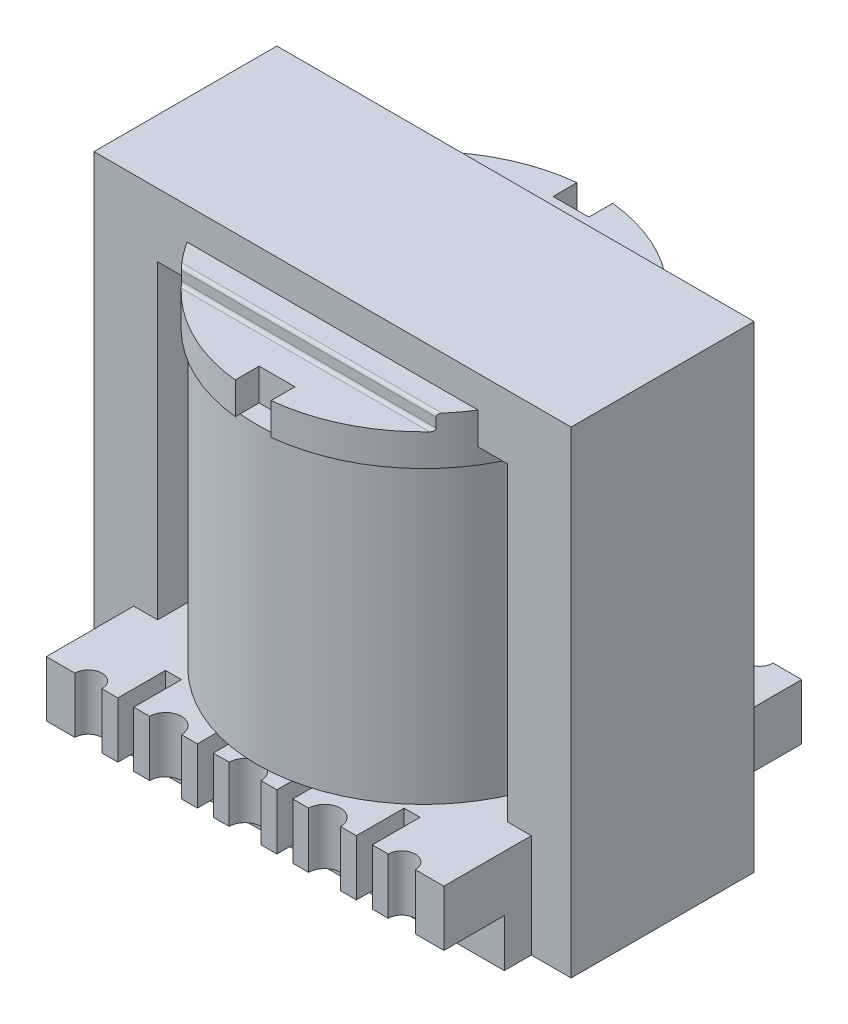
ISO-10303-21;
HEADER;
FILE_DESCRIPTION(('STEP AP214'),'2;1');
FILE_NAME('part.step','',(''),(''),'','','');
FILE_SCHEMA(('AUTOMOTIVE_DESIGN { 1 0 10303 214 1 1 1 1 }'));
ENDSEC;
DATA;
#1=APPLICATION_CONTEXT('core data for automotive mechanical design processes');
#2=APPLICATION_PROTOCOL_DEFINITION('international standard','automotive_design',2000,#1);
#3=PRODUCT_CONTEXT('',#1,'mechanical');
#4=PRODUCT('Part','Part','',(#3));
#5=PRODUCT_RELATED_PRODUCT_CATEGORY('part','',(#4));
#6=PRODUCT_DEFINITION_FORMATION('','',#4);
#7=PRODUCT_DEFINITION_CONTEXT('part definition',#1,'design');
#8=PRODUCT_DEFINITION('design','',#6,#7);
#9=PRODUCT_DEFINITION_SHAPE('','',#8);
#10=(LENGTH_UNIT() NAMED_UNIT(*) SI_UNIT(.MILLI.,.METRE.));
#11=(NAMED_UNIT(*) PLANE_ANGLE_UNIT() SI_UNIT($,.RADIAN.));
#12=(NAMED_UNIT(*) SI_UNIT($,.STERADIAN.) SOLID_ANGLE_UNIT());
#13=UNCERTAINTY_MEASURE_WITH_UNIT(LENGTH_MEASURE(1.E-05),#10,'distance_accuracy_value','');
#14=(GEOMETRIC_REPRESENTATION_CONTEXT(3) GLOBAL_UNCERTAINTY_ASSIGNED_CONTEXT((#13)) GLOBAL_UNIT_ASSIGNED_CONTEXT((#10,
#11,#12)) REPRESENTATION_CONTEXT('',''));
#15=CARTESIAN_POINT('',(0.,0.,0.));
#16=DIRECTION('',(0.,0.,1.));
#17=DIRECTION('',(1.,0.,0.));
#18=AXIS2_PLACEMENT_3D('',#15,#16,#17);
#19=CARTESIAN_POINT('',(0.,55.698484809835,0.));
#20=DIRECTION('',(0.,-1.,0.));
#21=DIRECTION('',(0.,0.,-1.));
#22=AXIS2_PLACEMENT_3D('',#19,#20,#21);
#23=CYLINDRICAL_SURFACE('',#22,10.5);
#24=CARTESIAN_POINT('',(0.,6.5,0.));
#25=DIRECTION('',(0.,1.,0.));
#26=DIRECTION('',(0.,0.,1.));
#27=AXIS2_PLACEMENT_3D('',#24,#25,#26);
#28=CIRCLE('',#27,10.5);
#29=CARTESIAN_POINT('',(0.,6.5,10.5));
#30=VERTEX_POINT('',#29);
#31=EDGE_CURVE('P0_E19',#30,#30,#28,.T.);
#32=ORIENTED_EDGE('',*,*,#31,.T.);
#33=EDGE_LOOP('',(#32));
#34=FACE_BOUND('',#33,.T.);
#35=CARTESIAN_POINT('',(0.,25.,0.));
#36=DIRECTION('',(0.,-1.,0.));
#37=DIRECTION('',(0.,0.,-1.));
#38=AXIS2_PLACEMENT_3D('',#35,#36,#37);
#39=CIRCLE('',#38,10.5);
#40=CARTESIAN_POINT('',(0.,25.,-10.5));
#41=VERTEX_POINT('',#40);
#42=EDGE_CURVE('P0_E10',#41,#41,#39,.T.);
#43=ORIENTED_EDGE('',*,*,#42,.T.);
#44=EDGE_LOOP('',(#43));
#45=FACE_BOUND('',#44,.T.);
#46=ADVANCED_FACE('P0_F15',(#34,#45),#23,.T.);
#47=CARTESIAN_POINT('',(0.,6.5,0.));
#48=DIRECTION('',(0.,1.,0.));
#49=DIRECTION('',(0.,0.,1.));
#50=AXIS2_PLACEMENT_3D('',#47,#48,#49);
#51=PLANE('',#50);
#52=ORIENTED_EDGE('',*,*,#31,.F.);
#53=EDGE_LOOP('',(#52));
#54=FACE_BOUND('',#53,.T.);
#55=ADVANCED_FACE('P0_F29',(#54),#51,.F.);
#56=CARTESIAN_POINT('',(-11.,25.,5.75));
#57=DIRECTION('',(0.,-1.,0.));
#58=DIRECTION('',(0.,0.,-1.));
#59=AXIS2_PLACEMENT_3D('',#56,#57,#58);
#60=PLANE('',#59);
#61=ORIENTED_EDGE('',*,*,#42,.F.);
#62=EDGE_LOOP('',(#61));
#63=FACE_BOUND('',#62,.T.);
#64=ADVANCED_FACE('P0_F17',(#63),#60,.F.);
#65=CLOSED_SHELL('',(#46,#55,#64));
#66=MANIFOLD_SOLID_BREP('P0_B1',#65);
#67=CARTESIAN_POINT('',(9.85,32.0978514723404,11.25));
#68=DIRECTION('',(0.,-1.,0.));
#69=DIRECTION('',(0.,0.,-1.));
#70=AXIS2_PLACEMENT_3D('',#67,#68,#69);
#71=CYLINDRICAL_SURFACE('',#70,0.85);
#72=CARTESIAN_POINT('',(9.85,6.5,11.25));
#73=DIRECTION('',(0.,-1.,0.));
#74=DIRECTION('',(0.,0.,1.));
#75=AXIS2_PLACEMENT_3D('',#72,#73,#74);
#76=CIRCLE('',#75,0.85);
#77=CARTESIAN_POINT('',(9.,6.5,11.25));
#78=VERTEX_POINT('',#77);
#79=CARTESIAN_POINT('',(10.7,6.5,11.25));
#80=VERTEX_POINT('',#79);
#81=EDGE_CURVE('P1_E627',#78,#80,#76,.T.);
#82=ORIENTED_EDGE('',*,*,#81,.F.);
#83=DIRECTION('',(0.,-1.,0.));
#84=VECTOR('',#83,1.);
#85=CARTESIAN_POINT('',(9.,32.0978514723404,11.25));
#86=LINE('',#85,#84);
#87=CARTESIAN_POINT('',(9.,3.,11.25));
#88=VERTEX_POINT('',#87);
#89=EDGE_CURVE('P1_E497',#78,#88,#86,.T.);
#90=ORIENTED_EDGE('',*,*,#89,.T.);
#91=CARTESIAN_POINT('',(9.85,3.,11.25));
#92=DIRECTION('',(0.,-1.,0.));
#93=DIRECTION('',(0.,0.,1.));
#94=AXIS2_PLACEMENT_3D('',#91,#92,#93);
#95=CIRCLE('',#94,0.85);
#96=CARTESIAN_POINT('',(10.7,3.,11.25));
#97=VERTEX_POINT('',#96);
#98=EDGE_CURVE('P1_E11',#88,#97,#95,.T.);
#99=ORIENTED_EDGE('',*,*,#98,.T.);
#100=DIRECTION('',(0.,-1.,0.));
#101=VECTOR('',#100,1.);
#102=CARTESIAN_POINT('',(10.7,32.0978514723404,11.25));
#103=LINE('',#102,#101);
#104=EDGE_CURVE('P1_E36',#80,#97,#103,.T.);
#105=ORIENTED_EDGE('',*,*,#104,.F.);
#106=EDGE_LOOP('',(#82,#90,#99,#105));
#107=FACE_BOUND('',#106,.T.);
#108=ADVANCED_FACE('P1_F17',(#107),#71,.F.);
#109=CARTESIAN_POINT('',(5.,32.0978514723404,11.25));
#110=DIRECTION('',(0.,-1.,0.));
#111=DIRECTION('',(0.,0.,-1.));
#112=AXIS2_PLACEMENT_3D('',#109,#110,#111);
#113=CYLINDRICAL_SURFACE('',#112,1.);
#114=CARTESIAN_POINT('',(5.,6.5,11.25));
#115=DIRECTION('',(0.,-1.,0.));
#116=DIRECTION('',(0.,0.,1.));
#117=AXIS2_PLACEMENT_3D('',#114,#115,#116);
#118=CIRCLE('',#117,1.);
#119=CARTESIAN_POINT('',(4.,6.5,11.25));
#120=VERTEX_POINT('',#119);
#121=CARTESIAN_POINT('',(6.,6.5,11.25));
#122=VERTEX_POINT('',#121);
#123=EDGE_CURVE('P1_E643',#120,#122,#118,.T.);
#124=ORIENTED_EDGE('',*,*,#123,.F.);
#125=DIRECTION('',(0.,-1.,0.));
#126=VECTOR('',#125,1.);
#127=CARTESIAN_POINT('',(4.,32.0978514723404,11.25));
#128=LINE('',#127,#126);
#129=CARTESIAN_POINT('',(4.,3.,11.25));
#130=VERTEX_POINT('',#129);
#131=EDGE_CURVE('P1_E525',#120,#130,#128,.T.);
#132=ORIENTED_EDGE('',*,*,#131,.T.);
#133=CARTESIAN_POINT('',(5.,3.,11.25));
#134=DIRECTION('',(0.,-1.,0.));
#135=DIRECTION('',(0.,0.,1.));
#136=AXIS2_PLACEMENT_3D('',#133,#134,#135);
#137=CIRCLE('',#136,1.);
#138=CARTESIAN_POINT('',(6.,3.,11.25));
#139=VERTEX_POINT('',#138);
#140=EDGE_CURVE('P1_E27',#130,#139,#137,.T.);
#141=ORIENTED_EDGE('',*,*,#140,.T.);
#142=DIRECTION('',(0.,-1.,0.));
#143=VECTOR('',#142,1.);
#144=CARTESIAN_POINT('',(6.,32.0978514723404,11.25));
#145=LINE('',#144,#143);
#146=EDGE_CURVE('P1_E521',#122,#139,#145,.T.);
#147=ORIENTED_EDGE('',*,*,#146,.F.);
#148=EDGE_LOOP('',(#124,#132,#141,#147));
#149=FACE_BOUND('',#148,.T.);
#150=ADVANCED_FACE('P1_F1077',(#149),#113,.F.);
#151=CARTESIAN_POINT('',(0.,32.0978514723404,11.25));
#152=DIRECTION('',(0.,-1.,0.));
#153=DIRECTION('',(0.,0.,-1.));
#154=AXIS2_PLACEMENT_3D('',#151,#152,#153);
#155=CYLINDRICAL_SURFACE('',#154,1.);
#156=CARTESIAN_POINT('',(0.,6.5,11.25));
#157=DIRECTION('',(0.,-1.,0.));
#158=DIRECTION('',(0.,0.,1.));
#159=AXIS2_PLACEMENT_3D('',#156,#157,#158);
#160=CIRCLE('',#159,1.);
#161=CARTESIAN_POINT('',(-0.999999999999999,6.5,11.25));
#162=VERTEX_POINT('',#161);
#163=CARTESIAN_POINT('',(1.,6.5,11.25));
#164=VERTEX_POINT('',#163);
#165=EDGE_CURVE('P1_E659',#162,#164,#160,.T.);
#166=ORIENTED_EDGE('',*,*,#165,.F.);
#167=DIRECTION('',(0.,-1.,0.));
#168=VECTOR('',#167,1.);
#169=CARTESIAN_POINT('',(-0.999999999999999,32.0978514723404,11.25));
#170=LINE('',#169,#168);
#171=CARTESIAN_POINT('',(-0.999999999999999,3.,11.25));
#172=VERTEX_POINT('',#171);
#173=EDGE_CURVE('P1_E553',#162,#172,#170,.T.);
#174=ORIENTED_EDGE('',*,*,#173,.T.);
#175=CARTESIAN_POINT('',(0.,3.,11.25));
#176=DIRECTION('',(0.,-1.,0.));
#177=DIRECTION('',(0.,0.,1.));
#178=AXIS2_PLACEMENT_3D('',#175,#176,#177);
#179=CIRCLE('',#178,1.);
#180=CARTESIAN_POINT('',(1.,3.,11.25));
#181=VERTEX_POINT('',#180);
#182=EDGE_CURVE('P1_E1044',#172,#181,#179,.T.);
#183=ORIENTED_EDGE('',*,*,#182,.T.);
#184=DIRECTION('',(0.,-1.,0.));
#185=VECTOR('',#184,1.);
#186=CARTESIAN_POINT('',(1.,32.0978514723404,11.25));
#187=LINE('',#186,#185);
#188=EDGE_CURVE('P1_E549',#164,#181,#187,.T.);
#189=ORIENTED_EDGE('',*,*,#188,.F.);
#190=EDGE_LOOP('',(#166,#174,#183,#189));
#191=FACE_BOUND('',#190,.T.);
#192=ADVANCED_FACE('P1_F1082',(#191),#155,.F.);
#193=CARTESIAN_POINT('',(-5.,32.0978514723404,11.25));
#194=DIRECTION('',(0.,-1.,0.));
#195=DIRECTION('',(0.,0.,-1.));
#196=AXIS2_PLACEMENT_3D('',#193,#194,#195);
#197=CYLINDRICAL_SURFACE('',#196,1.);
#198=CARTESIAN_POINT('',(-5.,6.5,11.25));
#199=DIRECTION('',(0.,-1.,0.));
#200=DIRECTION('',(0.,0.,1.));
#201=AXIS2_PLACEMENT_3D('',#198,#199,#200);
#202=CIRCLE('',#201,1.);
#203=CARTESIAN_POINT('',(-6.,6.5,11.25));
#204=VERTEX_POINT('',#203);
#205=CARTESIAN_POINT('',(-4.,6.5,11.25));
#206=VERTEX_POINT('',#205);
#207=EDGE_CURVE('P1_E675',#204,#206,#202,.T.);
#208=ORIENTED_EDGE('',*,*,#207,.F.);
#209=DIRECTION('',(0.,-1.,0.));
#210=VECTOR('',#209,1.);
#211=CARTESIAN_POINT('',(-6.,32.0978514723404,11.25));
#212=LINE('',#211,#210);
#213=CARTESIAN_POINT('',(-6.,3.,11.25));
#214=VERTEX_POINT('',#213);
#215=EDGE_CURVE('P1_E581',#204,#214,#212,.T.);
#216=ORIENTED_EDGE('',*,*,#215,.T.);
#217=CARTESIAN_POINT('',(-5.,3.,11.25));
#218=DIRECTION('',(0.,-1.,0.));
#219=DIRECTION('',(0.,0.,1.));
#220=AXIS2_PLACEMENT_3D('',#217,#218,#219);
#221=CIRCLE('',#220,1.);
#222=CARTESIAN_POINT('',(-4.,3.,11.25));
#223=VERTEX_POINT('',#222);
#224=EDGE_CURVE('P1_E1038',#214,#223,#221,.T.);
#225=ORIENTED_EDGE('',*,*,#224,.T.);
#226=DIRECTION('',(0.,-1.,0.));
#227=VECTOR('',#226,1.);
#228=CARTESIAN_POINT('',(-4.,32.0978514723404,11.25));
#229=LINE('',#228,#227);
#230=EDGE_CURVE('P1_E577',#206,#223,#229,.T.);
#231=ORIENTED_EDGE('',*,*,#230,.F.);
#232=EDGE_LOOP('',(#208,#216,#225,#231));
#233=FACE_BOUND('',#232,.T.);
#234=ADVANCED_FACE('P1_F1088',(#233),#197,.F.);
#235=CARTESIAN_POINT('',(-9.85,32.0978514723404,11.25));
#236=DIRECTION('',(0.,-1.,0.));
#237=DIRECTION('',(0.,0.,-1.));
#238=AXIS2_PLACEMENT_3D('',#235,#236,#237);
#239=CYLINDRICAL_SURFACE('',#238,0.85);
#240=CARTESIAN_POINT('',(-9.85,6.5,11.25));
#241=DIRECTION('',(0.,-1.,0.));
#242=DIRECTION('',(0.,0.,1.));
#243=AXIS2_PLACEMENT_3D('',#240,#241,#242);
#244=CIRCLE('',#243,0.85);
#245=CARTESIAN_POINT('',(-10.7,6.5,11.25));
#246=VERTEX_POINT('',#245);
#247=CARTESIAN_POINT('',(-9.,6.5,11.25));
#248=VERTEX_POINT('',#247);
#249=EDGE_CURVE('P1_E691',#246,#248,#244,.T.);
#250=ORIENTED_EDGE('',*,*,#249,.F.);
#251=DIRECTION('',(0.,-1.,0.));
#252=VECTOR('',#251,1.);
#253=CARTESIAN_POINT('',(-10.7,32.0978514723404,11.25));
#254=LINE('',#253,#252);
#255=CARTESIAN_POINT('',(-10.7,3.,11.25));
#256=VERTEX_POINT('',#255);
#257=EDGE_CURVE('P1_E609',#246,#256,#254,.T.);
#258=ORIENTED_EDGE('',*,*,#257,.T.);
#259=CARTESIAN_POINT('',(-9.85,3.,11.25));
#260=DIRECTION('',(0.,-1.,0.));
#261=DIRECTION('',(0.,0.,1.));
#262=AXIS2_PLACEMENT_3D('',#259,#260,#261);
#263=CIRCLE('',#262,0.85);
#264=CARTESIAN_POINT('',(-9.,3.,11.25));
#265=VERTEX_POINT('',#264);
#266=EDGE_CURVE('P1_E1034',#256,#265,#263,.T.);
#267=ORIENTED_EDGE('',*,*,#266,.T.);
#268=DIRECTION('',(0.,-1.,0.));
#269=VECTOR('',#268,1.);
#270=CARTESIAN_POINT('',(-9.,32.0978514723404,11.25));
#271=LINE('',#270,#269);
#272=EDGE_CURVE('P1_E605',#248,#265,#271,.T.);
#273=ORIENTED_EDGE('',*,*,#272,.F.);
#274=EDGE_LOOP('',(#250,#258,#267,#273));
#275=FACE_BOUND('',#274,.T.);
#276=ADVANCED_FACE('P1_F1092',(#275),#239,.F.);
#277=CARTESIAN_POINT('',(-12.5,32.0978514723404,-11.25));
#278=DIRECTION('',(0.,0.,-1.));
#279=DIRECTION('',(-1.,0.,0.));
#280=AXIS2_PLACEMENT_3D('',#277,#278,#279);
#281=PLANE('',#280);
#282=DIRECTION('',(0.,-1.,0.));
#283=VECTOR('',#282,1.);
#284=CARTESIAN_POINT('',(-10.7,32.0978514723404,-11.25));
#285=LINE('',#284,#283);
#286=CARTESIAN_POINT('',(-10.7,6.5,-11.25));
#287=VERTEX_POINT('',#286);
#288=CARTESIAN_POINT('',(-10.7,3.,-11.25));
#289=VERTEX_POINT('',#288);
#290=EDGE_CURVE('P1_E1031',#287,#289,#285,.T.);
#291=ORIENTED_EDGE('',*,*,#290,.T.);
#292=DIRECTION('',(-1.,0.,0.));
#293=VECTOR('',#292,1.);
#294=CARTESIAN_POINT('',(-12.5,3.,-11.25));
#295=LINE('',#294,#293);
#296=CARTESIAN_POINT('',(-12.5,3.,-11.25));
#297=VERTEX_POINT('',#296);
#298=EDGE_CURVE('P1_E1027',#289,#297,#295,.T.);
#299=ORIENTED_EDGE('',*,*,#298,.T.);
#300=DIRECTION('',(0.,-1.,0.));
#301=VECTOR('',#300,1.);
#302=CARTESIAN_POINT('',(-12.5,32.0978514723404,-11.25));
#303=LINE('',#302,#301);
#304=CARTESIAN_POINT('',(-12.5,6.5,-11.25));
#305=VERTEX_POINT('',#304);
#306=EDGE_CURVE('P1_E801',#305,#297,#303,.T.);
#307=ORIENTED_EDGE('',*,*,#306,.F.);
#308=DIRECTION('',(1.,0.,0.));
#309=VECTOR('',#308,1.);
#310=CARTESIAN_POINT('',(-12.5,6.5,-11.25));
#311=LINE('',#310,#309);
#312=EDGE_CURVE('P1_E1025',#305,#287,#311,.T.);
#313=ORIENTED_EDGE('',*,*,#312,.T.);
#314=EDGE_LOOP('',(#291,#299,#307,#313));
#315=FACE_BOUND('',#314,.T.);
#316=ADVANCED_FACE('P1_F1096',(#315),#281,.T.);
#317=CARTESIAN_POINT('',(-9.85,32.0978514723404,-11.25));
#318=DIRECTION('',(0.,-1.,0.));
#319=DIRECTION('',(0.,0.,-1.));
#320=AXIS2_PLACEMENT_3D('',#317,#318,#319);
#321=CYLINDRICAL_SURFACE('',#320,0.85);
#322=DIRECTION('',(0.,-1.,0.));
#323=VECTOR('',#322,1.);
#324=CARTESIAN_POINT('',(-9.,32.0978514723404,-11.25));
#325=LINE('',#324,#323);
#326=CARTESIAN_POINT('',(-9.,6.5,-11.25));
#327=VERTEX_POINT('',#326);
#328=CARTESIAN_POINT('',(-9.,3.,-11.25));
#329=VERTEX_POINT('',#328);
#330=EDGE_CURVE('P1_E1022',#327,#329,#325,.T.);
#331=ORIENTED_EDGE('',*,*,#330,.T.);
#332=CARTESIAN_POINT('',(-9.85,3.,-11.25));
#333=DIRECTION('',(0.,-1.,0.));
#334=DIRECTION('',(0.,0.,-1.));
#335=AXIS2_PLACEMENT_3D('',#332,#333,#334);
#336=CIRCLE('',#335,0.85);
#337=EDGE_CURVE('P1_E1019',#329,#289,#336,.T.);
#338=ORIENTED_EDGE('',*,*,#337,.T.);
#339=ORIENTED_EDGE('',*,*,#290,.F.);
#340=CARTESIAN_POINT('',(-9.85,6.5,-11.25));
#341=DIRECTION('',(0.,1.,0.));
#342=DIRECTION('',(0.,0.,1.));
#343=AXIS2_PLACEMENT_3D('',#340,#341,#342);
#344=CIRCLE('',#343,0.85);
#345=EDGE_CURVE('P1_E1017',#287,#327,#344,.T.);
#346=ORIENTED_EDGE('',*,*,#345,.T.);
#347=EDGE_LOOP('',(#331,#338,#339,#346));
#348=FACE_BOUND('',#347,.T.);
#349=ADVANCED_FACE('P1_F1100',(#348),#321,.F.);
#350=CARTESIAN_POINT('',(-8.,32.0978514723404,-11.25));
#351=DIRECTION('',(0.,0.,-1.));
#352=DIRECTION('',(-1.,0.,0.));
#353=AXIS2_PLACEMENT_3D('',#350,#351,#352);
#354=PLANE('',#353);
#355=DIRECTION('',(0.,-1.,0.));
#356=VECTOR('',#355,1.);
#357=CARTESIAN_POINT('',(-8.,32.0978514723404,-11.25));
#358=LINE('',#357,#356);
#359=CARTESIAN_POINT('',(-8.,6.5,-11.25));
#360=VERTEX_POINT('',#359);
#361=CARTESIAN_POINT('',(-8.,3.,-11.25));
#362=VERTEX_POINT('',#361);
#363=EDGE_CURVE('P1_E1014',#360,#362,#358,.T.);
#364=ORIENTED_EDGE('',*,*,#363,.T.);
#365=DIRECTION('',(-1.,0.,0.));
#366=VECTOR('',#365,1.);
#367=CARTESIAN_POINT('',(-12.5,3.,-11.25));
#368=LINE('',#367,#366);
#369=EDGE_CURVE('P1_E1011',#362,#329,#368,.T.);
#370=ORIENTED_EDGE('',*,*,#369,.T.);
#371=ORIENTED_EDGE('',*,*,#330,.F.);
#372=DIRECTION('',(1.,0.,0.));
#373=VECTOR('',#372,1.);
#374=CARTESIAN_POINT('',(-8.,6.5,-11.25));
#375=LINE('',#374,#373);
#376=EDGE_CURVE('P1_E1009',#327,#360,#375,.T.);
#377=ORIENTED_EDGE('',*,*,#376,.T.);
#378=EDGE_LOOP('',(#364,#370,#371,#377));
#379=FACE_BOUND('',#378,.T.);
#380=ADVANCED_FACE('P1_F1104',(#379),#354,.T.);
#381=CARTESIAN_POINT('',(-8.,32.0978514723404,-8.25));
#382=DIRECTION('',(1.,0.,0.));
#383=DIRECTION('',(0.,0.,-1.));
#384=AXIS2_PLACEMENT_3D('',#381,#382,#383);
#385=PLANE('',#384);
#386=DIRECTION('',(0.,-1.,0.));
#387=VECTOR('',#386,1.);
#388=CARTESIAN_POINT('',(-8.,32.0978514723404,-8.25));
#389=LINE('',#388,#387);
#390=CARTESIAN_POINT('',(-8.,6.5,-8.25));
#391=VERTEX_POINT('',#390);
#392=CARTESIAN_POINT('',(-8.,3.,-8.25));
#393=VERTEX_POINT('',#392);
#394=EDGE_CURVE('P1_E1006',#391,#393,#389,.T.);
#395=ORIENTED_EDGE('',*,*,#394,.T.);
#396=DIRECTION('',(0.,0.,-1.));
#397=VECTOR('',#396,1.);
#398=CARTESIAN_POINT('',(-8.,3.,-8.25));
#399=LINE('',#398,#397);
#400=EDGE_CURVE('P1_E1003',#393,#362,#399,.T.);
#401=ORIENTED_EDGE('',*,*,#400,.T.);
#402=ORIENTED_EDGE('',*,*,#363,.F.);
#403=DIRECTION('',(0.,0.,1.));
#404=VECTOR('',#403,1.);
#405=CARTESIAN_POINT('',(-8.,6.5,-8.25));
#406=LINE('',#405,#404);
#407=EDGE_CURVE('P1_E1001',#360,#391,#406,.T.);
#408=ORIENTED_EDGE('',*,*,#407,.T.);
#409=EDGE_LOOP('',(#395,#401,#402,#408));
#410=FACE_BOUND('',#409,.T.);
#411=ADVANCED_FACE('P1_F1108',(#410),#385,.T.);
#412=CARTESIAN_POINT('',(-8.,32.0978514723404,-8.25));
#413=DIRECTION('',(0.,0.,-1.));
#414=DIRECTION('',(-1.,0.,0.));
#415=AXIS2_PLACEMENT_3D('',#412,#413,#414);
#416=PLANE('',#415);
#417=DIRECTION('',(0.,-1.,0.));
#418=VECTOR('',#417,1.);
#419=CARTESIAN_POINT('',(-7.,32.0978514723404,-8.25));
#420=LINE('',#419,#418);
#421=CARTESIAN_POINT('',(-7.,6.5,-8.25));
#422=VERTEX_POINT('',#421);
#423=CARTESIAN_POINT('',(-7.,3.,-8.25));
#424=VERTEX_POINT('',#423);
#425=EDGE_CURVE('P1_E998',#422,#424,#420,.T.);
#426=ORIENTED_EDGE('',*,*,#425,.T.);
#427=DIRECTION('',(-1.,0.,0.));
#428=VECTOR('',#427,1.);
#429=CARTESIAN_POINT('',(-8.,3.,-8.25));
#430=LINE('',#429,#428);
#431=EDGE_CURVE('P1_E995',#424,#393,#430,.T.);
#432=ORIENTED_EDGE('',*,*,#431,.T.);
#433=ORIENTED_EDGE('',*,*,#394,.F.);
#434=DIRECTION('',(1.,0.,0.));
#435=VECTOR('',#434,1.);
#436=CARTESIAN_POINT('',(-8.,6.5,-8.25));
#437=LINE('',#436,#435);
#438=EDGE_CURVE('P1_E993',#391,#422,#437,.T.);
#439=ORIENTED_EDGE('',*,*,#438,.T.);
#440=EDGE_LOOP('',(#426,#432,#433,#439));
#441=FACE_BOUND('',#440,.T.);
#442=ADVANCED_FACE('P1_F1112',(#441),#416,.T.);
#443=CARTESIAN_POINT('',(-7.,32.0978514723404,-11.25));
#444=DIRECTION('',(-1.,0.,0.));
#445=DIRECTION('',(0.,0.,1.));
#446=AXIS2_PLACEMENT_3D('',#443,#444,#445);
#447=PLANE('',#446);
#448=DIRECTION('',(0.,-1.,0.));
#449=VECTOR('',#448,1.);
#450=CARTESIAN_POINT('',(-7.,32.0978514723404,-11.25));
#451=LINE('',#450,#449);
#452=CARTESIAN_POINT('',(-7.,6.5,-11.25));
#453=VERTEX_POINT('',#452);
#454=CARTESIAN_POINT('',(-7.,3.,-11.25));
#455=VERTEX_POINT('',#454);
#456=EDGE_CURVE('P1_E990',#453,#455,#451,.T.);
#457=ORIENTED_EDGE('',*,*,#456,.T.);
#458=DIRECTION('',(0.,0.,1.));
#459=VECTOR('',#458,1.);
#460=CARTESIAN_POINT('',(-7.,3.,-11.25));
#461=LINE('',#460,#459);
#462=EDGE_CURVE('P1_E987',#455,#424,#461,.T.);
#463=ORIENTED_EDGE('',*,*,#462,.T.);
#464=ORIENTED_EDGE('',*,*,#425,.F.);
#465=DIRECTION('',(0.,0.,-1.));
#466=VECTOR('',#465,1.);
#467=CARTESIAN_POINT('',(-7.,6.5,-11.25));
#468=LINE('',#467,#466);
#469=EDGE_CURVE('P1_E985',#422,#453,#468,.T.);
#470=ORIENTED_EDGE('',*,*,#469,.T.);
#471=EDGE_LOOP('',(#457,#463,#464,#470));
#472=FACE_BOUND('',#471,.T.);
#473=ADVANCED_FACE('P1_F1116',(#472),#447,.T.);
#474=CARTESIAN_POINT('',(-7.,32.0978514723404,-11.25));
#475=DIRECTION('',(0.,0.,-1.));
#476=DIRECTION('',(-1.,0.,0.));
#477=AXIS2_PLACEMENT_3D('',#474,#475,#476);
#478=PLANE('',#477);
#479=DIRECTION('',(0.,-1.,0.));
#480=VECTOR('',#479,1.);
#481=CARTESIAN_POINT('',(-6.,32.0978514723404,-11.25));
#482=LINE('',#481,#480);
#483=CARTESIAN_POINT('',(-6.,6.5,-11.25));
#484=VERTEX_POINT('',#483);
#485=CARTESIAN_POINT('',(-6.,3.,-11.25));
#486=VERTEX_POINT('',#485);
#487=EDGE_CURVE('P1_E982',#484,#486,#482,.T.);
#488=ORIENTED_EDGE('',*,*,#487,.T.);
#489=DIRECTION('',(-1.,0.,0.));
#490=VECTOR('',#489,1.);
#491=CARTESIAN_POINT('',(-12.5,3.,-11.25));
#492=LINE('',#491,#490);
#493=EDGE_CURVE('P1_E979',#486,#455,#492,.T.);
#494=ORIENTED_EDGE('',*,*,#493,.T.);
#495=ORIENTED_EDGE('',*,*,#456,.F.);
#496=DIRECTION('',(1.,0.,0.));
#497=VECTOR('',#496,1.);
#498=CARTESIAN_POINT('',(-7.,6.5,-11.25));
#499=LINE('',#498,#497);
#500=EDGE_CURVE('P1_E977',#453,#484,#499,.T.);
#501=ORIENTED_EDGE('',*,*,#500,.T.);
#502=EDGE_LOOP('',(#488,#494,#495,#501));
#503=FACE_BOUND('',#502,.T.);
#504=ADVANCED_FACE('P1_F1120',(#503),#478,.T.);
#505=CARTESIAN_POINT('',(-5.,32.0978514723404,-11.25));
#506=DIRECTION('',(0.,-1.,0.));
#507=DIRECTION('',(0.,0.,-1.));
#508=AXIS2_PLACEMENT_3D('',#505,#506,#507);
#509=CYLINDRICAL_SURFACE('',#508,1.);
#510=DIRECTION('',(0.,-1.,0.));
#511=VECTOR('',#510,1.);
#512=CARTESIAN_POINT('',(-4.,32.0978514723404,-11.25));
#513=LINE('',#512,#511);
#514=CARTESIAN_POINT('',(-4.,6.5,-11.25));
#515=VERTEX_POINT('',#514);
#516=CARTESIAN_POINT('',(-4.,3.,-11.25));
#517=VERTEX_POINT('',#516);
#518=EDGE_CURVE('P1_E974',#515,#517,#513,.T.);
#519=ORIENTED_EDGE('',*,*,#518,.T.);
#520=CARTESIAN_POINT('',(-5.,3.,-11.25));
#521=DIRECTION('',(0.,-1.,0.));
#522=DIRECTION('',(0.,0.,-1.));
#523=AXIS2_PLACEMENT_3D('',#520,#521,#522);
#524=CIRCLE('',#523,1.);
#525=EDGE_CURVE('P1_E971',#517,#486,#524,.T.);
#526=ORIENTED_EDGE('',*,*,#525,.T.);
#527=ORIENTED_EDGE('',*,*,#487,.F.);
#528=CARTESIAN_POINT('',(-5.,6.5,-11.25));
#529=DIRECTION('',(0.,1.,0.));
#530=DIRECTION('',(0.,0.,1.));
#531=AXIS2_PLACEMENT_3D('',#528,#529,#530);
#532=CIRCLE('',#531,1.);
#533=EDGE_CURVE('P1_E969',#484,#515,#532,.T.);
#534=ORIENTED_EDGE('',*,*,#533,.T.);
#535=EDGE_LOOP('',(#519,#526,#527,#534));
#536=FACE_BOUND('',#535,.T.);
#537=ADVANCED_FACE('P1_F1124',(#536),#509,.F.);
#538=CARTESIAN_POINT('',(-4.,32.0978514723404,-11.25));
#539=DIRECTION('',(0.,0.,-1.));
#540=DIRECTION('',(-1.,0.,0.));
#541=AXIS2_PLACEMENT_3D('',#538,#539,#540);
#542=PLANE('',#541);
#543=DIRECTION('',(0.,-1.,0.));
#544=VECTOR('',#543,1.);
#545=CARTESIAN_POINT('',(-3.,32.0978514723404,-11.25));
#546=LINE('',#545,#544);
#547=CARTESIAN_POINT('',(-3.,6.5,-11.25));
#548=VERTEX_POINT('',#547);
#549=CARTESIAN_POINT('',(-3.,3.,-11.25));
#550=VERTEX_POINT('',#549);
#551=EDGE_CURVE('P1_E966',#548,#550,#546,.T.);
#552=ORIENTED_EDGE('',*,*,#551,.T.);
#553=DIRECTION('',(-1.,0.,0.));
#554=VECTOR('',#553,1.);
#555=CARTESIAN_POINT('',(-12.5,3.,-11.25));
#556=LINE('',#555,#554);
#557=EDGE_CURVE('P1_E963',#550,#517,#556,.T.);
#558=ORIENTED_EDGE('',*,*,#557,.T.);
#559=ORIENTED_EDGE('',*,*,#518,.F.);
#560=DIRECTION('',(1.,0.,0.));
#561=VECTOR('',#560,1.);
#562=CARTESIAN_POINT('',(-4.,6.5,-11.25));
#563=LINE('',#562,#561);
#564=EDGE_CURVE('P1_E961',#515,#548,#563,.T.);
#565=ORIENTED_EDGE('',*,*,#564,.T.);
#566=EDGE_LOOP('',(#552,#558,#559,#565));
#567=FACE_BOUND('',#566,.T.);
#568=ADVANCED_FACE('P1_F1128',(#567),#542,.T.);
#569=CARTESIAN_POINT('',(-3.,32.0978514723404,-11.25));
#570=DIRECTION('',(1.,0.,0.));
#571=DIRECTION('',(0.,0.,-1.));
#572=AXIS2_PLACEMENT_3D('',#569,#570,#571);
#573=PLANE('',#572);
#574=DIRECTION('',(0.,-1.,0.));
#575=VECTOR('',#574,1.);
#576=CARTESIAN_POINT('',(-3.,32.0978514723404,-8.25));
#577=LINE('',#576,#575);
#578=CARTESIAN_POINT('',(-3.,6.5,-8.25));
#579=VERTEX_POINT('',#578);
#580=CARTESIAN_POINT('',(-3.,3.,-8.25));
#581=VERTEX_POINT('',#580);
#582=EDGE_CURVE('P1_E958',#579,#581,#577,.T.);
#583=ORIENTED_EDGE('',*,*,#582,.T.);
#584=DIRECTION('',(0.,0.,-1.));
#585=VECTOR('',#584,1.);
#586=CARTESIAN_POINT('',(-3.,3.,-11.25));
#587=LINE('',#586,#585);
#588=EDGE_CURVE('P1_E955',#581,#550,#587,.T.);
#589=ORIENTED_EDGE('',*,*,#588,.T.);
#590=ORIENTED_EDGE('',*,*,#551,.F.);
#591=DIRECTION('',(0.,0.,1.));
#592=VECTOR('',#591,1.);
#593=CARTESIAN_POINT('',(-3.,6.5,-11.25));
#594=LINE('',#593,#592);
#595=EDGE_CURVE('P1_E953',#548,#579,#594,.T.);
#596=ORIENTED_EDGE('',*,*,#595,.T.);
#597=EDGE_LOOP('',(#583,#589,#590,#596));
#598=FACE_BOUND('',#597,.T.);
#599=ADVANCED_FACE('P1_F1132',(#598),#573,.T.);
#600=CARTESIAN_POINT('',(-2.,32.0978514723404,-8.25));
#601=DIRECTION('',(0.,0.,-1.));
#602=DIRECTION('',(-1.,0.,0.));
#603=AXIS2_PLACEMENT_3D('',#600,#601,#602);
#604=PLANE('',#603);
#605=DIRECTION('',(0.,-1.,0.));
#606=VECTOR('',#605,1.);
#607=CARTESIAN_POINT('',(-2.,32.0978514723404,-8.25));
#608=LINE('',#607,#606);
#609=CARTESIAN_POINT('',(-2.,6.5,-8.25));
#610=VERTEX_POINT('',#609);
#611=CARTESIAN_POINT('',(-2.,3.,-8.25));
#612=VERTEX_POINT('',#611);
#613=EDGE_CURVE('P1_E950',#610,#612,#608,.T.);
#614=ORIENTED_EDGE('',*,*,#613,.T.);
#615=DIRECTION('',(-1.,0.,0.));
#616=VECTOR('',#615,1.);
#617=CARTESIAN_POINT('',(-2.,3.,-8.25));
#618=LINE('',#617,#616);
#619=EDGE_CURVE('P1_E947',#612,#581,#618,.T.);
#620=ORIENTED_EDGE('',*,*,#619,.T.);
#621=ORIENTED_EDGE('',*,*,#582,.F.);
#622=DIRECTION('',(1.,0.,0.));
#623=VECTOR('',#622,1.);
#624=CARTESIAN_POINT('',(-2.,6.5,-8.25));
#625=LINE('',#624,#623);
#626=EDGE_CURVE('P1_E945',#579,#610,#625,.T.);
#627=ORIENTED_EDGE('',*,*,#626,.T.);
#628=EDGE_LOOP('',(#614,#620,#621,#627));
#629=FACE_BOUND('',#628,.T.);
#630=ADVANCED_FACE('P1_F1136',(#629),#604,.T.);
#631=CARTESIAN_POINT('',(-2.,32.0978514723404,-11.25));
#632=DIRECTION('',(-1.,0.,0.));
#633=DIRECTION('',(0.,0.,1.));
#634=AXIS2_PLACEMENT_3D('',#631,#632,#633);
#635=PLANE('',#634);
#636=DIRECTION('',(0.,-1.,0.));
#637=VECTOR('',#636,1.);
#638=CARTESIAN_POINT('',(-2.,32.0978514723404,-11.25));
#639=LINE('',#638,#637);
#640=CARTESIAN_POINT('',(-2.,6.5,-11.25));
#641=VERTEX_POINT('',#640);
#642=CARTESIAN_POINT('',(-2.,3.,-11.25));
#643=VERTEX_POINT('',#642);
#644=EDGE_CURVE('P1_E942',#641,#643,#639,.T.);
#645=ORIENTED_EDGE('',*,*,#644,.T.);
#646=DIRECTION('',(0.,0.,1.));
#647=VECTOR('',#646,1.);
#648=CARTESIAN_POINT('',(-2.,3.,-11.25));
#649=LINE('',#648,#647);
#650=EDGE_CURVE('P1_E939',#643,#612,#649,.T.);
#651=ORIENTED_EDGE('',*,*,#650,.T.);
#652=ORIENTED_EDGE('',*,*,#613,.F.);
#653=DIRECTION('',(0.,0.,-1.));
#654=VECTOR('',#653,1.);
#655=CARTESIAN_POINT('',(-2.,6.5,-11.25));
#656=LINE('',#655,#654);
#657=EDGE_CURVE('P1_E937',#610,#641,#656,.T.);
#658=ORIENTED_EDGE('',*,*,#657,.T.);
#659=EDGE_LOOP('',(#645,#651,#652,#658));
#660=FACE_BOUND('',#659,.T.);
#661=ADVANCED_FACE('P1_F1140',(#660),#635,.T.);
#662=CARTESIAN_POINT('',(-2.,32.0978514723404,-11.25));
#663=DIRECTION('',(0.,0.,-1.));
#664=DIRECTION('',(-1.,0.,0.));
#665=AXIS2_PLACEMENT_3D('',#662,#663,#664);
#666=PLANE('',#665);
#667=DIRECTION('',(0.,-1.,0.));
#668=VECTOR('',#667,1.);
#669=CARTESIAN_POINT('',(-0.999999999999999,32.0978514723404,-11.25));
#670=LINE('',#669,#668);
#671=CARTESIAN_POINT('',(-0.999999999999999,6.5,-11.25));
#672=VERTEX_POINT('',#671);
#673=CARTESIAN_POINT('',(-0.999999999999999,3.,-11.25));
#674=VERTEX_POINT('',#673);
#675=EDGE_CURVE('P1_E934',#672,#674,#670,.T.);
#676=ORIENTED_EDGE('',*,*,#675,.T.);
#677=DIRECTION('',(-1.,0.,0.));
#678=VECTOR('',#677,1.);
#679=CARTESIAN_POINT('',(-12.5,3.,-11.25));
#680=LINE('',#679,#678);
#681=EDGE_CURVE('P1_E931',#674,#643,#680,.T.);
#682=ORIENTED_EDGE('',*,*,#681,.T.);
#683=ORIENTED_EDGE('',*,*,#644,.F.);
#684=DIRECTION('',(1.,0.,0.));
#685=VECTOR('',#684,1.);
#686=CARTESIAN_POINT('',(-2.,6.5,-11.25));
#687=LINE('',#686,#685);
#688=EDGE_CURVE('P1_E929',#641,#672,#687,.T.);
#689=ORIENTED_EDGE('',*,*,#688,.T.);
#690=EDGE_LOOP('',(#676,#682,#683,#689));
#691=FACE_BOUND('',#690,.T.);
#692=ADVANCED_FACE('P1_F1144',(#691),#666,.T.);
#693=CARTESIAN_POINT('',(0.,32.0978514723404,-11.25));
#694=DIRECTION('',(0.,-1.,0.));
#695=DIRECTION('',(0.,0.,-1.));
#696=AXIS2_PLACEMENT_3D('',#693,#694,#695);
#697=CYLINDRICAL_SURFACE('',#696,1.);
#698=DIRECTION('',(0.,-1.,0.));
#699=VECTOR('',#698,1.);
#700=CARTESIAN_POINT('',(1.,32.0978514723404,-11.25));
#701=LINE('',#700,#699);
#702=CARTESIAN_POINT('',(1.,6.5,-11.25));
#703=VERTEX_POINT('',#702);
#704=CARTESIAN_POINT('',(1.,3.,-11.25));
#705=VERTEX_POINT('',#704);
#706=EDGE_CURVE('P1_E926',#703,#705,#701,.T.);
#707=ORIENTED_EDGE('',*,*,#706,.T.);
#708=CARTESIAN_POINT('',(0.,3.,-11.25));
#709=DIRECTION('',(0.,-1.,0.));
#710=DIRECTION('',(0.,0.,-1.));
#711=AXIS2_PLACEMENT_3D('',#708,#709,#710);
#712=CIRCLE('',#711,1.);
#713=EDGE_CURVE('P1_E923',#705,#674,#712,.T.);
#714=ORIENTED_EDGE('',*,*,#713,.T.);
#715=ORIENTED_EDGE('',*,*,#675,.F.);
#716=CARTESIAN_POINT('',(0.,6.5,-11.25));
#717=DIRECTION('',(0.,1.,0.));
#718=DIRECTION('',(0.,0.,1.));
#719=AXIS2_PLACEMENT_3D('',#716,#717,#718);
#720=CIRCLE('',#719,1.);
#721=EDGE_CURVE('P1_E921',#672,#703,#720,.T.);
#722=ORIENTED_EDGE('',*,*,#721,.T.);
#723=EDGE_LOOP('',(#707,#714,#715,#722));
#724=FACE_BOUND('',#723,.T.);
#725=ADVANCED_FACE('P1_F1148',(#724),#697,.F.);
#726=CARTESIAN_POINT('',(1.,32.0978514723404,-11.25));
#727=DIRECTION('',(0.,0.,-1.));
#728=DIRECTION('',(-1.,0.,0.));
#729=AXIS2_PLACEMENT_3D('',#726,#727,#728);
#730=PLANE('',#729);
#731=DIRECTION('',(0.,-1.,0.));
#732=VECTOR('',#731,1.);
#733=CARTESIAN_POINT('',(2.,32.0978514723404,-11.25));
#734=LINE('',#733,#732);
#735=CARTESIAN_POINT('',(2.,6.5,-11.25));
#736=VERTEX_POINT('',#735);
#737=CARTESIAN_POINT('',(2.,3.,-11.25));
#738=VERTEX_POINT('',#737);
#739=EDGE_CURVE('P1_E918',#736,#738,#734,.T.);
#740=ORIENTED_EDGE('',*,*,#739,.T.);
#741=DIRECTION('',(-1.,0.,0.));
#742=VECTOR('',#741,1.);
#743=CARTESIAN_POINT('',(-12.5,3.,-11.25));
#744=LINE('',#743,#742);
#745=EDGE_CURVE('P1_E915',#738,#705,#744,.T.);
#746=ORIENTED_EDGE('',*,*,#745,.T.);
#747=ORIENTED_EDGE('',*,*,#706,.F.);
#748=DIRECTION('',(1.,0.,0.));
#749=VECTOR('',#748,1.);
#750=CARTESIAN_POINT('',(1.,6.5,-11.25));
#751=LINE('',#750,#749);
#752=EDGE_CURVE('P1_E913',#703,#736,#751,.T.);
#753=ORIENTED_EDGE('',*,*,#752,.T.);
#754=EDGE_LOOP('',(#740,#746,#747,#753));
#755=FACE_BOUND('',#754,.T.);
#756=ADVANCED_FACE('P1_F1152',(#755),#730,.T.);
#757=CARTESIAN_POINT('',(2.,32.0978514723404,-11.25));
#758=DIRECTION('',(1.,0.,0.));
#759=DIRECTION('',(0.,0.,-1.));
#760=AXIS2_PLACEMENT_3D('',#757,#758,#759);
#761=PLANE('',#760);
#762=DIRECTION('',(0.,-1.,0.));
#763=VECTOR('',#762,1.);
#764=CARTESIAN_POINT('',(2.,32.0978514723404,-8.25));
#765=LINE('',#764,#763);
#766=CARTESIAN_POINT('',(2.,6.5,-8.25));
#767=VERTEX_POINT('',#766);
#768=CARTESIAN_POINT('',(2.,3.,-8.25));
#769=VERTEX_POINT('',#768);
#770=EDGE_CURVE('P1_E910',#767,#769,#765,.T.);
#771=ORIENTED_EDGE('',*,*,#770,.T.);
#772=DIRECTION('',(0.,0.,-1.));
#773=VECTOR('',#772,1.);
#774=CARTESIAN_POINT('',(2.,3.,-11.25));
#775=LINE('',#774,#773);
#776=EDGE_CURVE('P1_E907',#769,#738,#775,.T.);
#777=ORIENTED_EDGE('',*,*,#776,.T.);
#778=ORIENTED_EDGE('',*,*,#739,.F.);
#779=DIRECTION('',(0.,0.,1.));
#780=VECTOR('',#779,1.);
#781=CARTESIAN_POINT('',(2.,6.5,-11.25));
#782=LINE('',#781,#780);
#783=EDGE_CURVE('P1_E905',#736,#767,#782,.T.);
#784=ORIENTED_EDGE('',*,*,#783,.T.);
#785=EDGE_LOOP('',(#771,#777,#778,#784));
#786=FACE_BOUND('',#785,.T.);
#787=ADVANCED_FACE('P1_F1156',(#786),#761,.T.);
#788=CARTESIAN_POINT('',(2.,32.0978514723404,-8.25));
#789=DIRECTION('',(0.,0.,-1.));
#790=DIRECTION('',(-1.,0.,0.));
#791=AXIS2_PLACEMENT_3D('',#788,#789,#790);
#792=PLANE('',#791);
#793=DIRECTION('',(0.,-1.,0.));
#794=VECTOR('',#793,1.);
#795=CARTESIAN_POINT('',(3.,32.0978514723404,-8.25));
#796=LINE('',#795,#794);
#797=CARTESIAN_POINT('',(3.,6.5,-8.25));
#798=VERTEX_POINT('',#797);
#799=CARTESIAN_POINT('',(3.,3.,-8.25));
#800=VERTEX_POINT('',#799);
#801=EDGE_CURVE('P1_E902',#798,#800,#796,.T.);
#802=ORIENTED_EDGE('',*,*,#801,.T.);
#803=DIRECTION('',(-1.,0.,0.));
#804=VECTOR('',#803,1.);
#805=CARTESIAN_POINT('',(2.,3.,-8.25));
#806=LINE('',#805,#804);
#807=EDGE_CURVE('P1_E899',#800,#769,#806,.T.);
#808=ORIENTED_EDGE('',*,*,#807,.T.);
#809=ORIENTED_EDGE('',*,*,#770,.F.);
#810=DIRECTION('',(1.,0.,0.));
#811=VECTOR('',#810,1.);
#812=CARTESIAN_POINT('',(2.,6.5,-8.25));
#813=LINE('',#812,#811);
#814=EDGE_CURVE('P1_E897',#767,#798,#813,.T.);
#815=ORIENTED_EDGE('',*,*,#814,.T.);
#816=EDGE_LOOP('',(#802,#808,#809,#815));
#817=FACE_BOUND('',#816,.T.);
#818=ADVANCED_FACE('P1_F1160',(#817),#792,.T.);
#819=CARTESIAN_POINT('',(3.,32.0978514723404,-11.25));
#820=DIRECTION('',(-1.,0.,0.));
#821=DIRECTION('',(0.,0.,1.));
#822=AXIS2_PLACEMENT_3D('',#819,#820,#821);
#823=PLANE('',#822);
#824=DIRECTION('',(0.,-1.,0.));
#825=VECTOR('',#824,1.);
#826=CARTESIAN_POINT('',(3.,32.0978514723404,-11.25));
#827=LINE('',#826,#825);
#828=CARTESIAN_POINT('',(3.,6.5,-11.25));
#829=VERTEX_POINT('',#828);
#830=CARTESIAN_POINT('',(3.,3.,-11.25));
#831=VERTEX_POINT('',#830);
#832=EDGE_CURVE('P1_E894',#829,#831,#827,.T.);
#833=ORIENTED_EDGE('',*,*,#832,.T.);
#834=DIRECTION('',(0.,0.,1.));
#835=VECTOR('',#834,1.);
#836=CARTESIAN_POINT('',(3.,3.,-11.25));
#837=LINE('',#836,#835);
#838=EDGE_CURVE('P1_E891',#831,#800,#837,.T.);
#839=ORIENTED_EDGE('',*,*,#838,.T.);
#840=ORIENTED_EDGE('',*,*,#801,.F.);
#841=DIRECTION('',(0.,0.,-1.));
#842=VECTOR('',#841,1.);
#843=CARTESIAN_POINT('',(3.,6.5,-11.25));
#844=LINE('',#843,#842);
#845=EDGE_CURVE('P1_E889',#798,#829,#844,.T.);
#846=ORIENTED_EDGE('',*,*,#845,.T.);
#847=EDGE_LOOP('',(#833,#839,#840,#846));
#848=FACE_BOUND('',#847,.T.);
#849=ADVANCED_FACE('P1_F1164',(#848),#823,.T.);
#850=CARTESIAN_POINT('',(4.,32.0978514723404,-11.25));
#851=DIRECTION('',(0.,0.,-1.));
#852=DIRECTION('',(-1.,0.,0.));
#853=AXIS2_PLACEMENT_3D('',#850,#851,#852);
#854=PLANE('',#853);
#855=DIRECTION('',(0.,-1.,0.));
#856=VECTOR('',#855,1.);
#857=CARTESIAN_POINT('',(4.,32.0978514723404,-11.25));
#858=LINE('',#857,#856);
#859=CARTESIAN_POINT('',(4.,6.5,-11.25));
#860=VERTEX_POINT('',#859);
#861=CARTESIAN_POINT('',(4.,3.,-11.25));
#862=VERTEX_POINT('',#861);
#863=EDGE_CURVE('P1_E886',#860,#862,#858,.T.);
#864=ORIENTED_EDGE('',*,*,#863,.T.);
#865=DIRECTION('',(-1.,0.,0.));
#866=VECTOR('',#865,1.);
#867=CARTESIAN_POINT('',(-12.5,3.,-11.25));
#868=LINE('',#867,#866);
#869=EDGE_CURVE('P1_E883',#862,#831,#868,.T.);
#870=ORIENTED_EDGE('',*,*,#869,.T.);
#871=ORIENTED_EDGE('',*,*,#832,.F.);
#872=DIRECTION('',(1.,0.,0.));
#873=VECTOR('',#872,1.);
#874=CARTESIAN_POINT('',(4.,6.5,-11.25));
#875=LINE('',#874,#873);
#876=EDGE_CURVE('P1_E881',#829,#860,#875,.T.);
#877=ORIENTED_EDGE('',*,*,#876,.T.);
#878=EDGE_LOOP('',(#864,#870,#871,#877));
#879=FACE_BOUND('',#878,.T.);
#880=ADVANCED_FACE('P1_F1168',(#879),#854,.T.);
#881=CARTESIAN_POINT('',(5.,32.0978514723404,-11.25));
#882=DIRECTION('',(0.,-1.,0.));
#883=DIRECTION('',(0.,0.,-1.));
#884=AXIS2_PLACEMENT_3D('',#881,#882,#883);
#885=CYLINDRICAL_SURFACE('',#884,1.);
#886=DIRECTION('',(0.,-1.,0.));
#887=VECTOR('',#886,1.);
#888=CARTESIAN_POINT('',(6.,32.0978514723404,-11.25));
#889=LINE('',#888,#887);
#890=CARTESIAN_POINT('',(6.,6.5,-11.25));
#891=VERTEX_POINT('',#890);
#892=CARTESIAN_POINT('',(6.,3.,-11.25));
#893=VERTEX_POINT('',#892);
#894=EDGE_CURVE('P1_E878',#891,#893,#889,.T.);
#895=ORIENTED_EDGE('',*,*,#894,.T.);
#896=CARTESIAN_POINT('',(5.,3.,-11.25));
#897=DIRECTION('',(0.,-1.,0.));
#898=DIRECTION('',(0.,0.,-1.));
#899=AXIS2_PLACEMENT_3D('',#896,#897,#898);
#900=CIRCLE('',#899,1.);
#901=EDGE_CURVE('P1_E875',#893,#862,#900,.T.);
#902=ORIENTED_EDGE('',*,*,#901,.T.);
#903=ORIENTED_EDGE('',*,*,#863,.F.);
#904=CARTESIAN_POINT('',(5.,6.5,-11.25));
#905=DIRECTION('',(0.,1.,0.));
#906=DIRECTION('',(0.,0.,1.));
#907=AXIS2_PLACEMENT_3D('',#904,#905,#906);
#908=CIRCLE('',#907,1.);
#909=EDGE_CURVE('P1_E873',#860,#891,#908,.T.);
#910=ORIENTED_EDGE('',*,*,#909,.T.);
#911=EDGE_LOOP('',(#895,#902,#903,#910));
#912=FACE_BOUND('',#911,.T.);
#913=ADVANCED_FACE('P1_F1172',(#912),#885,.F.);
#914=CARTESIAN_POINT('',(7.,32.0978514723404,-11.25));
#915=DIRECTION('',(0.,0.,-1.));
#916=DIRECTION('',(-1.,0.,0.));
#917=AXIS2_PLACEMENT_3D('',#914,#915,#916);
#918=PLANE('',#917);
#919=DIRECTION('',(0.,-1.,0.));
#920=VECTOR('',#919,1.);
#921=CARTESIAN_POINT('',(7.,32.0978514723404,-11.25));
#922=LINE('',#921,#920);
#923=CARTESIAN_POINT('',(7.,6.5,-11.25));
#924=VERTEX_POINT('',#923);
#925=CARTESIAN_POINT('',(7.,3.,-11.25));
#926=VERTEX_POINT('',#925);
#927=EDGE_CURVE('P1_E870',#924,#926,#922,.T.);
#928=ORIENTED_EDGE('',*,*,#927,.T.);
#929=DIRECTION('',(-1.,0.,0.));
#930=VECTOR('',#929,1.);
#931=CARTESIAN_POINT('',(-12.5,3.,-11.25));
#932=LINE('',#931,#930);
#933=EDGE_CURVE('P1_E867',#926,#893,#932,.T.);
#934=ORIENTED_EDGE('',*,*,#933,.T.);
#935=ORIENTED_EDGE('',*,*,#894,.F.);
#936=DIRECTION('',(1.,0.,0.));
#937=VECTOR('',#936,1.);
#938=CARTESIAN_POINT('',(7.,6.5,-11.25));
#939=LINE('',#938,#937);
#940=EDGE_CURVE('P1_E865',#891,#924,#939,.T.);
#941=ORIENTED_EDGE('',*,*,#940,.T.);
#942=EDGE_LOOP('',(#928,#934,#935,#941));
#943=FACE_BOUND('',#942,.T.);
#944=ADVANCED_FACE('P1_F1176',(#943),#918,.T.);
#945=CARTESIAN_POINT('',(7.,32.0978514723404,-11.25));
#946=DIRECTION('',(1.,0.,0.));
#947=DIRECTION('',(0.,0.,-1.));
#948=AXIS2_PLACEMENT_3D('',#945,#946,#947);
#949=PLANE('',#948);
#950=DIRECTION('',(0.,-1.,0.));
#951=VECTOR('',#950,1.);
#952=CARTESIAN_POINT('',(7.,32.0978514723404,-8.25));
#953=LINE('',#952,#951);
#954=CARTESIAN_POINT('',(7.,6.5,-8.25));
#955=VERTEX_POINT('',#954);
#956=CARTESIAN_POINT('',(7.,3.,-8.25));
#957=VERTEX_POINT('',#956);
#958=EDGE_CURVE('P1_E862',#955,#957,#953,.T.);
#959=ORIENTED_EDGE('',*,*,#958,.T.);
#960=DIRECTION('',(0.,0.,-1.));
#961=VECTOR('',#960,1.);
#962=CARTESIAN_POINT('',(7.,3.,-11.25));
#963=LINE('',#962,#961);
#964=EDGE_CURVE('P1_E859',#957,#926,#963,.T.);
#965=ORIENTED_EDGE('',*,*,#964,.T.);
#966=ORIENTED_EDGE('',*,*,#927,.F.);
#967=DIRECTION('',(0.,0.,1.));
#968=VECTOR('',#967,1.);
#969=CARTESIAN_POINT('',(7.,6.5,-11.25));
#970=LINE('',#969,#968);
#971=EDGE_CURVE('P1_E857',#924,#955,#970,.T.);
#972=ORIENTED_EDGE('',*,*,#971,.T.);
#973=EDGE_LOOP('',(#959,#965,#966,#972));
#974=FACE_BOUND('',#973,.T.);
#975=ADVANCED_FACE('P1_F1180',(#974),#949,.T.);
#976=CARTESIAN_POINT('',(8.,32.0978514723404,-8.25));
#977=DIRECTION('',(0.,0.,-1.));
#978=DIRECTION('',(-1.,0.,0.));
#979=AXIS2_PLACEMENT_3D('',#976,#977,#978);
#980=PLANE('',#979);
#981=DIRECTION('',(0.,-1.,0.));
#982=VECTOR('',#981,1.);
#983=CARTESIAN_POINT('',(8.,32.0978514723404,-8.25));
#984=LINE('',#983,#982);
#985=CARTESIAN_POINT('',(8.,6.5,-8.25));
#986=VERTEX_POINT('',#985);
#987=CARTESIAN_POINT('',(8.,3.,-8.25));
#988=VERTEX_POINT('',#987);
#989=EDGE_CURVE('P1_E854',#986,#988,#984,.T.);
#990=ORIENTED_EDGE('',*,*,#989,.T.);
#991=DIRECTION('',(-1.,0.,0.));
#992=VECTOR('',#991,1.);
#993=CARTESIAN_POINT('',(8.,3.,-8.25));
#994=LINE('',#993,#992);
#995=EDGE_CURVE('P1_E851',#988,#957,#994,.T.);
#996=ORIENTED_EDGE('',*,*,#995,.T.);
#997=ORIENTED_EDGE('',*,*,#958,.F.);
#998=DIRECTION('',(1.,0.,0.));
#999=VECTOR('',#998,1.);
#1000=CARTESIAN_POINT('',(8.,6.5,-8.25));
#1001=LINE('',#1000,#999);
#1002=EDGE_CURVE('P1_E849',#955,#986,#1001,.T.);
#1003=ORIENTED_EDGE('',*,*,#1002,.T.);
#1004=EDGE_LOOP('',(#990,#996,#997,#1003));
#1005=FACE_BOUND('',#1004,.T.);
#1006=ADVANCED_FACE('P1_F1184',(#1005),#980,.T.);
#1007=CARTESIAN_POINT('',(8.,32.0978514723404,-8.25));
#1008=DIRECTION('',(-1.,0.,0.));
#1009=DIRECTION('',(0.,0.,1.));
#1010=AXIS2_PLACEMENT_3D('',#1007,#1008,#1009);
#1011=PLANE('',#1010);
#1012=DIRECTION('',(0.,-1.,0.));
#1013=VECTOR('',#1012,1.);
#1014=CARTESIAN_POINT('',(8.,32.0978514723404,-11.25));
#1015=LINE('',#1014,#1013);
#1016=CARTESIAN_POINT('',(8.,6.5,-11.25));
#1017=VERTEX_POINT('',#1016);
#1018=CARTESIAN_POINT('',(8.,3.,-11.25));
#1019=VERTEX_POINT('',#1018);
#1020=EDGE_CURVE('P1_E846',#1017,#1019,#1015,.T.);
#1021=ORIENTED_EDGE('',*,*,#1020,.T.);
#1022=DIRECTION('',(0.,0.,1.));
#1023=VECTOR('',#1022,1.);
#1024=CARTESIAN_POINT('',(8.,3.,-8.25));
#1025=LINE('',#1024,#1023);
#1026=EDGE_CURVE('P1_E843',#1019,#988,#1025,.T.);
#1027=ORIENTED_EDGE('',*,*,#1026,.T.);
#1028=ORIENTED_EDGE('',*,*,#989,.F.);
#1029=DIRECTION('',(0.,0.,-1.));
#1030=VECTOR('',#1029,1.);
#1031=CARTESIAN_POINT('',(8.,6.5,-8.25));
#1032=LINE('',#1031,#1030);
#1033=EDGE_CURVE('P1_E841',#986,#1017,#1032,.T.);
#1034=ORIENTED_EDGE('',*,*,#1033,.T.);
#1035=EDGE_LOOP('',(#1021,#1027,#1028,#1034));
#1036=FACE_BOUND('',#1035,.T.);
#1037=ADVANCED_FACE('P1_F1188',(#1036),#1011,.T.);
#1038=CARTESIAN_POINT('',(8.,32.0978514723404,-11.25));
#1039=DIRECTION('',(0.,0.,-1.));
#1040=DIRECTION('',(-1.,0.,0.));
#1041=AXIS2_PLACEMENT_3D('',#1038,#1039,#1040);
#1042=PLANE('',#1041);
#1043=DIRECTION('',(0.,-1.,0.));
#1044=VECTOR('',#1043,1.);
#1045=CARTESIAN_POINT('',(9.,32.0978514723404,-11.25));
#1046=LINE('',#1045,#1044);
#1047=CARTESIAN_POINT('',(9.,6.5,-11.25));
#1048=VERTEX_POINT('',#1047);
#1049=CARTESIAN_POINT('',(9.,3.,-11.25));
#1050=VERTEX_POINT('',#1049);
#1051=EDGE_CURVE('P1_E838',#1048,#1050,#1046,.T.);
#1052=ORIENTED_EDGE('',*,*,#1051,.T.);
#1053=DIRECTION('',(-1.,0.,0.));
#1054=VECTOR('',#1053,1.);
#1055=CARTESIAN_POINT('',(-12.5,3.,-11.25));
#1056=LINE('',#1055,#1054);
#1057=EDGE_CURVE('P1_E835',#1050,#1019,#1056,.T.);
#1058=ORIENTED_EDGE('',*,*,#1057,.T.);
#1059=ORIENTED_EDGE('',*,*,#1020,.F.);
#1060=DIRECTION('',(1.,0.,0.));
#1061=VECTOR('',#1060,1.);
#1062=CARTESIAN_POINT('',(8.,6.5,-11.25));
#1063=LINE('',#1062,#1061);
#1064=EDGE_CURVE('P1_E833',#1017,#1048,#1063,.T.);
#1065=ORIENTED_EDGE('',*,*,#1064,.T.);
#1066=EDGE_LOOP('',(#1052,#1058,#1059,#1065));
#1067=FACE_BOUND('',#1066,.T.);
#1068=ADVANCED_FACE('P1_F1192',(#1067),#1042,.T.);
#1069=CARTESIAN_POINT('',(9.85,32.0978514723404,-11.25));
#1070=DIRECTION('',(0.,-1.,0.));
#1071=DIRECTION('',(0.,0.,-1.));
#1072=AXIS2_PLACEMENT_3D('',#1069,#1070,#1071);
#1073=CYLINDRICAL_SURFACE('',#1072,0.85);
#1074=DIRECTION('',(0.,-1.,0.));
#1075=VECTOR('',#1074,1.);
#1076=CARTESIAN_POINT('',(10.7,32.0978514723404,-11.25));
#1077=LINE('',#1076,#1075);
#1078=CARTESIAN_POINT('',(10.7,6.5,-11.25));
#1079=VERTEX_POINT('',#1078);
#1080=CARTESIAN_POINT('',(10.7,3.,-11.25));
#1081=VERTEX_POINT('',#1080);
#1082=EDGE_CURVE('P1_E830',#1079,#1081,#1077,.T.);
#1083=ORIENTED_EDGE('',*,*,#1082,.T.);
#1084=CARTESIAN_POINT('',(9.85,3.,-11.25));
#1085=DIRECTION('',(0.,-1.,0.));
#1086=DIRECTION('',(0.,0.,-1.));
#1087=AXIS2_PLACEMENT_3D('',#1084,#1085,#1086);
#1088=CIRCLE('',#1087,0.85);
#1089=EDGE_CURVE('P1_E827',#1081,#1050,#1088,.T.);
#1090=ORIENTED_EDGE('',*,*,#1089,.T.);
#1091=ORIENTED_EDGE('',*,*,#1051,.F.);
#1092=CARTESIAN_POINT('',(9.85,6.5,-11.25));
#1093=DIRECTION('',(0.,1.,0.));
#1094=DIRECTION('',(0.,0.,1.));
#1095=AXIS2_PLACEMENT_3D('',#1092,#1093,#1094);
#1096=CIRCLE('',#1095,0.85);
#1097=EDGE_CURVE('P1_E825',#1048,#1079,#1096,.T.);
#1098=ORIENTED_EDGE('',*,*,#1097,.T.);
#1099=EDGE_LOOP('',(#1083,#1090,#1091,#1098));
#1100=FACE_BOUND('',#1099,.T.);
#1101=ADVANCED_FACE('P1_F1196',(#1100),#1073,.F.);
#1102=CARTESIAN_POINT('',(12.5,32.0978514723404,-11.25));
#1103=DIRECTION('',(0.,0.,-1.));
#1104=DIRECTION('',(-1.,0.,0.));
#1105=AXIS2_PLACEMENT_3D('',#1102,#1103,#1104);
#1106=PLANE('',#1105);
#1107=DIRECTION('',(0.,-1.,0.));
#1108=VECTOR('',#1107,1.);
#1109=CARTESIAN_POINT('',(12.5,32.0978514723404,-11.25));
#1110=LINE('',#1109,#1108);
#1111=CARTESIAN_POINT('',(12.5,6.5,-11.25));
#1112=VERTEX_POINT('',#1111);
#1113=CARTESIAN_POINT('',(12.5,3.,-11.25));
#1114=VERTEX_POINT('',#1113);
#1115=EDGE_CURVE('P1_E822',#1112,#1114,#1110,.T.);
#1116=ORIENTED_EDGE('',*,*,#1115,.T.);
#1117=DIRECTION('',(-1.,0.,0.));
#1118=VECTOR('',#1117,1.);
#1119=CARTESIAN_POINT('',(-12.5,3.,-11.25));
#1120=LINE('',#1119,#1118);
#1121=EDGE_CURVE('P1_E819',#1114,#1081,#1120,.T.);
#1122=ORIENTED_EDGE('',*,*,#1121,.T.);
#1123=ORIENTED_EDGE('',*,*,#1082,.F.);
#1124=DIRECTION('',(1.,0.,0.));
#1125=VECTOR('',#1124,1.);
#1126=CARTESIAN_POINT('',(12.5,6.5,-11.25));
#1127=LINE('',#1126,#1125);
#1128=EDGE_CURVE('P1_E817',#1079,#1112,#1127,.T.);
#1129=ORIENTED_EDGE('',*,*,#1128,.T.);
#1130=EDGE_LOOP('',(#1116,#1122,#1123,#1129));
#1131=FACE_BOUND('',#1130,.T.);
#1132=ADVANCED_FACE('P1_F1200',(#1131),#1106,.T.);
#1133=CARTESIAN_POINT('',(12.5,32.0978514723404,-5.75));
#1134=DIRECTION('',(1.,0.,0.));
#1135=DIRECTION('',(0.,0.,-1.));
#1136=AXIS2_PLACEMENT_3D('',#1133,#1134,#1135);
#1137=PLANE('',#1136);
#1138=DIRECTION('',(0.,1.,0.));
#1139=VECTOR('',#1138,1.);
#1140=CARTESIAN_POINT('',(12.5,0.,-7.45000000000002));
#1141=LINE('',#1140,#1139);
#1142=CARTESIAN_POINT('',(12.5,0.,-7.45000000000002));
#1143=VERTEX_POINT('',#1142);
#1144=CARTESIAN_POINT('',(12.5,3.,-7.45000000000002));
#1145=VERTEX_POINT('',#1144);
#1146=EDGE_CURVE('P1_E814',#1143,#1145,#1141,.T.);
#1147=ORIENTED_EDGE('',*,*,#1146,.T.);
#1148=DIRECTION('',(0.,0.,-1.));
#1149=VECTOR('',#1148,1.);
#1150=CARTESIAN_POINT('',(12.5,3.,-7.45000000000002));
#1151=LINE('',#1150,#1149);
#1152=EDGE_CURVE('P1_E811',#1145,#1114,#1151,.T.);
#1153=ORIENTED_EDGE('',*,*,#1152,.T.);
#1154=ORIENTED_EDGE('',*,*,#1115,.F.);
#1155=DIRECTION('',(0.,0.,1.));
#1156=VECTOR('',#1155,1.);
#1157=CARTESIAN_POINT('',(12.5,6.5,-5.75));
#1158=LINE('',#1157,#1156);
#1159=CARTESIAN_POINT('',(12.5,6.5,-5.75));
#1160=VERTEX_POINT('',#1159);
#1161=EDGE_CURVE('P1_E808',#1112,#1160,#1158,.T.);
#1162=ORIENTED_EDGE('',*,*,#1161,.T.);
#1163=DIRECTION('',(0.,-1.,0.));
#1164=VECTOR('',#1163,1.);
#1165=CARTESIAN_POINT('',(12.5,32.0978514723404,-5.75));
#1166=LINE('',#1165,#1164);
#1167=CARTESIAN_POINT('',(12.5,0.,-5.75));
#1168=VERTEX_POINT('',#1167);
#1169=EDGE_CURVE('P1_E805',#1160,#1168,#1166,.T.);
#1170=ORIENTED_EDGE('',*,*,#1169,.T.);
#1171=DIRECTION('',(0.,0.,1.));
#1172=VECTOR('',#1171,1.);
#1173=CARTESIAN_POINT('',(12.5,0.,-5.75));
#1174=LINE('',#1173,#1172);
#1175=EDGE_CURVE('P1_E729',#1143,#1168,#1174,.T.);
#1176=ORIENTED_EDGE('',*,*,#1175,.F.);
#1177=EDGE_LOOP('',(#1147,#1153,#1154,#1162,#1170,#1176));
#1178=FACE_BOUND('',#1177,.T.);
#1179=ADVANCED_FACE('P1_F1204',(#1178),#1137,.T.);
#1180=CARTESIAN_POINT('',(-12.5,32.0978514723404,-5.75));
#1181=DIRECTION('',(-1.,0.,0.));
#1182=DIRECTION('',(0.,0.,1.));
#1183=AXIS2_PLACEMENT_3D('',#1180,#1181,#1182);
#1184=PLANE('',#1183);
#1185=ORIENTED_EDGE('',*,*,#306,.T.);
#1186=DIRECTION('',(0.,0.,-1.));
#1187=VECTOR('',#1186,1.);
#1188=CARTESIAN_POINT('',(-12.5,3.,-7.45000000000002));
#1189=LINE('',#1188,#1187);
#1190=CARTESIAN_POINT('',(-12.5,3.,-7.45000000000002));
#1191=VERTEX_POINT('',#1190);
#1192=EDGE_CURVE('P1_E491',#1191,#297,#1189,.T.);
#1193=ORIENTED_EDGE('',*,*,#1192,.F.);
#1194=DIRECTION('',(0.,-1.,0.));
#1195=VECTOR('',#1194,1.);
#1196=CARTESIAN_POINT('',(-12.5,0.,-7.45000000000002));
#1197=LINE('',#1196,#1195);
#1198=CARTESIAN_POINT('',(-12.5,0.,-7.45000000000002));
#1199=VERTEX_POINT('',#1198);
#1200=EDGE_CURVE('P1_E795',#1191,#1199,#1197,.T.);
#1201=ORIENTED_EDGE('',*,*,#1200,.T.);
#1202=DIRECTION('',(0.,0.,-1.));
#1203=VECTOR('',#1202,1.);
#1204=CARTESIAN_POINT('',(-12.5,0.,-5.75));
#1205=LINE('',#1204,#1203);
#1206=CARTESIAN_POINT('',(-12.5,0.,-5.75));
#1207=VERTEX_POINT('',#1206);
#1208=EDGE_CURVE('P1_E728',#1207,#1199,#1205,.T.);
#1209=ORIENTED_EDGE('',*,*,#1208,.F.);
#1210=DIRECTION('',(0.,-1.,0.));
#1211=VECTOR('',#1210,1.);
#1212=CARTESIAN_POINT('',(-12.5,32.0978514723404,-5.75));
#1213=LINE('',#1212,#1211);
#1214=CARTESIAN_POINT('',(-12.5,6.5,-5.75));
#1215=VERTEX_POINT('',#1214);
#1216=EDGE_CURVE('P1_E746',#1215,#1207,#1213,.T.);
#1217=ORIENTED_EDGE('',*,*,#1216,.F.);
#1218=DIRECTION('',(0.,0.,-1.));
#1219=VECTOR('',#1218,1.);
#1220=CARTESIAN_POINT('',(-12.5,6.5,-5.75));
#1221=LINE('',#1220,#1219);
#1222=EDGE_CURVE('P1_E790',#1215,#305,#1221,.T.);
#1223=ORIENTED_EDGE('',*,*,#1222,.T.);
#1224=EDGE_LOOP('',(#1185,#1193,#1201,#1209,#1217,#1223));
#1225=FACE_BOUND('',#1224,.T.);
#1226=ADVANCED_FACE('P1_F1208',(#1225),#1184,.T.);
#1227=CARTESIAN_POINT('',(-15.,30.,5.75));
#1228=DIRECTION('',(0.,0.,-1.));
#1229=DIRECTION('',(-1.,0.,0.));
#1230=AXIS2_PLACEMENT_3D('',#1227,#1228,#1229);
#1231=PLANE('',#1230);
#1232=DIRECTION('',(-1.,0.,0.));
#1233=VECTOR('',#1232,1.);
#1234=CARTESIAN_POINT('',(-12.5,6.5,5.75));
#1235=LINE('',#1234,#1233);
#1236=CARTESIAN_POINT('',(12.5,6.5,5.75));
#1237=VERTEX_POINT('',#1236);
#1238=CARTESIAN_POINT('',(11.,6.5,5.75));
#1239=VERTEX_POINT('',#1238);
#1240=EDGE_CURVE('P1_E624',#1237,#1239,#1235,.T.);
#1241=ORIENTED_EDGE('',*,*,#1240,.F.);
#1242=DIRECTION('',(0.,-1.,0.));
#1243=VECTOR('',#1242,1.);
#1244=CARTESIAN_POINT('',(12.5,32.0978514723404,5.75));
#1245=LINE('',#1244,#1243);
#1246=CARTESIAN_POINT('',(12.5,0.,5.75));
#1247=VERTEX_POINT('',#1246);
#1248=EDGE_CURVE('P1_E787',#1237,#1247,#1245,.T.);
#1249=ORIENTED_EDGE('',*,*,#1248,.T.);
#1250=DIRECTION('',(1.,0.,0.));
#1251=VECTOR('',#1250,1.);
#1252=CARTESIAN_POINT('',(-15.,0.,5.75));
#1253=LINE('',#1252,#1251);
#1254=CARTESIAN_POINT('',(15.,0.,5.75));
#1255=VERTEX_POINT('',#1254);
#1256=EDGE_CURVE('P1_E784',#1247,#1255,#1253,.T.);
#1257=ORIENTED_EDGE('',*,*,#1256,.T.);
#1258=DIRECTION('',(0.,1.,0.));
#1259=VECTOR('',#1258,1.);
#1260=CARTESIAN_POINT('',(15.,0.,5.75));
#1261=LINE('',#1260,#1259);
#1262=CARTESIAN_POINT('',(15.,30.,5.75));
#1263=VERTEX_POINT('',#1262);
#1264=EDGE_CURVE('P1_E781',#1255,#1263,#1261,.T.);
#1265=ORIENTED_EDGE('',*,*,#1264,.T.);
#1266=DIRECTION('',(-1.,0.,0.));
#1267=VECTOR('',#1266,1.);
#1268=CARTESIAN_POINT('',(-15.,30.,5.75));
#1269=LINE('',#1268,#1267);
#1270=CARTESIAN_POINT('',(-15.,30.,5.75));
#1271=VERTEX_POINT('',#1270);
#1272=EDGE_CURVE('P1_E778',#1263,#1271,#1269,.T.);
#1273=ORIENTED_EDGE('',*,*,#1272,.T.);
#1274=DIRECTION('',(0.,-1.,0.));
#1275=VECTOR('',#1274,1.);
#1276=CARTESIAN_POINT('',(-15.,0.,5.75));
#1277=LINE('',#1276,#1275);
#1278=CARTESIAN_POINT('',(-15.,0.,5.75));
#1279=VERTEX_POINT('',#1278);
#1280=EDGE_CURVE('P1_E775',#1271,#1279,#1277,.T.);
#1281=ORIENTED_EDGE('',*,*,#1280,.T.);
#1282=DIRECTION('',(1.,0.,0.));
#1283=VECTOR('',#1282,1.);
#1284=CARTESIAN_POINT('',(-15.,0.,5.75));
#1285=LINE('',#1284,#1283);
#1286=CARTESIAN_POINT('',(-12.5,0.,5.75));
#1287=VERTEX_POINT('',#1286);
#1288=EDGE_CURVE('P1_E764',#1279,#1287,#1285,.T.);
#1289=ORIENTED_EDGE('',*,*,#1288,.T.);
#1290=DIRECTION('',(0.,-1.,0.));
#1291=VECTOR('',#1290,1.);
#1292=CARTESIAN_POINT('',(-12.5,32.0978514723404,5.75));
#1293=LINE('',#1292,#1291);
#1294=CARTESIAN_POINT('',(-12.5,6.5,5.75));
#1295=VERTEX_POINT('',#1294);
#1296=EDGE_CURVE('P1_E618',#1295,#1287,#1293,.T.);
#1297=ORIENTED_EDGE('',*,*,#1296,.F.);
#1298=DIRECTION('',(-1.,0.,0.));
#1299=VECTOR('',#1298,1.);
#1300=CARTESIAN_POINT('',(-12.5,6.5,5.75));
#1301=LINE('',#1300,#1299);
#1302=CARTESIAN_POINT('',(-11.,6.5,5.75));
#1303=VERTEX_POINT('',#1302);
#1304=EDGE_CURVE('P1_E698',#1303,#1295,#1301,.T.);
#1305=ORIENTED_EDGE('',*,*,#1304,.F.);
#1306=DIRECTION('',(0.,-1.,0.));
#1307=VECTOR('',#1306,1.);
#1308=CARTESIAN_POINT('',(-11.,6.5,5.75));
#1309=LINE('',#1308,#1307);
#1310=CARTESIAN_POINT('',(-11.,26.,5.75));
#1311=VERTEX_POINT('',#1310);
#1312=EDGE_CURVE('P1_E705',#1311,#1303,#1309,.T.);
#1313=ORIENTED_EDGE('',*,*,#1312,.F.);
#1314=DIRECTION('',(-1.,0.,0.));
#1315=VECTOR('',#1314,1.);
#1316=CARTESIAN_POINT('',(-11.,26.,5.75));
#1317=LINE('',#1316,#1315);
#1318=CARTESIAN_POINT('',(11.,26.,5.75));
#1319=VERTEX_POINT('',#1318);
#1320=EDGE_CURVE('P1_E709',#1319,#1311,#1317,.T.);
#1321=ORIENTED_EDGE('',*,*,#1320,.F.);
#1322=DIRECTION('',(0.,1.,0.));
#1323=VECTOR('',#1322,1.);
#1324=CARTESIAN_POINT('',(11.,6.5,5.75));
#1325=LINE('',#1324,#1323);
#1326=EDGE_CURVE('P1_E712',#1239,#1319,#1325,.T.);
#1327=ORIENTED_EDGE('',*,*,#1326,.F.);
#1328=EDGE_LOOP('',(#1241,#1249,#1257,#1265,#1273,#1281,#1289,#1297,#1305,#1313,#1321,#1327));
#1329=FACE_BOUND('',#1328,.T.);
#1330=ADVANCED_FACE('P1_F1212',(#1329),#1231,.F.);
#1331=CARTESIAN_POINT('',(-15.,30.,-5.75));
#1332=DIRECTION('',(0.,0.,-1.));
#1333=DIRECTION('',(-1.,0.,0.));
#1334=AXIS2_PLACEMENT_3D('',#1331,#1332,#1333);
#1335=PLANE('',#1334);
#1336=ORIENTED_EDGE('',*,*,#1169,.F.);
#1337=DIRECTION('',(-1.,0.,0.));
#1338=VECTOR('',#1337,1.);
#1339=CARTESIAN_POINT('',(-12.5,6.5,-5.75));
#1340=LINE('',#1339,#1338);
#1341=CARTESIAN_POINT('',(11.,6.5,-5.75));
#1342=VERTEX_POINT('',#1341);
#1343=EDGE_CURVE('P1_E761',#1160,#1342,#1340,.T.);
#1344=ORIENTED_EDGE('',*,*,#1343,.T.);
#1345=DIRECTION('',(0.,1.,0.));
#1346=VECTOR('',#1345,1.);
#1347=CARTESIAN_POINT('',(11.,6.5,-5.75));
#1348=LINE('',#1347,#1346);
#1349=CARTESIAN_POINT('',(11.,26.,-5.75));
#1350=VERTEX_POINT('',#1349);
#1351=EDGE_CURVE('P1_E758',#1342,#1350,#1348,.T.);
#1352=ORIENTED_EDGE('',*,*,#1351,.T.);
#1353=DIRECTION('',(-1.,0.,0.));
#1354=VECTOR('',#1353,1.);
#1355=CARTESIAN_POINT('',(-11.,26.,-5.75));
#1356=LINE('',#1355,#1354);
#1357=CARTESIAN_POINT('',(-11.,26.,-5.75));
#1358=VERTEX_POINT('',#1357);
#1359=EDGE_CURVE('P1_E755',#1350,#1358,#1356,.T.);
#1360=ORIENTED_EDGE('',*,*,#1359,.T.);
#1361=DIRECTION('',(0.,-1.,0.));
#1362=VECTOR('',#1361,1.);
#1363=CARTESIAN_POINT('',(-11.,6.5,-5.75));
#1364=LINE('',#1363,#1362);
#1365=CARTESIAN_POINT('',(-11.,6.5,-5.75));
#1366=VERTEX_POINT('',#1365);
#1367=EDGE_CURVE('P1_E752',#1358,#1366,#1364,.T.);
#1368=ORIENTED_EDGE('',*,*,#1367,.T.);
#1369=DIRECTION('',(-1.,0.,0.));
#1370=VECTOR('',#1369,1.);
#1371=CARTESIAN_POINT('',(-12.5,6.5,-5.75));
#1372=LINE('',#1371,#1370);
#1373=EDGE_CURVE('P1_E749',#1366,#1215,#1372,.T.);
#1374=ORIENTED_EDGE('',*,*,#1373,.T.);
#1375=ORIENTED_EDGE('',*,*,#1216,.T.);
#1376=DIRECTION('',(1.,0.,0.));
#1377=VECTOR('',#1376,1.);
#1378=CARTESIAN_POINT('',(-15.,0.,-5.75));
#1379=LINE('',#1378,#1377);
#1380=CARTESIAN_POINT('',(-15.,0.,-5.75));
#1381=VERTEX_POINT('',#1380);
#1382=EDGE_CURVE('P1_E738',#1381,#1207,#1379,.T.);
#1383=ORIENTED_EDGE('',*,*,#1382,.F.);
#1384=DIRECTION('',(0.,-1.,0.));
#1385=VECTOR('',#1384,1.);
#1386=CARTESIAN_POINT('',(-15.,0.,-5.75));
#1387=LINE('',#1386,#1385);
#1388=CARTESIAN_POINT('',(-15.,30.,-5.75));
#1389=VERTEX_POINT('',#1388);
#1390=EDGE_CURVE('P1_E733',#1389,#1381,#1387,.T.);
#1391=ORIENTED_EDGE('',*,*,#1390,.F.);
#1392=DIRECTION('',(-1.,0.,0.));
#1393=VECTOR('',#1392,1.);
#1394=CARTESIAN_POINT('',(-15.,30.,-5.75));
#1395=LINE('',#1394,#1393);
#1396=CARTESIAN_POINT('',(15.,30.,-5.75));
#1397=VERTEX_POINT('',#1396);
#1398=EDGE_CURVE('P1_E716',#1397,#1389,#1395,.T.);
#1399=ORIENTED_EDGE('',*,*,#1398,.F.);
#1400=DIRECTION('',(0.,1.,0.));
#1401=VECTOR('',#1400,1.);
#1402=CARTESIAN_POINT('',(15.,0.,-5.75));
#1403=LINE('',#1402,#1401);
#1404=CARTESIAN_POINT('',(15.,0.,-5.75));
#1405=VERTEX_POINT('',#1404);
#1406=EDGE_CURVE('P1_E724',#1405,#1397,#1403,.T.);
#1407=ORIENTED_EDGE('',*,*,#1406,.F.);
#1408=DIRECTION('',(1.,0.,0.));
#1409=VECTOR('',#1408,1.);
#1410=CARTESIAN_POINT('',(-15.,0.,-5.75));
#1411=LINE('',#1410,#1409);
#1412=EDGE_CURVE('P1_E737',#1168,#1405,#1411,.T.);
#1413=ORIENTED_EDGE('',*,*,#1412,.F.);
#1414=EDGE_LOOP('',(#1336,#1344,#1352,#1360,#1368,#1374,#1375,#1383,#1391,#1399,#1407,#1413));
#1415=FACE_BOUND('',#1414,.T.);
#1416=ADVANCED_FACE('P1_F1216',(#1415),#1335,.T.);
#1417=CARTESIAN_POINT('',(-15.,0.,5.75));
#1418=DIRECTION('',(1.,0.,0.));
#1419=DIRECTION('',(0.,0.,-1.));
#1420=AXIS2_PLACEMENT_3D('',#1417,#1418,#1419);
#1421=PLANE('',#1420);
#1422=ORIENTED_EDGE('',*,*,#1390,.T.);
#1423=DIRECTION('',(0.,0.,-1.));
#1424=VECTOR('',#1423,1.);
#1425=CARTESIAN_POINT('',(-15.,0.,5.75));
#1426=LINE('',#1425,#1424);
#1427=EDGE_CURVE('P1_E734',#1279,#1381,#1426,.T.);
#1428=ORIENTED_EDGE('',*,*,#1427,.F.);
#1429=ORIENTED_EDGE('',*,*,#1280,.F.);
#1430=DIRECTION('',(0.,0.,-1.));
#1431=VECTOR('',#1430,1.);
#1432=CARTESIAN_POINT('',(-15.,30.,5.75));
#1433=LINE('',#1432,#1431);
#1434=EDGE_CURVE('P1_E730',#1271,#1389,#1433,.T.);
#1435=ORIENTED_EDGE('',*,*,#1434,.T.);
#1436=EDGE_LOOP('',(#1422,#1428,#1429,#1435));
#1437=FACE_BOUND('',#1436,.T.);
#1438=ADVANCED_FACE('P1_F1220',(#1437),#1421,.F.);
#1439=CARTESIAN_POINT('',(-15.,0.,5.75));
#1440=DIRECTION('',(0.,1.,0.));
#1441=DIRECTION('',(0.,0.,1.));
#1442=AXIS2_PLACEMENT_3D('',#1439,#1440,#1441);
#1443=PLANE('',#1442);
#1444=ORIENTED_EDGE('',*,*,#1208,.T.);
#1445=DIRECTION('',(1.,0.,0.));
#1446=VECTOR('',#1445,1.);
#1447=CARTESIAN_POINT('',(-12.5,0.,-7.45000000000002));
#1448=LINE('',#1447,#1446);
#1449=EDGE_CURVE('P1_E725',#1199,#1143,#1448,.T.);
#1450=ORIENTED_EDGE('',*,*,#1449,.T.);
#1451=ORIENTED_EDGE('',*,*,#1175,.T.);
#1452=ORIENTED_EDGE('',*,*,#1412,.T.);
#1453=DIRECTION('',(0.,0.,-1.));
#1454=VECTOR('',#1453,1.);
#1455=CARTESIAN_POINT('',(15.,0.,5.75));
#1456=LINE('',#1455,#1454);
#1457=EDGE_CURVE('P1_E721',#1255,#1405,#1456,.T.);
#1458=ORIENTED_EDGE('',*,*,#1457,.F.);
#1459=ORIENTED_EDGE('',*,*,#1256,.F.);
#1460=DIRECTION('',(0.,0.,-1.));
#1461=VECTOR('',#1460,1.);
#1462=CARTESIAN_POINT('',(12.5,0.,5.75));
#1463=LINE('',#1462,#1461);
#1464=CARTESIAN_POINT('',(12.5,0.,7.45000000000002));
#1465=VERTEX_POINT('',#1464);
#1466=EDGE_CURVE('P1_E494',#1465,#1247,#1463,.T.);
#1467=ORIENTED_EDGE('',*,*,#1466,.F.);
#1468=DIRECTION('',(1.,0.,0.));
#1469=VECTOR('',#1468,1.);
#1470=CARTESIAN_POINT('',(-12.5,0.,7.45000000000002));
#1471=LINE('',#1470,#1469);
#1472=CARTESIAN_POINT('',(-12.5,0.,7.45000000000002));
#1473=VERTEX_POINT('',#1472);
#1474=EDGE_CURVE('P1_E473',#1473,#1465,#1471,.T.);
#1475=ORIENTED_EDGE('',*,*,#1474,.F.);
#1476=DIRECTION('',(0.,0.,1.));
#1477=VECTOR('',#1476,1.);
#1478=CARTESIAN_POINT('',(-12.5,0.,5.75));
#1479=LINE('',#1478,#1477);
#1480=EDGE_CURVE('P1_E615',#1287,#1473,#1479,.T.);
#1481=ORIENTED_EDGE('',*,*,#1480,.F.);
#1482=ORIENTED_EDGE('',*,*,#1288,.F.);
#1483=ORIENTED_EDGE('',*,*,#1427,.T.);
#1484=ORIENTED_EDGE('',*,*,#1382,.T.);
#1485=EDGE_LOOP('',(#1444,#1450,#1451,#1452,#1458,#1459,#1467,#1475,#1481,#1482,#1483,#1484));
#1486=FACE_BOUND('',#1485,.T.);
#1487=ADVANCED_FACE('P1_F1224',(#1486),#1443,.F.);
#1488=CARTESIAN_POINT('',(15.,0.,5.75));
#1489=DIRECTION('',(-1.,0.,0.));
#1490=DIRECTION('',(0.,0.,1.));
#1491=AXIS2_PLACEMENT_3D('',#1488,#1489,#1490);
#1492=PLANE('',#1491);
#1493=ORIENTED_EDGE('',*,*,#1406,.T.);
#1494=DIRECTION('',(0.,0.,-1.));
#1495=VECTOR('',#1494,1.);
#1496=CARTESIAN_POINT('',(15.,30.,5.75));
#1497=LINE('',#1496,#1495);
#1498=EDGE_CURVE('P1_E713',#1263,#1397,#1497,.T.);
#1499=ORIENTED_EDGE('',*,*,#1498,.F.);
#1500=ORIENTED_EDGE('',*,*,#1264,.F.);
#1501=ORIENTED_EDGE('',*,*,#1457,.T.);
#1502=EDGE_LOOP('',(#1493,#1499,#1500,#1501));
#1503=FACE_BOUND('',#1502,.T.);
#1504=ADVANCED_FACE('P1_F1228',(#1503),#1492,.F.);
#1505=CARTESIAN_POINT('',(-15.,30.,5.75));
#1506=DIRECTION('',(0.,-1.,0.));
#1507=DIRECTION('',(0.,0.,-1.));
#1508=AXIS2_PLACEMENT_3D('',#1505,#1506,#1507);
#1509=PLANE('',#1508);
#1510=ORIENTED_EDGE('',*,*,#1398,.T.);
#1511=ORIENTED_EDGE('',*,*,#1434,.F.);
#1512=ORIENTED_EDGE('',*,*,#1272,.F.);
#1513=ORIENTED_EDGE('',*,*,#1498,.T.);
#1514=EDGE_LOOP('',(#1510,#1511,#1512,#1513));
#1515=FACE_BOUND('',#1514,.T.);
#1516=ADVANCED_FACE('P1_F1232',(#1515),#1509,.F.);
#1517=CARTESIAN_POINT('',(-11.,26.,5.75));
#1518=DIRECTION('',(0.,-1.,0.));
#1519=DIRECTION('',(0.,0.,-1.));
#1520=AXIS2_PLACEMENT_3D('',#1517,#1518,#1519);
#1521=PLANE('',#1520);
#1522=ORIENTED_EDGE('',*,*,#1359,.F.);
#1523=DIRECTION('',(0.,0.,-1.));
#1524=VECTOR('',#1523,1.);
#1525=CARTESIAN_POINT('',(11.,26.,5.75));
#1526=LINE('',#1525,#1524);
#1527=EDGE_CURVE('P1_E617',#1319,#1350,#1526,.T.);
#1528=ORIENTED_EDGE('',*,*,#1527,.F.);
#1529=ORIENTED_EDGE('',*,*,#1320,.T.);
#1530=DIRECTION('',(0.,0.,-1.));
#1531=VECTOR('',#1530,1.);
#1532=CARTESIAN_POINT('',(-11.,26.,5.75));
#1533=LINE('',#1532,#1531);
#1534=EDGE_CURVE('P1_E706',#1311,#1358,#1533,.T.);
#1535=ORIENTED_EDGE('',*,*,#1534,.T.);
#1536=EDGE_LOOP('',(#1522,#1528,#1529,#1535));
#1537=FACE_BOUND('',#1536,.T.);
#1538=ADVANCED_FACE('P1_F1236',(#1537),#1521,.T.);
#1539=CARTESIAN_POINT('',(-11.,6.5,5.75));
#1540=DIRECTION('',(1.,0.,0.));
#1541=DIRECTION('',(0.,0.,-1.));
#1542=AXIS2_PLACEMENT_3D('',#1539,#1540,#1541);
#1543=PLANE('',#1542);
#1544=ORIENTED_EDGE('',*,*,#1367,.F.);
#1545=ORIENTED_EDGE('',*,*,#1534,.F.);
#1546=ORIENTED_EDGE('',*,*,#1312,.T.);
#1547=DIRECTION('',(0.,0.,-1.));
#1548=VECTOR('',#1547,1.);
#1549=CARTESIAN_POINT('',(-11.,6.5,5.75));
#1550=LINE('',#1549,#1548);
#1551=EDGE_CURVE('P1_E702',#1303,#1366,#1550,.T.);
#1552=ORIENTED_EDGE('',*,*,#1551,.T.);
#1553=EDGE_LOOP('',(#1544,#1545,#1546,#1552));
#1554=FACE_BOUND('',#1553,.T.);
#1555=ADVANCED_FACE('P1_F1240',(#1554),#1543,.T.);
#1556=CARTESIAN_POINT('',(-11.,6.5,5.75));
#1557=DIRECTION('',(0.,1.,0.));
#1558=DIRECTION('',(0.,0.,1.));
#1559=AXIS2_PLACEMENT_3D('',#1556,#1557,#1558);
#1560=PLANE('',#1559);
#1561=DIRECTION('',(0.,0.,-1.));
#1562=VECTOR('',#1561,1.);
#1563=CARTESIAN_POINT('',(11.,6.5,5.75));
#1564=LINE('',#1563,#1562);
#1565=EDGE_CURVE('P1_E699',#1239,#1342,#1564,.T.);
#1566=ORIENTED_EDGE('',*,*,#1565,.T.);
#1567=ORIENTED_EDGE('',*,*,#1343,.F.);
#1568=ORIENTED_EDGE('',*,*,#1161,.F.);
#1569=ORIENTED_EDGE('',*,*,#1128,.F.);
#1570=ORIENTED_EDGE('',*,*,#1097,.F.);
#1571=ORIENTED_EDGE('',*,*,#1064,.F.);
#1572=ORIENTED_EDGE('',*,*,#1033,.F.);
#1573=ORIENTED_EDGE('',*,*,#1002,.F.);
#1574=ORIENTED_EDGE('',*,*,#971,.F.);
#1575=ORIENTED_EDGE('',*,*,#940,.F.);
#1576=ORIENTED_EDGE('',*,*,#909,.F.);
#1577=ORIENTED_EDGE('',*,*,#876,.F.);
#1578=ORIENTED_EDGE('',*,*,#845,.F.);
#1579=ORIENTED_EDGE('',*,*,#814,.F.);
#1580=ORIENTED_EDGE('',*,*,#783,.F.);
#1581=ORIENTED_EDGE('',*,*,#752,.F.);
#1582=ORIENTED_EDGE('',*,*,#721,.F.);
#1583=ORIENTED_EDGE('',*,*,#688,.F.);
#1584=ORIENTED_EDGE('',*,*,#657,.F.);
#1585=ORIENTED_EDGE('',*,*,#626,.F.);
#1586=ORIENTED_EDGE('',*,*,#595,.F.);
#1587=ORIENTED_EDGE('',*,*,#564,.F.);
#1588=ORIENTED_EDGE('',*,*,#533,.F.);
#1589=ORIENTED_EDGE('',*,*,#500,.F.);
#1590=ORIENTED_EDGE('',*,*,#469,.F.);
#1591=ORIENTED_EDGE('',*,*,#438,.F.);
#1592=ORIENTED_EDGE('',*,*,#407,.F.);
#1593=ORIENTED_EDGE('',*,*,#376,.F.);
#1594=ORIENTED_EDGE('',*,*,#345,.F.);
#1595=ORIENTED_EDGE('',*,*,#312,.F.);
#1596=ORIENTED_EDGE('',*,*,#1222,.F.);
#1597=ORIENTED_EDGE('',*,*,#1373,.F.);
#1598=ORIENTED_EDGE('',*,*,#1551,.F.);
#1599=ORIENTED_EDGE('',*,*,#1304,.T.);
#1600=DIRECTION('',(0.,0.,1.));
#1601=VECTOR('',#1600,1.);
#1602=CARTESIAN_POINT('',(-12.5,6.5,5.75));
#1603=LINE('',#1602,#1601);
#1604=CARTESIAN_POINT('',(-12.5,6.5,11.25));
#1605=VERTEX_POINT('',#1604);
#1606=EDGE_CURVE('P1_E695',#1295,#1605,#1603,.T.);
#1607=ORIENTED_EDGE('',*,*,#1606,.T.);
#1608=DIRECTION('',(1.,0.,0.));
#1609=VECTOR('',#1608,1.);
#1610=CARTESIAN_POINT('',(-12.5,6.5,11.25));
#1611=LINE('',#1610,#1609);
#1612=EDGE_CURVE('P1_E692',#1605,#246,#1611,.T.);
#1613=ORIENTED_EDGE('',*,*,#1612,.T.);
#1614=ORIENTED_EDGE('',*,*,#249,.T.);
#1615=DIRECTION('',(1.,0.,0.));
#1616=VECTOR('',#1615,1.);
#1617=CARTESIAN_POINT('',(-8.,6.5,11.25));
#1618=LINE('',#1617,#1616);
#1619=CARTESIAN_POINT('',(-8.,6.5,11.25));
#1620=VERTEX_POINT('',#1619);
#1621=EDGE_CURVE('P1_E688',#248,#1620,#1618,.T.);
#1622=ORIENTED_EDGE('',*,*,#1621,.T.);
#1623=DIRECTION('',(0.,0.,-1.));
#1624=VECTOR('',#1623,1.);
#1625=CARTESIAN_POINT('',(-8.,6.5,8.25));
#1626=LINE('',#1625,#1624);
#1627=CARTESIAN_POINT('',(-8.,6.5,8.25));
#1628=VERTEX_POINT('',#1627);
#1629=EDGE_CURVE('P1_E685',#1620,#1628,#1626,.T.);
#1630=ORIENTED_EDGE('',*,*,#1629,.T.);
#1631=DIRECTION('',(1.,0.,0.));
#1632=VECTOR('',#1631,1.);
#1633=CARTESIAN_POINT('',(-8.,6.5,8.25));
#1634=LINE('',#1633,#1632);
#1635=CARTESIAN_POINT('',(-7.,6.5,8.25));
#1636=VERTEX_POINT('',#1635);
#1637=EDGE_CURVE('P1_E682',#1628,#1636,#1634,.T.);
#1638=ORIENTED_EDGE('',*,*,#1637,.T.);
#1639=DIRECTION('',(0.,0.,1.));
#1640=VECTOR('',#1639,1.);
#1641=CARTESIAN_POINT('',(-7.,6.5,11.25));
#1642=LINE('',#1641,#1640);
#1643=CARTESIAN_POINT('',(-7.,6.5,11.25));
#1644=VERTEX_POINT('',#1643);
#1645=EDGE_CURVE('P1_E679',#1636,#1644,#1642,.T.);
#1646=ORIENTED_EDGE('',*,*,#1645,.T.);
#1647=DIRECTION('',(1.,0.,0.));
#1648=VECTOR('',#1647,1.);
#1649=CARTESIAN_POINT('',(-7.,6.5,11.25));
#1650=LINE('',#1649,#1648);
#1651=EDGE_CURVE('P1_E676',#1644,#204,#1650,.T.);
#1652=ORIENTED_EDGE('',*,*,#1651,.T.);
#1653=ORIENTED_EDGE('',*,*,#207,.T.);
#1654=DIRECTION('',(1.,0.,0.));
#1655=VECTOR('',#1654,1.);
#1656=CARTESIAN_POINT('',(-4.,6.5,11.25));
#1657=LINE('',#1656,#1655);
#1658=CARTESIAN_POINT('',(-3.,6.5,11.25));
#1659=VERTEX_POINT('',#1658);
#1660=EDGE_CURVE('P1_E672',#206,#1659,#1657,.T.);
#1661=ORIENTED_EDGE('',*,*,#1660,.T.);
#1662=DIRECTION('',(0.,0.,-1.));
#1663=VECTOR('',#1662,1.);
#1664=CARTESIAN_POINT('',(-3.,6.5,11.25));
#1665=LINE('',#1664,#1663);
#1666=CARTESIAN_POINT('',(-3.,6.5,8.25));
#1667=VERTEX_POINT('',#1666);
#1668=EDGE_CURVE('P1_E669',#1659,#1667,#1665,.T.);
#1669=ORIENTED_EDGE('',*,*,#1668,.T.);
#1670=DIRECTION('',(1.,0.,0.));
#1671=VECTOR('',#1670,1.);
#1672=CARTESIAN_POINT('',(-2.,6.5,8.25));
#1673=LINE('',#1672,#1671);
#1674=CARTESIAN_POINT('',(-2.,6.5,8.25));
#1675=VERTEX_POINT('',#1674);
#1676=EDGE_CURVE('P1_E666',#1667,#1675,#1673,.T.);
#1677=ORIENTED_EDGE('',*,*,#1676,.T.);
#1678=DIRECTION('',(0.,0.,1.));
#1679=VECTOR('',#1678,1.);
#1680=CARTESIAN_POINT('',(-2.,6.5,11.25));
#1681=LINE('',#1680,#1679);
#1682=CARTESIAN_POINT('',(-2.,6.5,11.25));
#1683=VERTEX_POINT('',#1682);
#1684=EDGE_CURVE('P1_E663',#1675,#1683,#1681,.T.);
#1685=ORIENTED_EDGE('',*,*,#1684,.T.);
#1686=DIRECTION('',(1.,0.,0.));
#1687=VECTOR('',#1686,1.);
#1688=CARTESIAN_POINT('',(-2.,6.5,11.25));
#1689=LINE('',#1688,#1687);
#1690=EDGE_CURVE('P1_E660',#1683,#162,#1689,.T.);
#1691=ORIENTED_EDGE('',*,*,#1690,.T.);
#1692=ORIENTED_EDGE('',*,*,#165,.T.);
#1693=DIRECTION('',(1.,0.,0.));
#1694=VECTOR('',#1693,1.);
#1695=CARTESIAN_POINT('',(1.,6.5,11.25));
#1696=LINE('',#1695,#1694);
#1697=CARTESIAN_POINT('',(2.,6.5,11.25));
#1698=VERTEX_POINT('',#1697);
#1699=EDGE_CURVE('P1_E656',#164,#1698,#1696,.T.);
#1700=ORIENTED_EDGE('',*,*,#1699,.T.);
#1701=DIRECTION('',(0.,0.,-1.));
#1702=VECTOR('',#1701,1.);
#1703=CARTESIAN_POINT('',(2.,6.5,11.25));
#1704=LINE('',#1703,#1702);
#1705=CARTESIAN_POINT('',(2.,6.5,8.25));
#1706=VERTEX_POINT('',#1705);
#1707=EDGE_CURVE('P1_E653',#1698,#1706,#1704,.T.);
#1708=ORIENTED_EDGE('',*,*,#1707,.T.);
#1709=DIRECTION('',(1.,0.,0.));
#1710=VECTOR('',#1709,1.);
#1711=CARTESIAN_POINT('',(2.,6.5,8.25));
#1712=LINE('',#1711,#1710);
#1713=CARTESIAN_POINT('',(3.,6.5,8.25));
#1714=VERTEX_POINT('',#1713);
#1715=EDGE_CURVE('P1_E650',#1706,#1714,#1712,.T.);
#1716=ORIENTED_EDGE('',*,*,#1715,.T.);
#1717=DIRECTION('',(0.,0.,1.));
#1718=VECTOR('',#1717,1.);
#1719=CARTESIAN_POINT('',(3.,6.5,11.25));
#1720=LINE('',#1719,#1718);
#1721=CARTESIAN_POINT('',(3.,6.5,11.25));
#1722=VERTEX_POINT('',#1721);
#1723=EDGE_CURVE('P1_E647',#1714,#1722,#1720,.T.);
#1724=ORIENTED_EDGE('',*,*,#1723,.T.);
#1725=DIRECTION('',(1.,0.,0.));
#1726=VECTOR('',#1725,1.);
#1727=CARTESIAN_POINT('',(4.,6.5,11.25));
#1728=LINE('',#1727,#1726);
#1729=EDGE_CURVE('P1_E644',#1722,#120,#1728,.T.);
#1730=ORIENTED_EDGE('',*,*,#1729,.T.);
#1731=ORIENTED_EDGE('',*,*,#123,.T.);
#1732=DIRECTION('',(1.,0.,0.));
#1733=VECTOR('',#1732,1.);
#1734=CARTESIAN_POINT('',(7.,6.5,11.25));
#1735=LINE('',#1734,#1733);
#1736=CARTESIAN_POINT('',(7.,6.5,11.25));
#1737=VERTEX_POINT('',#1736);
#1738=EDGE_CURVE('P1_E640',#122,#1737,#1735,.T.);
#1739=ORIENTED_EDGE('',*,*,#1738,.T.);
#1740=DIRECTION('',(0.,0.,-1.));
#1741=VECTOR('',#1740,1.);
#1742=CARTESIAN_POINT('',(7.,6.5,11.25));
#1743=LINE('',#1742,#1741);
#1744=CARTESIAN_POINT('',(7.,6.5,8.25));
#1745=VERTEX_POINT('',#1744);
#1746=EDGE_CURVE('P1_E637',#1737,#1745,#1743,.T.);
#1747=ORIENTED_EDGE('',*,*,#1746,.T.);
#1748=DIRECTION('',(1.,0.,0.));
#1749=VECTOR('',#1748,1.);
#1750=CARTESIAN_POINT('',(8.,6.5,8.25));
#1751=LINE('',#1750,#1749);
#1752=CARTESIAN_POINT('',(8.,6.5,8.25));
#1753=VERTEX_POINT('',#1752);
#1754=EDGE_CURVE('P1_E634',#1745,#1753,#1751,.T.);
#1755=ORIENTED_EDGE('',*,*,#1754,.T.);
#1756=DIRECTION('',(0.,0.,1.));
#1757=VECTOR('',#1756,1.);
#1758=CARTESIAN_POINT('',(8.,6.5,8.25));
#1759=LINE('',#1758,#1757);
#1760=CARTESIAN_POINT('',(8.,6.5,11.25));
#1761=VERTEX_POINT('',#1760);
#1762=EDGE_CURVE('P1_E631',#1753,#1761,#1759,.T.);
#1763=ORIENTED_EDGE('',*,*,#1762,.T.);
#1764=DIRECTION('',(1.,0.,0.));
#1765=VECTOR('',#1764,1.);
#1766=CARTESIAN_POINT('',(8.,6.5,11.25));
#1767=LINE('',#1766,#1765);
#1768=EDGE_CURVE('P1_E628',#1761,#78,#1767,.T.);
#1769=ORIENTED_EDGE('',*,*,#1768,.T.);
#1770=ORIENTED_EDGE('',*,*,#81,.T.);
#1771=DIRECTION('',(1.,0.,0.));
#1772=VECTOR('',#1771,1.);
#1773=CARTESIAN_POINT('',(12.5,6.5,11.25));
#1774=LINE('',#1773,#1772);
#1775=CARTESIAN_POINT('',(12.5,6.5,11.25));
#1776=VERTEX_POINT('',#1775);
#1777=EDGE_CURVE('P1_E623',#80,#1776,#1774,.T.);
#1778=ORIENTED_EDGE('',*,*,#1777,.T.);
#1779=DIRECTION('',(0.,0.,-1.));
#1780=VECTOR('',#1779,1.);
#1781=CARTESIAN_POINT('',(12.5,6.5,5.75));
#1782=LINE('',#1781,#1780);
#1783=EDGE_CURVE('P1_E620',#1776,#1237,#1782,.T.);
#1784=ORIENTED_EDGE('',*,*,#1783,.T.);
#1785=ORIENTED_EDGE('',*,*,#1240,.T.);
#1786=EDGE_LOOP('',(#1566,#1567,#1568,#1569,#1570,#1571,#1572,#1573,#1574,#1575,#1576,#1577,
#1578,#1579,#1580,#1581,#1582,#1583,#1584,#1585,#1586,#1587,#1588,#1589,#1590,#1591,#1592,#1593,
#1594,#1595,#1596,#1597,#1598,#1599,#1607,#1613,#1614,#1622,#1630,#1638,#1646,#1652,#1653,#1661,
#1669,#1677,#1685,#1691,#1692,#1700,#1708,#1716,#1724,#1730,#1731,#1739,#1747,#1755,#1763,#1769,
#1770,#1778,#1784,#1785));
#1787=FACE_BOUND('',#1786,.T.);
#1788=ADVANCED_FACE('P1_F1060',(#1787),#1560,.T.);
#1789=CARTESIAN_POINT('',(11.,6.5,5.75));
#1790=DIRECTION('',(-1.,0.,0.));
#1791=DIRECTION('',(0.,0.,1.));
#1792=AXIS2_PLACEMENT_3D('',#1789,#1790,#1791);
#1793=PLANE('',#1792);
#1794=ORIENTED_EDGE('',*,*,#1351,.F.);
#1795=ORIENTED_EDGE('',*,*,#1565,.F.);
#1796=ORIENTED_EDGE('',*,*,#1326,.T.);
#1797=ORIENTED_EDGE('',*,*,#1527,.T.);
#1798=EDGE_LOOP('',(#1794,#1795,#1796,#1797));
#1799=FACE_BOUND('',#1798,.T.);
#1800=ADVANCED_FACE('P1_F1247',(#1799),#1793,.T.);
#1801=CARTESIAN_POINT('',(-12.5,32.0978514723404,5.75));
#1802=DIRECTION('',(1.,0.,0.));
#1803=DIRECTION('',(0.,0.,-1.));
#1804=AXIS2_PLACEMENT_3D('',#1801,#1802,#1803);
#1805=PLANE('',#1804);
#1806=DIRECTION('',(0.,-1.,0.));
#1807=VECTOR('',#1806,1.);
#1808=CARTESIAN_POINT('',(-12.5,0.,7.45000000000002));
#1809=LINE('',#1808,#1807);
#1810=CARTESIAN_POINT('',(-12.5,3.,7.45000000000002));
#1811=VERTEX_POINT('',#1810);
#1812=EDGE_CURVE('P1_E608',#1811,#1473,#1809,.T.);
#1813=ORIENTED_EDGE('',*,*,#1812,.F.);
#1814=DIRECTION('',(0.,0.,1.));
#1815=VECTOR('',#1814,1.);
#1816=CARTESIAN_POINT('',(-12.5,3.,7.45000000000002));
#1817=LINE('',#1816,#1815);
#1818=CARTESIAN_POINT('',(-12.5,3.,11.25));
#1819=VERTEX_POINT('',#1818);
#1820=EDGE_CURVE('P1_E489',#1811,#1819,#1817,.T.);
#1821=ORIENTED_EDGE('',*,*,#1820,.T.);
#1822=DIRECTION('',(0.,-1.,0.));
#1823=VECTOR('',#1822,1.);
#1824=CARTESIAN_POINT('',(-12.5,32.0978514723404,11.25));
#1825=LINE('',#1824,#1823);
#1826=EDGE_CURVE('P1_E612',#1605,#1819,#1825,.T.);
#1827=ORIENTED_EDGE('',*,*,#1826,.F.);
#1828=ORIENTED_EDGE('',*,*,#1606,.F.);
#1829=ORIENTED_EDGE('',*,*,#1296,.T.);
#1830=ORIENTED_EDGE('',*,*,#1480,.T.);
#1831=EDGE_LOOP('',(#1813,#1821,#1827,#1828,#1829,#1830));
#1832=FACE_BOUND('',#1831,.T.);
#1833=ADVANCED_FACE('P1_F1250',(#1832),#1805,.F.);
#1834=CARTESIAN_POINT('',(-12.5,32.0978514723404,11.25));
#1835=DIRECTION('',(0.,0.,-1.));
#1836=DIRECTION('',(-1.,0.,0.));
#1837=AXIS2_PLACEMENT_3D('',#1834,#1835,#1836);
#1838=PLANE('',#1837);
#1839=ORIENTED_EDGE('',*,*,#1826,.T.);
#1840=DIRECTION('',(-1.,0.,0.));
#1841=VECTOR('',#1840,1.);
#1842=CARTESIAN_POINT('',(-12.5,3.,11.25));
#1843=LINE('',#1842,#1841);
#1844=EDGE_CURVE('P1_E483',#256,#1819,#1843,.T.);
#1845=ORIENTED_EDGE('',*,*,#1844,.F.);
#1846=ORIENTED_EDGE('',*,*,#257,.F.);
#1847=ORIENTED_EDGE('',*,*,#1612,.F.);
#1848=EDGE_LOOP('',(#1839,#1845,#1846,#1847));
#1849=FACE_BOUND('',#1848,.T.);
#1850=ADVANCED_FACE('P1_F1254',(#1849),#1838,.F.);
#1851=CARTESIAN_POINT('',(-8.,32.0978514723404,11.25));
#1852=DIRECTION('',(0.,0.,-1.));
#1853=DIRECTION('',(-1.,0.,0.));
#1854=AXIS2_PLACEMENT_3D('',#1851,#1852,#1853);
#1855=PLANE('',#1854);
#1856=ORIENTED_EDGE('',*,*,#272,.T.);
#1857=DIRECTION('',(-1.,0.,0.));
#1858=VECTOR('',#1857,1.);
#1859=CARTESIAN_POINT('',(-12.5,3.,11.25));
#1860=LINE('',#1859,#1858);
#1861=CARTESIAN_POINT('',(-8.,3.,11.25));
#1862=VERTEX_POINT('',#1861);
#1863=EDGE_CURVE('P1_E587',#1862,#265,#1860,.T.);
#1864=ORIENTED_EDGE('',*,*,#1863,.F.);
#1865=DIRECTION('',(0.,-1.,0.));
#1866=VECTOR('',#1865,1.);
#1867=CARTESIAN_POINT('',(-8.,32.0978514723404,11.25));
#1868=LINE('',#1867,#1866);
#1869=EDGE_CURVE('P1_E602',#1620,#1862,#1868,.T.);
#1870=ORIENTED_EDGE('',*,*,#1869,.F.);
#1871=ORIENTED_EDGE('',*,*,#1621,.F.);
#1872=EDGE_LOOP('',(#1856,#1864,#1870,#1871));
#1873=FACE_BOUND('',#1872,.T.);
#1874=ADVANCED_FACE('P1_F1258',(#1873),#1855,.F.);
#1875=CARTESIAN_POINT('',(-8.,32.0978514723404,8.25));
#1876=DIRECTION('',(-1.,0.,0.));
#1877=DIRECTION('',(0.,0.,1.));
#1878=AXIS2_PLACEMENT_3D('',#1875,#1876,#1877);
#1879=PLANE('',#1878);
#1880=ORIENTED_EDGE('',*,*,#1869,.T.);
#1881=DIRECTION('',(0.,0.,-1.));
#1882=VECTOR('',#1881,1.);
#1883=CARTESIAN_POINT('',(-8.,3.,8.25));
#1884=LINE('',#1883,#1882);
#1885=CARTESIAN_POINT('',(-8.,3.,8.25));
#1886=VERTEX_POINT('',#1885);
#1887=EDGE_CURVE('P1_E599',#1862,#1886,#1884,.T.);
#1888=ORIENTED_EDGE('',*,*,#1887,.T.);
#1889=DIRECTION('',(0.,-1.,0.));
#1890=VECTOR('',#1889,1.);
#1891=CARTESIAN_POINT('',(-8.,32.0978514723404,8.25));
#1892=LINE('',#1891,#1890);
#1893=EDGE_CURVE('P1_E597',#1628,#1886,#1892,.T.);
#1894=ORIENTED_EDGE('',*,*,#1893,.F.);
#1895=ORIENTED_EDGE('',*,*,#1629,.F.);
#1896=EDGE_LOOP('',(#1880,#1888,#1894,#1895));
#1897=FACE_BOUND('',#1896,.T.);
#1898=ADVANCED_FACE('P1_F1262',(#1897),#1879,.F.);
#1899=CARTESIAN_POINT('',(-8.,32.0978514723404,8.25));
#1900=DIRECTION('',(0.,0.,-1.));
#1901=DIRECTION('',(-1.,0.,0.));
#1902=AXIS2_PLACEMENT_3D('',#1899,#1900,#1901);
#1903=PLANE('',#1902);
#1904=ORIENTED_EDGE('',*,*,#1893,.T.);
#1905=DIRECTION('',(1.,0.,0.));
#1906=VECTOR('',#1905,1.);
#1907=CARTESIAN_POINT('',(-8.,3.,8.25));
#1908=LINE('',#1907,#1906);
#1909=CARTESIAN_POINT('',(-7.,3.,8.25));
#1910=VERTEX_POINT('',#1909);
#1911=EDGE_CURVE('P1_E594',#1886,#1910,#1908,.T.);
#1912=ORIENTED_EDGE('',*,*,#1911,.T.);
#1913=DIRECTION('',(0.,-1.,0.));
#1914=VECTOR('',#1913,1.);
#1915=CARTESIAN_POINT('',(-7.,32.0978514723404,8.25));
#1916=LINE('',#1915,#1914);
#1917=EDGE_CURVE('P1_E592',#1636,#1910,#1916,.T.);
#1918=ORIENTED_EDGE('',*,*,#1917,.F.);
#1919=ORIENTED_EDGE('',*,*,#1637,.F.);
#1920=EDGE_LOOP('',(#1904,#1912,#1918,#1919));
#1921=FACE_BOUND('',#1920,.T.);
#1922=ADVANCED_FACE('P1_F1266',(#1921),#1903,.F.);
#1923=CARTESIAN_POINT('',(-7.,32.0978514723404,11.25));
#1924=DIRECTION('',(1.,0.,0.));
#1925=DIRECTION('',(0.,0.,-1.));
#1926=AXIS2_PLACEMENT_3D('',#1923,#1924,#1925);
#1927=PLANE('',#1926);
#1928=ORIENTED_EDGE('',*,*,#1917,.T.);
#1929=DIRECTION('',(0.,0.,1.));
#1930=VECTOR('',#1929,1.);
#1931=CARTESIAN_POINT('',(-7.,3.,11.25));
#1932=LINE('',#1931,#1930);
#1933=CARTESIAN_POINT('',(-7.,3.,11.25));
#1934=VERTEX_POINT('',#1933);
#1935=EDGE_CURVE('P1_E589',#1910,#1934,#1932,.T.);
#1936=ORIENTED_EDGE('',*,*,#1935,.T.);
#1937=DIRECTION('',(0.,-1.,0.));
#1938=VECTOR('',#1937,1.);
#1939=CARTESIAN_POINT('',(-7.,32.0978514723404,11.25));
#1940=LINE('',#1939,#1938);
#1941=EDGE_CURVE('P1_E584',#1644,#1934,#1940,.T.);
#1942=ORIENTED_EDGE('',*,*,#1941,.F.);
#1943=ORIENTED_EDGE('',*,*,#1645,.F.);
#1944=EDGE_LOOP('',(#1928,#1936,#1942,#1943));
#1945=FACE_BOUND('',#1944,.T.);
#1946=ADVANCED_FACE('P1_F1270',(#1945),#1927,.F.);
#1947=CARTESIAN_POINT('',(-7.,32.0978514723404,11.25));
#1948=DIRECTION('',(0.,0.,-1.));
#1949=DIRECTION('',(-1.,0.,0.));
#1950=AXIS2_PLACEMENT_3D('',#1947,#1948,#1949);
#1951=PLANE('',#1950);
#1952=ORIENTED_EDGE('',*,*,#1941,.T.);
#1953=DIRECTION('',(-1.,0.,0.));
#1954=VECTOR('',#1953,1.);
#1955=CARTESIAN_POINT('',(-12.5,3.,11.25));
#1956=LINE('',#1955,#1954);
#1957=EDGE_CURVE('P1_E580',#214,#1934,#1956,.T.);
#1958=ORIENTED_EDGE('',*,*,#1957,.F.);
#1959=ORIENTED_EDGE('',*,*,#215,.F.);
#1960=ORIENTED_EDGE('',*,*,#1651,.F.);
#1961=EDGE_LOOP('',(#1952,#1958,#1959,#1960));
#1962=FACE_BOUND('',#1961,.T.);
#1963=ADVANCED_FACE('P1_F1274',(#1962),#1951,.F.);
#1964=CARTESIAN_POINT('',(-4.,32.0978514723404,11.25));
#1965=DIRECTION('',(0.,0.,-1.));
#1966=DIRECTION('',(-1.,0.,0.));
#1967=AXIS2_PLACEMENT_3D('',#1964,#1965,#1966);
#1968=PLANE('',#1967);
#1969=ORIENTED_EDGE('',*,*,#230,.T.);
#1970=DIRECTION('',(-1.,0.,0.));
#1971=VECTOR('',#1970,1.);
#1972=CARTESIAN_POINT('',(-12.5,3.,11.25));
#1973=LINE('',#1972,#1971);
#1974=CARTESIAN_POINT('',(-3.,3.,11.25));
#1975=VERTEX_POINT('',#1974);
#1976=EDGE_CURVE('P1_E559',#1975,#223,#1973,.T.);
#1977=ORIENTED_EDGE('',*,*,#1976,.F.);
#1978=DIRECTION('',(0.,-1.,0.));
#1979=VECTOR('',#1978,1.);
#1980=CARTESIAN_POINT('',(-3.,32.0978514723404,11.25));
#1981=LINE('',#1980,#1979);
#1982=EDGE_CURVE('P1_E574',#1659,#1975,#1981,.T.);
#1983=ORIENTED_EDGE('',*,*,#1982,.F.);
#1984=ORIENTED_EDGE('',*,*,#1660,.F.);
#1985=EDGE_LOOP('',(#1969,#1977,#1983,#1984));
#1986=FACE_BOUND('',#1985,.T.);
#1987=ADVANCED_FACE('P1_F1278',(#1986),#1968,.F.);
#1988=CARTESIAN_POINT('',(-3.,32.0978514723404,11.25));
#1989=DIRECTION('',(-1.,0.,0.));
#1990=DIRECTION('',(0.,0.,1.));
#1991=AXIS2_PLACEMENT_3D('',#1988,#1989,#1990);
#1992=PLANE('',#1991);
#1993=ORIENTED_EDGE('',*,*,#1982,.T.);
#1994=DIRECTION('',(0.,0.,-1.));
#1995=VECTOR('',#1994,1.);
#1996=CARTESIAN_POINT('',(-3.,3.,11.25));
#1997=LINE('',#1996,#1995);
#1998=CARTESIAN_POINT('',(-3.,3.,8.25));
#1999=VERTEX_POINT('',#1998);
#2000=EDGE_CURVE('P1_E571',#1975,#1999,#1997,.T.);
#2001=ORIENTED_EDGE('',*,*,#2000,.T.);
#2002=DIRECTION('',(0.,-1.,0.));
#2003=VECTOR('',#2002,1.);
#2004=CARTESIAN_POINT('',(-3.,32.0978514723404,8.25));
#2005=LINE('',#2004,#2003);
#2006=EDGE_CURVE('P1_E569',#1667,#1999,#2005,.T.);
#2007=ORIENTED_EDGE('',*,*,#2006,.F.);
#2008=ORIENTED_EDGE('',*,*,#1668,.F.);
#2009=EDGE_LOOP('',(#1993,#2001,#2007,#2008));
#2010=FACE_BOUND('',#2009,.T.);
#2011=ADVANCED_FACE('P1_F1282',(#2010),#1992,.F.);
#2012=CARTESIAN_POINT('',(-2.,32.0978514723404,8.25));
#2013=DIRECTION('',(0.,0.,-1.));
#2014=DIRECTION('',(-1.,0.,0.));
#2015=AXIS2_PLACEMENT_3D('',#2012,#2013,#2014);
#2016=PLANE('',#2015);
#2017=ORIENTED_EDGE('',*,*,#2006,.T.);
#2018=DIRECTION('',(1.,0.,0.));
#2019=VECTOR('',#2018,1.);
#2020=CARTESIAN_POINT('',(-2.,3.,8.25));
#2021=LINE('',#2020,#2019);
#2022=CARTESIAN_POINT('',(-2.,3.,8.25));
#2023=VERTEX_POINT('',#2022);
#2024=EDGE_CURVE('P1_E566',#1999,#2023,#2021,.T.);
#2025=ORIENTED_EDGE('',*,*,#2024,.T.);
#2026=DIRECTION('',(0.,-1.,0.));
#2027=VECTOR('',#2026,1.);
#2028=CARTESIAN_POINT('',(-2.,32.0978514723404,8.25));
#2029=LINE('',#2028,#2027);
#2030=EDGE_CURVE('P1_E564',#1675,#2023,#2029,.T.);
#2031=ORIENTED_EDGE('',*,*,#2030,.F.);
#2032=ORIENTED_EDGE('',*,*,#1676,.F.);
#2033=EDGE_LOOP('',(#2017,#2025,#2031,#2032));
#2034=FACE_BOUND('',#2033,.T.);
#2035=ADVANCED_FACE('P1_F1286',(#2034),#2016,.F.);
#2036=CARTESIAN_POINT('',(-2.,32.0978514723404,11.25));
#2037=DIRECTION('',(1.,0.,0.));
#2038=DIRECTION('',(0.,0.,-1.));
#2039=AXIS2_PLACEMENT_3D('',#2036,#2037,#2038);
#2040=PLANE('',#2039);
#2041=ORIENTED_EDGE('',*,*,#2030,.T.);
#2042=DIRECTION('',(0.,0.,1.));
#2043=VECTOR('',#2042,1.);
#2044=CARTESIAN_POINT('',(-2.,3.,11.25));
#2045=LINE('',#2044,#2043);
#2046=CARTESIAN_POINT('',(-2.,3.,11.25));
#2047=VERTEX_POINT('',#2046);
#2048=EDGE_CURVE('P1_E561',#2023,#2047,#2045,.T.);
#2049=ORIENTED_EDGE('',*,*,#2048,.T.);
#2050=DIRECTION('',(0.,-1.,0.));
#2051=VECTOR('',#2050,1.);
#2052=CARTESIAN_POINT('',(-2.,32.0978514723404,11.25));
#2053=LINE('',#2052,#2051);
#2054=EDGE_CURVE('P1_E556',#1683,#2047,#2053,.T.);
#2055=ORIENTED_EDGE('',*,*,#2054,.F.);
#2056=ORIENTED_EDGE('',*,*,#1684,.F.);
#2057=EDGE_LOOP('',(#2041,#2049,#2055,#2056));
#2058=FACE_BOUND('',#2057,.T.);
#2059=ADVANCED_FACE('P1_F1290',(#2058),#2040,.F.);
#2060=CARTESIAN_POINT('',(-2.,32.0978514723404,11.25));
#2061=DIRECTION('',(0.,0.,-1.));
#2062=DIRECTION('',(-1.,0.,0.));
#2063=AXIS2_PLACEMENT_3D('',#2060,#2061,#2062);
#2064=PLANE('',#2063);
#2065=ORIENTED_EDGE('',*,*,#2054,.T.);
#2066=DIRECTION('',(-1.,0.,0.));
#2067=VECTOR('',#2066,1.);
#2068=CARTESIAN_POINT('',(-12.5,3.,11.25));
#2069=LINE('',#2068,#2067);
#2070=EDGE_CURVE('P1_E552',#172,#2047,#2069,.T.);
#2071=ORIENTED_EDGE('',*,*,#2070,.F.);
#2072=ORIENTED_EDGE('',*,*,#173,.F.);
#2073=ORIENTED_EDGE('',*,*,#1690,.F.);
#2074=EDGE_LOOP('',(#2065,#2071,#2072,#2073));
#2075=FACE_BOUND('',#2074,.T.);
#2076=ADVANCED_FACE('P1_F1294',(#2075),#2064,.F.);
#2077=CARTESIAN_POINT('',(1.,32.0978514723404,11.25));
#2078=DIRECTION('',(0.,0.,-1.));
#2079=DIRECTION('',(-1.,0.,0.));
#2080=AXIS2_PLACEMENT_3D('',#2077,#2078,#2079);
#2081=PLANE('',#2080);
#2082=ORIENTED_EDGE('',*,*,#188,.T.);
#2083=DIRECTION('',(-1.,0.,0.));
#2084=VECTOR('',#2083,1.);
#2085=CARTESIAN_POINT('',(-12.5,3.,11.25));
#2086=LINE('',#2085,#2084);
#2087=CARTESIAN_POINT('',(2.,3.,11.25));
#2088=VERTEX_POINT('',#2087);
#2089=EDGE_CURVE('P1_E531',#2088,#181,#2086,.T.);
#2090=ORIENTED_EDGE('',*,*,#2089,.F.);
#2091=DIRECTION('',(0.,-1.,0.));
#2092=VECTOR('',#2091,1.);
#2093=CARTESIAN_POINT('',(2.,32.0978514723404,11.25));
#2094=LINE('',#2093,#2092);
#2095=EDGE_CURVE('P1_E546',#1698,#2088,#2094,.T.);
#2096=ORIENTED_EDGE('',*,*,#2095,.F.);
#2097=ORIENTED_EDGE('',*,*,#1699,.F.);
#2098=EDGE_LOOP('',(#2082,#2090,#2096,#2097));
#2099=FACE_BOUND('',#2098,.T.);
#2100=ADVANCED_FACE('P1_F1298',(#2099),#2081,.F.);
#2101=CARTESIAN_POINT('',(2.,32.0978514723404,11.25));
#2102=DIRECTION('',(-1.,0.,0.));
#2103=DIRECTION('',(0.,0.,1.));
#2104=AXIS2_PLACEMENT_3D('',#2101,#2102,#2103);
#2105=PLANE('',#2104);
#2106=ORIENTED_EDGE('',*,*,#2095,.T.);
#2107=DIRECTION('',(0.,0.,-1.));
#2108=VECTOR('',#2107,1.);
#2109=CARTESIAN_POINT('',(2.,3.,11.25));
#2110=LINE('',#2109,#2108);
#2111=CARTESIAN_POINT('',(2.,3.,8.25));
#2112=VERTEX_POINT('',#2111);
#2113=EDGE_CURVE('P1_E543',#2088,#2112,#2110,.T.);
#2114=ORIENTED_EDGE('',*,*,#2113,.T.);
#2115=DIRECTION('',(0.,-1.,0.));
#2116=VECTOR('',#2115,1.);
#2117=CARTESIAN_POINT('',(2.,32.0978514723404,8.25));
#2118=LINE('',#2117,#2116);
#2119=EDGE_CURVE('P1_E541',#1706,#2112,#2118,.T.);
#2120=ORIENTED_EDGE('',*,*,#2119,.F.);
#2121=ORIENTED_EDGE('',*,*,#1707,.F.);
#2122=EDGE_LOOP('',(#2106,#2114,#2120,#2121));
#2123=FACE_BOUND('',#2122,.T.);
#2124=ADVANCED_FACE('P1_F1302',(#2123),#2105,.F.);
#2125=CARTESIAN_POINT('',(2.,32.0978514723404,8.25));
#2126=DIRECTION('',(0.,0.,-1.));
#2127=DIRECTION('',(-1.,0.,0.));
#2128=AXIS2_PLACEMENT_3D('',#2125,#2126,#2127);
#2129=PLANE('',#2128);
#2130=ORIENTED_EDGE('',*,*,#2119,.T.);
#2131=DIRECTION('',(1.,0.,0.));
#2132=VECTOR('',#2131,1.);
#2133=CARTESIAN_POINT('',(2.,3.,8.25));
#2134=LINE('',#2133,#2132);
#2135=CARTESIAN_POINT('',(3.,3.,8.25));
#2136=VERTEX_POINT('',#2135);
#2137=EDGE_CURVE('P1_E538',#2112,#2136,#2134,.T.);
#2138=ORIENTED_EDGE('',*,*,#2137,.T.);
#2139=DIRECTION('',(0.,-1.,0.));
#2140=VECTOR('',#2139,1.);
#2141=CARTESIAN_POINT('',(3.,32.0978514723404,8.25));
#2142=LINE('',#2141,#2140);
#2143=EDGE_CURVE('P1_E536',#1714,#2136,#2142,.T.);
#2144=ORIENTED_EDGE('',*,*,#2143,.F.);
#2145=ORIENTED_EDGE('',*,*,#1715,.F.);
#2146=EDGE_LOOP('',(#2130,#2138,#2144,#2145));
#2147=FACE_BOUND('',#2146,.T.);
#2148=ADVANCED_FACE('P1_F1306',(#2147),#2129,.F.);
#2149=CARTESIAN_POINT('',(3.,32.0978514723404,11.25));
#2150=DIRECTION('',(1.,0.,0.));
#2151=DIRECTION('',(0.,0.,-1.));
#2152=AXIS2_PLACEMENT_3D('',#2149,#2150,#2151);
#2153=PLANE('',#2152);
#2154=ORIENTED_EDGE('',*,*,#2143,.T.);
#2155=DIRECTION('',(0.,0.,1.));
#2156=VECTOR('',#2155,1.);
#2157=CARTESIAN_POINT('',(3.,3.,11.25));
#2158=LINE('',#2157,#2156);
#2159=CARTESIAN_POINT('',(3.,3.,11.25));
#2160=VERTEX_POINT('',#2159);
#2161=EDGE_CURVE('P1_E533',#2136,#2160,#2158,.T.);
#2162=ORIENTED_EDGE('',*,*,#2161,.T.);
#2163=DIRECTION('',(0.,-1.,0.));
#2164=VECTOR('',#2163,1.);
#2165=CARTESIAN_POINT('',(3.,32.0978514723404,11.25));
#2166=LINE('',#2165,#2164);
#2167=EDGE_CURVE('P1_E528',#1722,#2160,#2166,.T.);
#2168=ORIENTED_EDGE('',*,*,#2167,.F.);
#2169=ORIENTED_EDGE('',*,*,#1723,.F.);
#2170=EDGE_LOOP('',(#2154,#2162,#2168,#2169));
#2171=FACE_BOUND('',#2170,.T.);
#2172=ADVANCED_FACE('P1_F1310',(#2171),#2153,.F.);
#2173=CARTESIAN_POINT('',(4.,32.0978514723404,11.25));
#2174=DIRECTION('',(0.,0.,-1.));
#2175=DIRECTION('',(-1.,0.,0.));
#2176=AXIS2_PLACEMENT_3D('',#2173,#2174,#2175);
#2177=PLANE('',#2176);
#2178=ORIENTED_EDGE('',*,*,#2167,.T.);
#2179=DIRECTION('',(-1.,0.,0.));
#2180=VECTOR('',#2179,1.);
#2181=CARTESIAN_POINT('',(-12.5,3.,11.25));
#2182=LINE('',#2181,#2180);
#2183=EDGE_CURVE('P1_E524',#130,#2160,#2182,.T.);
#2184=ORIENTED_EDGE('',*,*,#2183,.F.);
#2185=ORIENTED_EDGE('',*,*,#131,.F.);
#2186=ORIENTED_EDGE('',*,*,#1729,.F.);
#2187=EDGE_LOOP('',(#2178,#2184,#2185,#2186));
#2188=FACE_BOUND('',#2187,.T.);
#2189=ADVANCED_FACE('P1_F1314',(#2188),#2177,.F.);
#2190=CARTESIAN_POINT('',(7.,32.0978514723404,11.25));
#2191=DIRECTION('',(0.,0.,-1.));
#2192=DIRECTION('',(-1.,0.,0.));
#2193=AXIS2_PLACEMENT_3D('',#2190,#2191,#2192);
#2194=PLANE('',#2193);
#2195=ORIENTED_EDGE('',*,*,#146,.T.);
#2196=DIRECTION('',(-1.,0.,0.));
#2197=VECTOR('',#2196,1.);
#2198=CARTESIAN_POINT('',(-12.5,3.,11.25));
#2199=LINE('',#2198,#2197);
#2200=CARTESIAN_POINT('',(7.,3.,11.25));
#2201=VERTEX_POINT('',#2200);
#2202=EDGE_CURVE('P1_E503',#2201,#139,#2199,.T.);
#2203=ORIENTED_EDGE('',*,*,#2202,.F.);
#2204=DIRECTION('',(0.,-1.,0.));
#2205=VECTOR('',#2204,1.);
#2206=CARTESIAN_POINT('',(7.,32.0978514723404,11.25));
#2207=LINE('',#2206,#2205);
#2208=EDGE_CURVE('P1_E518',#1737,#2201,#2207,.T.);
#2209=ORIENTED_EDGE('',*,*,#2208,.F.);
#2210=ORIENTED_EDGE('',*,*,#1738,.F.);
#2211=EDGE_LOOP('',(#2195,#2203,#2209,#2210));
#2212=FACE_BOUND('',#2211,.T.);
#2213=ADVANCED_FACE('P1_F1318',(#2212),#2194,.F.);
#2214=CARTESIAN_POINT('',(7.,32.0978514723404,11.25));
#2215=DIRECTION('',(-1.,0.,0.));
#2216=DIRECTION('',(0.,0.,1.));
#2217=AXIS2_PLACEMENT_3D('',#2214,#2215,#2216);
#2218=PLANE('',#2217);
#2219=ORIENTED_EDGE('',*,*,#2208,.T.);
#2220=DIRECTION('',(0.,0.,-1.));
#2221=VECTOR('',#2220,1.);
#2222=CARTESIAN_POINT('',(7.,3.,11.25));
#2223=LINE('',#2222,#2221);
#2224=CARTESIAN_POINT('',(7.,3.,8.25));
#2225=VERTEX_POINT('',#2224);
#2226=EDGE_CURVE('P1_E515',#2201,#2225,#2223,.T.);
#2227=ORIENTED_EDGE('',*,*,#2226,.T.);
#2228=DIRECTION('',(0.,-1.,0.));
#2229=VECTOR('',#2228,1.);
#2230=CARTESIAN_POINT('',(7.,32.0978514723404,8.25));
#2231=LINE('',#2230,#2229);
#2232=EDGE_CURVE('P1_E513',#1745,#2225,#2231,.T.);
#2233=ORIENTED_EDGE('',*,*,#2232,.F.);
#2234=ORIENTED_EDGE('',*,*,#1746,.F.);
#2235=EDGE_LOOP('',(#2219,#2227,#2233,#2234));
#2236=FACE_BOUND('',#2235,.T.);
#2237=ADVANCED_FACE('P1_F1322',(#2236),#2218,.F.);
#2238=CARTESIAN_POINT('',(8.,32.0978514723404,8.25));
#2239=DIRECTION('',(0.,0.,-1.));
#2240=DIRECTION('',(-1.,0.,0.));
#2241=AXIS2_PLACEMENT_3D('',#2238,#2239,#2240);
#2242=PLANE('',#2241);
#2243=ORIENTED_EDGE('',*,*,#2232,.T.);
#2244=DIRECTION('',(1.,0.,0.));
#2245=VECTOR('',#2244,1.);
#2246=CARTESIAN_POINT('',(8.,3.,8.25));
#2247=LINE('',#2246,#2245);
#2248=CARTESIAN_POINT('',(8.,3.,8.25));
#2249=VERTEX_POINT('',#2248);
#2250=EDGE_CURVE('P1_E510',#2225,#2249,#2247,.T.);
#2251=ORIENTED_EDGE('',*,*,#2250,.T.);
#2252=DIRECTION('',(0.,-1.,0.));
#2253=VECTOR('',#2252,1.);
#2254=CARTESIAN_POINT('',(8.,32.0978514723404,8.25));
#2255=LINE('',#2254,#2253);
#2256=EDGE_CURVE('P1_E508',#1753,#2249,#2255,.T.);
#2257=ORIENTED_EDGE('',*,*,#2256,.F.);
#2258=ORIENTED_EDGE('',*,*,#1754,.F.);
#2259=EDGE_LOOP('',(#2243,#2251,#2257,#2258));
#2260=FACE_BOUND('',#2259,.T.);
#2261=ADVANCED_FACE('P1_F1326',(#2260),#2242,.F.);
#2262=CARTESIAN_POINT('',(8.,32.0978514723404,8.25));
#2263=DIRECTION('',(1.,0.,0.));
#2264=DIRECTION('',(0.,0.,-1.));
#2265=AXIS2_PLACEMENT_3D('',#2262,#2263,#2264);
#2266=PLANE('',#2265);
#2267=ORIENTED_EDGE('',*,*,#2256,.T.);
#2268=DIRECTION('',(0.,0.,1.));
#2269=VECTOR('',#2268,1.);
#2270=CARTESIAN_POINT('',(8.,3.,8.25));
#2271=LINE('',#2270,#2269);
#2272=CARTESIAN_POINT('',(8.,3.,11.25));
#2273=VERTEX_POINT('',#2272);
#2274=EDGE_CURVE('P1_E505',#2249,#2273,#2271,.T.);
#2275=ORIENTED_EDGE('',*,*,#2274,.T.);
#2276=DIRECTION('',(0.,-1.,0.));
#2277=VECTOR('',#2276,1.);
#2278=CARTESIAN_POINT('',(8.,32.0978514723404,11.25));
#2279=LINE('',#2278,#2277);
#2280=EDGE_CURVE('P1_E500',#1761,#2273,#2279,.T.);
#2281=ORIENTED_EDGE('',*,*,#2280,.F.);
#2282=ORIENTED_EDGE('',*,*,#1762,.F.);
#2283=EDGE_LOOP('',(#2267,#2275,#2281,#2282));
#2284=FACE_BOUND('',#2283,.T.);
#2285=ADVANCED_FACE('P1_F1073',(#2284),#2266,.F.);
#2286=CARTESIAN_POINT('',(8.,32.0978514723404,11.25));
#2287=DIRECTION('',(0.,0.,-1.));
#2288=DIRECTION('',(-1.,0.,0.));
#2289=AXIS2_PLACEMENT_3D('',#2286,#2287,#2288);
#2290=PLANE('',#2289);
#2291=ORIENTED_EDGE('',*,*,#2280,.T.);
#2292=DIRECTION('',(-1.,0.,0.));
#2293=VECTOR('',#2292,1.);
#2294=CARTESIAN_POINT('',(-12.5,3.,11.25));
#2295=LINE('',#2294,#2293);
#2296=EDGE_CURVE('P1_E496',#88,#2273,#2295,.T.);
#2297=ORIENTED_EDGE('',*,*,#2296,.F.);
#2298=ORIENTED_EDGE('',*,*,#89,.F.);
#2299=ORIENTED_EDGE('',*,*,#1768,.F.);
#2300=EDGE_LOOP('',(#2291,#2297,#2298,#2299));
#2301=FACE_BOUND('',#2300,.T.);
#2302=ADVANCED_FACE('P1_F1065',(#2301),#2290,.F.);
#2303=CARTESIAN_POINT('',(12.5,32.0978514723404,11.25));
#2304=DIRECTION('',(0.,0.,-1.));
#2305=DIRECTION('',(-1.,0.,0.));
#2306=AXIS2_PLACEMENT_3D('',#2303,#2304,#2305);
#2307=PLANE('',#2306);
#2308=ORIENTED_EDGE('',*,*,#104,.T.);
#2309=DIRECTION('',(-1.,0.,0.));
#2310=VECTOR('',#2309,1.);
#2311=CARTESIAN_POINT('',(-12.5,3.,11.25));
#2312=LINE('',#2311,#2310);
#2313=CARTESIAN_POINT('',(12.5,3.,11.25));
#2314=VERTEX_POINT('',#2313);
#2315=EDGE_CURVE('P1_E461',#2314,#97,#2312,.T.);
#2316=ORIENTED_EDGE('',*,*,#2315,.F.);
#2317=DIRECTION('',(0.,-1.,0.));
#2318=VECTOR('',#2317,1.);
#2319=CARTESIAN_POINT('',(12.5,32.0978514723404,11.25));
#2320=LINE('',#2319,#2318);
#2321=EDGE_CURVE('P1_E481',#1776,#2314,#2320,.T.);
#2322=ORIENTED_EDGE('',*,*,#2321,.F.);
#2323=ORIENTED_EDGE('',*,*,#1777,.F.);
#2324=EDGE_LOOP('',(#2308,#2316,#2322,#2323));
#2325=FACE_BOUND('',#2324,.T.);
#2326=ADVANCED_FACE('P1_F1063',(#2325),#2307,.F.);
#2327=CARTESIAN_POINT('',(12.5,32.0978514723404,5.75));
#2328=DIRECTION('',(-1.,0.,0.));
#2329=DIRECTION('',(0.,0.,1.));
#2330=AXIS2_PLACEMENT_3D('',#2327,#2328,#2329);
#2331=PLANE('',#2330);
#2332=ORIENTED_EDGE('',*,*,#2321,.T.);
#2333=DIRECTION('',(0.,0.,1.));
#2334=VECTOR('',#2333,1.);
#2335=CARTESIAN_POINT('',(12.5,3.,7.45000000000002));
#2336=LINE('',#2335,#2334);
#2337=CARTESIAN_POINT('',(12.5,3.,7.45000000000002));
#2338=VERTEX_POINT('',#2337);
#2339=EDGE_CURVE('P1_E479',#2338,#2314,#2336,.T.);
#2340=ORIENTED_EDGE('',*,*,#2339,.F.);
#2341=DIRECTION('',(0.,1.,0.));
#2342=VECTOR('',#2341,1.);
#2343=CARTESIAN_POINT('',(12.5,0.,7.45000000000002));
#2344=LINE('',#2343,#2342);
#2345=EDGE_CURVE('P1_E467',#1465,#2338,#2344,.T.);
#2346=ORIENTED_EDGE('',*,*,#2345,.F.);
#2347=ORIENTED_EDGE('',*,*,#1466,.T.);
#2348=ORIENTED_EDGE('',*,*,#1248,.F.);
#2349=ORIENTED_EDGE('',*,*,#1783,.F.);
#2350=EDGE_LOOP('',(#2332,#2340,#2346,#2347,#2348,#2349));
#2351=FACE_BOUND('',#2350,.T.);
#2352=ADVANCED_FACE('P1_F480',(#2351),#2331,.F.);
#2353=CARTESIAN_POINT('',(-12.5,3.,7.45000000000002));
#2354=DIRECTION('',(0.,1.,0.));
#2355=DIRECTION('',(0.,0.,1.));
#2356=AXIS2_PLACEMENT_3D('',#2353,#2354,#2355);
#2357=PLANE('',#2356);
#2358=ORIENTED_EDGE('',*,*,#1844,.T.);
#2359=ORIENTED_EDGE('',*,*,#1820,.F.);
#2360=DIRECTION('',(-1.,0.,0.));
#2361=VECTOR('',#2360,1.);
#2362=CARTESIAN_POINT('',(-12.5,3.,7.45000000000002));
#2363=LINE('',#2362,#2361);
#2364=EDGE_CURVE('P1_E472',#2338,#1811,#2363,.T.);
#2365=ORIENTED_EDGE('',*,*,#2364,.F.);
#2366=ORIENTED_EDGE('',*,*,#2339,.T.);
#2367=ORIENTED_EDGE('',*,*,#2315,.T.);
#2368=ORIENTED_EDGE('',*,*,#98,.F.);
#2369=ORIENTED_EDGE('',*,*,#2296,.T.);
#2370=ORIENTED_EDGE('',*,*,#2274,.F.);
#2371=ORIENTED_EDGE('',*,*,#2250,.F.);
#2372=ORIENTED_EDGE('',*,*,#2226,.F.);
#2373=ORIENTED_EDGE('',*,*,#2202,.T.);
#2374=ORIENTED_EDGE('',*,*,#140,.F.);
#2375=ORIENTED_EDGE('',*,*,#2183,.T.);
#2376=ORIENTED_EDGE('',*,*,#2161,.F.);
#2377=ORIENTED_EDGE('',*,*,#2137,.F.);
#2378=ORIENTED_EDGE('',*,*,#2113,.F.);
#2379=ORIENTED_EDGE('',*,*,#2089,.T.);
#2380=ORIENTED_EDGE('',*,*,#182,.F.);
#2381=ORIENTED_EDGE('',*,*,#2070,.T.);
#2382=ORIENTED_EDGE('',*,*,#2048,.F.);
#2383=ORIENTED_EDGE('',*,*,#2024,.F.);
#2384=ORIENTED_EDGE('',*,*,#2000,.F.);
#2385=ORIENTED_EDGE('',*,*,#1976,.T.);
#2386=ORIENTED_EDGE('',*,*,#224,.F.);
#2387=ORIENTED_EDGE('',*,*,#1957,.T.);
#2388=ORIENTED_EDGE('',*,*,#1935,.F.);
#2389=ORIENTED_EDGE('',*,*,#1911,.F.);
#2390=ORIENTED_EDGE('',*,*,#1887,.F.);
#2391=ORIENTED_EDGE('',*,*,#1863,.T.);
#2392=ORIENTED_EDGE('',*,*,#266,.F.);
#2393=EDGE_LOOP('',(#2358,#2359,#2365,#2366,#2367,#2368,#2369,#2370,#2371,#2372,#2373,#2374,
#2375,#2376,#2377,#2378,#2379,#2380,#2381,#2382,#2383,#2384,#2385,#2386,#2387,#2388,#2389,#2390,
#2391,#2392));
#2394=FACE_BOUND('',#2393,.T.);
#2395=ADVANCED_FACE('P1_F487',(#2394),#2357,.F.);
#2396=CARTESIAN_POINT('',(-12.5,3.,7.45000000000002));
#2397=DIRECTION('',(0.,0.,-1.));
#2398=DIRECTION('',(-1.,0.,0.));
#2399=AXIS2_PLACEMENT_3D('',#2396,#2397,#2398);
#2400=PLANE('',#2399);
#2401=ORIENTED_EDGE('',*,*,#1812,.T.);
#2402=ORIENTED_EDGE('',*,*,#1474,.T.);
#2403=ORIENTED_EDGE('',*,*,#2345,.T.);
#2404=ORIENTED_EDGE('',*,*,#2364,.T.);
#2405=EDGE_LOOP('',(#2401,#2402,#2403,#2404));
#2406=FACE_BOUND('',#2405,.T.);
#2407=ADVANCED_FACE('P1_F470',(#2406),#2400,.F.);
#2408=CARTESIAN_POINT('',(-12.5,3.,-7.45000000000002));
#2409=DIRECTION('',(0.,-1.,0.));
#2410=DIRECTION('',(0.,0.,-1.));
#2411=AXIS2_PLACEMENT_3D('',#2408,#2409,#2410);
#2412=PLANE('',#2411);
#2413=ORIENTED_EDGE('',*,*,#369,.F.);
#2414=ORIENTED_EDGE('',*,*,#400,.F.);
#2415=ORIENTED_EDGE('',*,*,#431,.F.);
#2416=ORIENTED_EDGE('',*,*,#462,.F.);
#2417=ORIENTED_EDGE('',*,*,#493,.F.);
#2418=ORIENTED_EDGE('',*,*,#525,.F.);
#2419=ORIENTED_EDGE('',*,*,#557,.F.);
#2420=ORIENTED_EDGE('',*,*,#588,.F.);
#2421=ORIENTED_EDGE('',*,*,#619,.F.);
#2422=ORIENTED_EDGE('',*,*,#650,.F.);
#2423=ORIENTED_EDGE('',*,*,#681,.F.);
#2424=ORIENTED_EDGE('',*,*,#713,.F.);
#2425=ORIENTED_EDGE('',*,*,#745,.F.);
#2426=ORIENTED_EDGE('',*,*,#776,.F.);
#2427=ORIENTED_EDGE('',*,*,#807,.F.);
#2428=ORIENTED_EDGE('',*,*,#838,.F.);
#2429=ORIENTED_EDGE('',*,*,#869,.F.);
#2430=ORIENTED_EDGE('',*,*,#901,.F.);
#2431=ORIENTED_EDGE('',*,*,#933,.F.);
#2432=ORIENTED_EDGE('',*,*,#964,.F.);
#2433=ORIENTED_EDGE('',*,*,#995,.F.);
#2434=ORIENTED_EDGE('',*,*,#1026,.F.);
#2435=ORIENTED_EDGE('',*,*,#1057,.F.);
#2436=ORIENTED_EDGE('',*,*,#1089,.F.);
#2437=ORIENTED_EDGE('',*,*,#1121,.F.);
#2438=ORIENTED_EDGE('',*,*,#1152,.F.);
#2439=DIRECTION('',(-1.,0.,0.));
#2440=VECTOR('',#2439,1.);
#2441=CARTESIAN_POINT('',(-12.5,3.,-7.45000000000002));
#2442=LINE('',#2441,#2440);
#2443=EDGE_CURVE('P1_E21',#1145,#1191,#2442,.T.);
#2444=ORIENTED_EDGE('',*,*,#2443,.T.);
#2445=ORIENTED_EDGE('',*,*,#1192,.T.);
#2446=ORIENTED_EDGE('',*,*,#298,.F.);
#2447=ORIENTED_EDGE('',*,*,#337,.F.);
#2448=EDGE_LOOP('',(#2413,#2414,#2415,#2416,#2417,#2418,#2419,#2420,#2421,#2422,#2423,#2424,
#2425,#2426,#2427,#2428,#2429,#2430,#2431,#2432,#2433,#2434,#2435,#2436,#2437,#2438,#2444,#2445,
#2446,#2447));
#2449=FACE_BOUND('',#2448,.T.);
#2450=ADVANCED_FACE('P1_F1452',(#2449),#2412,.T.);
#2451=CARTESIAN_POINT('',(-12.5,3.,-7.45000000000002));
#2452=DIRECTION('',(0.,0.,1.));
#2453=DIRECTION('',(-1.,0.,0.));
#2454=AXIS2_PLACEMENT_3D('',#2451,#2452,#2453);
#2455=PLANE('',#2454);
#2456=ORIENTED_EDGE('',*,*,#1200,.F.);
#2457=ORIENTED_EDGE('',*,*,#2443,.F.);
#2458=ORIENTED_EDGE('',*,*,#1146,.F.);
#2459=ORIENTED_EDGE('',*,*,#1449,.F.);
#2460=EDGE_LOOP('',(#2456,#2457,#2458,#2459));
#2461=FACE_BOUND('',#2460,.T.);
#2462=ADVANCED_FACE('P1_F19',(#2461),#2455,.F.);
#2463=CLOSED_SHELL('',(#108,#150,#192,#234,#276,#316,#349,#380,#411,#442,#473,#504,#537,#568,
#599,#630,#661,#692,#725,#756,#787,#818,#849,#880,#913,#944,#975,#1006,#1037,#1068,#1101,#1132,
#1179,#1226,#1330,#1416,#1438,#1487,#1504,#1516,#1538,#1555,#1788,#1800,#1833,#1850,#1874,#1898,
#1922,#1946,#1963,#1987,#2011,#2035,#2059,#2076,#2100,#2124,#2148,#2172,#2189,#2213,#2237,#2261,
#2285,#2302,#2326,#2352,#2395,#2407,#2450,#2462));
#2464=MANIFOLD_SOLID_BREP('P1_B1',#2463);
#2465=CARTESIAN_POINT('',(-11.,26.,5.75));
#2466=DIRECTION('',(0.,-1.,0.));
#2467=DIRECTION('',(0.,0.,-1.));
#2468=AXIS2_PLACEMENT_3D('',#2465,#2466,#2467);
#2469=PLANE('',#2468);
#2470=DIRECTION('',(-1.,0.,0.));
#2471=VECTOR('',#2470,1.);
#2472=CARTESIAN_POINT('',(9.14207306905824,26.,5.75));
#2473=LINE('',#2472,#2471);
#2474=CARTESIAN_POINT('',(9.14207306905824,26.,5.75));
#2475=VERTEX_POINT('',#2474);
#2476=CARTESIAN_POINT('',(-9.14207306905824,26.,5.75));
#2477=VERTEX_POINT('',#2476);
#2478=EDGE_CURVE('P2_E41',#2475,#2477,#2473,.T.);
#2479=ORIENTED_EDGE('',*,*,#2478,.F.);
#2480=CARTESIAN_POINT('',(0.,26.,0.));
#2481=DIRECTION('',(0.,-1.,0.));
#2482=DIRECTION('',(0.,0.,-1.));
#2483=AXIS2_PLACEMENT_3D('',#2480,#2481,#2482);
#2484=CIRCLE('',#2483,10.8);
#2485=CARTESIAN_POINT('',(9.14207306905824,26.,-5.75));
#2486=VERTEX_POINT('',#2485);
#2487=EDGE_CURVE('P2_E336',#2486,#2475,#2484,.T.);
#2488=ORIENTED_EDGE('',*,*,#2487,.F.);
#2489=DIRECTION('',(1.,0.,0.));
#2490=VECTOR('',#2489,1.);
#2491=CARTESIAN_POINT('',(9.14207306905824,26.,-5.75));
#2492=LINE('',#2491,#2490);
#2493=CARTESIAN_POINT('',(-9.14207306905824,26.,-5.75));
#2494=VERTEX_POINT('',#2493);
#2495=EDGE_CURVE('P2_E367',#2494,#2486,#2492,.T.);
#2496=ORIENTED_EDGE('',*,*,#2495,.F.);
#2497=CARTESIAN_POINT('',(0.,26.,0.));
#2498=DIRECTION('',(0.,-1.,0.));
#2499=DIRECTION('',(0.,0.,-1.));
#2500=AXIS2_PLACEMENT_3D('',#2497,#2498,#2499);
#2501=CIRCLE('',#2500,10.8);
#2502=EDGE_CURVE('P2_E299',#2477,#2494,#2501,.T.);
#2503=ORIENTED_EDGE('',*,*,#2502,.F.);
#2504=EDGE_LOOP('',(#2479,#2488,#2496,#2503));
#2505=FACE_BOUND('',#2504,.T.);
#2506=ADVANCED_FACE('P2_F17',(#2505),#2469,.F.);
#2507=CARTESIAN_POINT('',(0.,25.,0.));
#2508=DIRECTION('',(0.,1.,0.));
#2509=DIRECTION('',(0.,0.,1.));
#2510=AXIS2_PLACEMENT_3D('',#2507,#2508,#2509);
#2511=PLANE('',#2510);
#2512=CARTESIAN_POINT('',(0.,25.,0.));
#2513=DIRECTION('',(0.,1.,0.));
#2514=DIRECTION('',(0.,0.,1.));
#2515=AXIS2_PLACEMENT_3D('',#2512,#2513,#2514);
#2516=CIRCLE('',#2515,10.8);
#2517=CARTESIAN_POINT('',(1.125,25.,10.741246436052));
#2518=VERTEX_POINT('',#2517);
#2519=CARTESIAN_POINT('',(1.125,25.,-10.741246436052));
#2520=VERTEX_POINT('',#2519);
#2521=EDGE_CURVE('P2_E228',#2518,#2520,#2516,.T.);
#2522=ORIENTED_EDGE('',*,*,#2521,.F.);
#2523=DIRECTION('',(0.,0.,1.));
#2524=VECTOR('',#2523,1.);
#2525=CARTESIAN_POINT('',(1.125,25.,10.741246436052));
#2526=LINE('',#2525,#2524);
#2527=CARTESIAN_POINT('',(1.125,25.,9.24124643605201));
#2528=VERTEX_POINT('',#2527);
#2529=EDGE_CURVE('P2_E374',#2528,#2518,#2526,.T.);
#2530=ORIENTED_EDGE('',*,*,#2529,.F.);
#2531=DIRECTION('',(1.,0.,0.));
#2532=VECTOR('',#2531,1.);
#2533=CARTESIAN_POINT('',(-1.125,25.,9.24124643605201));
#2534=LINE('',#2533,#2532);
#2535=CARTESIAN_POINT('',(-1.125,25.,9.24124643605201));
#2536=VERTEX_POINT('',#2535);
#2537=EDGE_CURVE('P2_E378',#2536,#2528,#2534,.T.);
#2538=ORIENTED_EDGE('',*,*,#2537,.F.);
#2539=DIRECTION('',(0.,0.,-1.));
#2540=VECTOR('',#2539,1.);
#2541=CARTESIAN_POINT('',(-1.125,25.,10.741246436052));
#2542=LINE('',#2541,#2540);
#2543=CARTESIAN_POINT('',(-1.125,25.,10.741246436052));
#2544=VERTEX_POINT('',#2543);
#2545=EDGE_CURVE('P2_E345',#2544,#2536,#2542,.T.);
#2546=ORIENTED_EDGE('',*,*,#2545,.F.);
#2547=CARTESIAN_POINT('',(0.,25.,0.));
#2548=DIRECTION('',(0.,1.,0.));
#2549=DIRECTION('',(0.,0.,1.));
#2550=AXIS2_PLACEMENT_3D('',#2547,#2548,#2549);
#2551=CIRCLE('',#2550,10.8);
#2552=CARTESIAN_POINT('',(-1.125,25.,-10.741246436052));
#2553=VERTEX_POINT('',#2552);
#2554=EDGE_CURVE('P2_E207',#2553,#2544,#2551,.T.);
#2555=ORIENTED_EDGE('',*,*,#2554,.F.);
#2556=DIRECTION('',(0.,0.,-1.));
#2557=VECTOR('',#2556,1.);
#2558=CARTESIAN_POINT('',(-1.125,25.,-10.741246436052));
#2559=LINE('',#2558,#2557);
#2560=CARTESIAN_POINT('',(-1.125,25.,-9.24124643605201));
#2561=VERTEX_POINT('',#2560);
#2562=EDGE_CURVE('P2_E319',#2561,#2553,#2559,.T.);
#2563=ORIENTED_EDGE('',*,*,#2562,.F.);
#2564=DIRECTION('',(-1.,0.,0.));
#2565=VECTOR('',#2564,1.);
#2566=CARTESIAN_POINT('',(-1.125,25.,-9.24124643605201));
#2567=LINE('',#2566,#2565);
#2568=CARTESIAN_POINT('',(1.125,25.,-9.24124643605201));
#2569=VERTEX_POINT('',#2568);
#2570=EDGE_CURVE('P2_E328',#2569,#2561,#2567,.T.);
#2571=ORIENTED_EDGE('',*,*,#2570,.F.);
#2572=DIRECTION('',(0.,0.,1.));
#2573=VECTOR('',#2572,1.);
#2574=CARTESIAN_POINT('',(1.125,25.,-10.741246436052));
#2575=LINE('',#2574,#2573);
#2576=EDGE_CURVE('P2_E267',#2520,#2569,#2575,.T.);
#2577=ORIENTED_EDGE('',*,*,#2576,.F.);
#2578=EDGE_LOOP('',(#2522,#2530,#2538,#2546,#2555,#2563,#2571,#2577));
#2579=FACE_BOUND('',#2578,.T.);
#2580=ADVANCED_FACE('P2_F405',(#2579),#2511,.F.);
#2581=CARTESIAN_POINT('',(1.125,56.4640361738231,10.741246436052));
#2582=DIRECTION('',(1.,0.,0.));
#2583=DIRECTION('',(0.,0.,-1.));
#2584=AXIS2_PLACEMENT_3D('',#2581,#2582,#2583);
#2585=PLANE('',#2584);
#2586=DIRECTION('',(0.,-1.,0.));
#2587=VECTOR('',#2586,1.);
#2588=CARTESIAN_POINT('',(1.125,56.4640361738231,10.741246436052));
#2589=LINE('',#2588,#2587);
#2590=CARTESIAN_POINT('',(1.125,27.,10.741246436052));
#2591=VERTEX_POINT('',#2590);
#2592=EDGE_CURVE('P2_E224',#2591,#2518,#2589,.T.);
#2593=ORIENTED_EDGE('',*,*,#2592,.F.);
#2594=DIRECTION('',(0.,0.,-1.));
#2595=VECTOR('',#2594,1.);
#2596=CARTESIAN_POINT('',(1.125,27.,10.741246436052));
#2597=LINE('',#2596,#2595);
#2598=CARTESIAN_POINT('',(1.125,27.,9.24124643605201));
#2599=VERTEX_POINT('',#2598);
#2600=EDGE_CURVE('P2_E11',#2591,#2599,#2597,.T.);
#2601=ORIENTED_EDGE('',*,*,#2600,.T.);
#2602=DIRECTION('',(0.,-1.,0.));
#2603=VECTOR('',#2602,1.);
#2604=CARTESIAN_POINT('',(1.125,56.4640361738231,9.24124643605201));
#2605=LINE('',#2604,#2603);
#2606=EDGE_CURVE('P2_E32',#2599,#2528,#2605,.T.);
#2607=ORIENTED_EDGE('',*,*,#2606,.T.);
#2608=ORIENTED_EDGE('',*,*,#2529,.T.);
#2609=EDGE_LOOP('',(#2593,#2601,#2607,#2608));
#2610=FACE_BOUND('',#2609,.T.);
#2611=ADVANCED_FACE('P2_F431',(#2610),#2585,.F.);
#2612=CARTESIAN_POINT('',(-1.125,56.4640361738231,9.24124643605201));
#2613=DIRECTION('',(0.,0.,-1.));
#2614=DIRECTION('',(-1.,0.,0.));
#2615=AXIS2_PLACEMENT_3D('',#2612,#2613,#2614);
#2616=PLANE('',#2615);
#2617=ORIENTED_EDGE('',*,*,#2606,.F.);
#2618=DIRECTION('',(-1.,0.,0.));
#2619=VECTOR('',#2618,1.);
#2620=CARTESIAN_POINT('',(-1.125,27.,9.24124643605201));
#2621=LINE('',#2620,#2619);
#2622=CARTESIAN_POINT('',(-1.125,27.,9.24124643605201));
#2623=VERTEX_POINT('',#2622);
#2624=EDGE_CURVE('P2_E377',#2599,#2623,#2621,.T.);
#2625=ORIENTED_EDGE('',*,*,#2624,.T.);
#2626=DIRECTION('',(0.,-1.,0.));
#2627=VECTOR('',#2626,1.);
#2628=CARTESIAN_POINT('',(-1.125,56.4640361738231,9.24124643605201));
#2629=LINE('',#2628,#2627);
#2630=EDGE_CURVE('P2_E380',#2623,#2536,#2629,.T.);
#2631=ORIENTED_EDGE('',*,*,#2630,.T.);
#2632=ORIENTED_EDGE('',*,*,#2537,.T.);
#2633=EDGE_LOOP('',(#2617,#2625,#2631,#2632));
#2634=FACE_BOUND('',#2633,.T.);
#2635=ADVANCED_FACE('P2_F408',(#2634),#2616,.F.);
#2636=CARTESIAN_POINT('',(-1.125,56.4640361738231,10.741246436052));
#2637=DIRECTION('',(-1.,0.,0.));
#2638=DIRECTION('',(0.,0.,1.));
#2639=AXIS2_PLACEMENT_3D('',#2636,#2637,#2638);
#2640=PLANE('',#2639);
#2641=ORIENTED_EDGE('',*,*,#2630,.F.);
#2642=DIRECTION('',(0.,0.,1.));
#2643=VECTOR('',#2642,1.);
#2644=CARTESIAN_POINT('',(-1.125,27.,10.741246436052));
#2645=LINE('',#2644,#2643);
#2646=CARTESIAN_POINT('',(-1.125,27.,10.741246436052));
#2647=VERTEX_POINT('',#2646);
#2648=EDGE_CURVE('P2_E381',#2623,#2647,#2645,.T.);
#2649=ORIENTED_EDGE('',*,*,#2648,.T.);
#2650=DIRECTION('',(0.,-1.,0.));
#2651=VECTOR('',#2650,1.);
#2652=CARTESIAN_POINT('',(-1.125,56.4640361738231,10.741246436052));
#2653=LINE('',#2652,#2651);
#2654=EDGE_CURVE('P2_E364',#2647,#2544,#2653,.T.);
#2655=ORIENTED_EDGE('',*,*,#2654,.T.);
#2656=ORIENTED_EDGE('',*,*,#2545,.T.);
#2657=EDGE_LOOP('',(#2641,#2649,#2655,#2656));
#2658=FACE_BOUND('',#2657,.T.);
#2659=ADVANCED_FACE('P2_F399',(#2658),#2640,.F.);
#2660=CARTESIAN_POINT('',(0.,56.4640361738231,0.));
#2661=DIRECTION('',(0.,-1.,0.));
#2662=DIRECTION('',(0.,0.,-1.));
#2663=AXIS2_PLACEMENT_3D('',#2660,#2661,#2662);
#2664=CYLINDRICAL_SURFACE('',#2663,10.8);
#2665=DIRECTION('',(0.,1.,0.));
#2666=VECTOR('',#2665,1.);
#2667=CARTESIAN_POINT('',(-8.00484228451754,27.,7.25));
#2668=LINE('',#2667,#2666);
#2669=CARTESIAN_POINT('',(-8.00484228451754,27.2,7.25));
#2670=VERTEX_POINT('',#2669);
#2671=CARTESIAN_POINT('',(-8.00484228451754,27.8,7.25));
#2672=VERTEX_POINT('',#2671);
#2673=EDGE_CURVE('P2_E239',#2670,#2672,#2668,.T.);
#2674=ORIENTED_EDGE('',*,*,#2673,.T.);
#2675=CARTESIAN_POINT('',(-8.00484228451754,27.8,7.25));
#2676=CARTESIAN_POINT('',(-8.00482831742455,27.809246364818,7.25001488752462));
#2677=CARTESIAN_POINT('',(-8.00542208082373,27.8184719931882,7.24935985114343));
#2678=CARTESIAN_POINT('',(-8.00770485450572,27.8365454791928,7.24683846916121));
#2679=CARTESIAN_POINT('',(-8.00938523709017,27.8453957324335,7.24498166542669));
#2680=CARTESIAN_POINT('',(-8.01371920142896,27.8625151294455,7.24018744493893));
#2681=CARTESIAN_POINT('',(-8.01637046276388,27.8707856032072,7.23725260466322));
#2682=CARTESIAN_POINT('',(-8.02248882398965,27.886631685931,7.23046984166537));
#2683=CARTESIAN_POINT('',(-8.02595758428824,27.8942058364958,7.22662006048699));
#2684=CARTESIAN_POINT('',(-8.03494738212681,27.9112010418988,7.21662527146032));
#2685=CARTESIAN_POINT('',(-8.04075447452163,27.920280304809,7.21015636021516));
#2686=CARTESIAN_POINT('',(-8.05325114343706,27.9369128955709,7.19619582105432));
#2687=CARTESIAN_POINT('',(-8.05994218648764,27.9444636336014,7.1887024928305));
#2688=CARTESIAN_POINT('',(-8.07614448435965,27.9602072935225,7.17050073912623));
#2689=CARTESIAN_POINT('',(-8.08588089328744,27.9678553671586,7.15952232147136));
#2690=CARTESIAN_POINT('',(-8.10599618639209,27.9806860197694,7.13674000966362));
#2691=CARTESIAN_POINT('',(-8.11637603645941,27.9858647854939,7.12493487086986));
#2692=CARTESIAN_POINT('',(-8.13590458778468,27.993256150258,7.10262220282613));
#2693=CARTESIAN_POINT('',(-8.14500851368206,27.9957940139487,7.09218075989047));
#2694=CARTESIAN_POINT('',(-8.1632610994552,27.9991584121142,7.07116426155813));
#2695=CARTESIAN_POINT('',(-8.17240924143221,27.9999942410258,7.06059025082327));
#2696=CARTESIAN_POINT('',(-8.18153408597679,28.,7.05));
#2697=B_SPLINE_CURVE_WITH_KNOTS('',3,(#2675,#2676,#2677,#2678,#2679,#2680,#2681,#2682,#2683,
#2684,#2685,#2686,#2687,#2688,#2689,#2690,#2691,#2692,#2693,#2694,#2695,#2696),.UNSPECIFIED.,
.F.,.F.,(4,2,2,2,2,2,2,2,2,2,4),(0.,0.0276640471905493,0.0551110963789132,0.0824929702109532,
0.109930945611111,0.147434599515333,0.185001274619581,0.234382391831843,0.283839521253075,
0.325987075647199,0.367903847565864),.UNSPECIFIED.);
#2698=CARTESIAN_POINT('',(-8.18153408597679,28.,7.05));
#2699=VERTEX_POINT('',#2698);
#2700=EDGE_CURVE('P2_E231',#2672,#2699,#2697,.T.);
#2701=ORIENTED_EDGE('',*,*,#2700,.T.);
#2702=CARTESIAN_POINT('',(0.,28.,0.));
#2703=DIRECTION('',(0.,1.,0.));
#2704=DIRECTION('',(0.,0.,-1.));
#2705=AXIS2_PLACEMENT_3D('',#2702,#2703,#2704);
#2706=CIRCLE('',#2705,10.8);
#2707=CARTESIAN_POINT('',(-9.14207306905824,28.,5.75));
#2708=VERTEX_POINT('',#2707);
#2709=EDGE_CURVE('P2_E340',#2708,#2699,#2706,.T.);
#2710=ORIENTED_EDGE('',*,*,#2709,.F.);
#2711=DIRECTION('',(0.,-1.,0.));
#2712=VECTOR('',#2711,1.);
#2713=CARTESIAN_POINT('',(-9.14207306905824,28.,5.75));
#2714=LINE('',#2713,#2712);
#2715=EDGE_CURVE('P2_E240',#2708,#2477,#2714,.T.);
#2716=ORIENTED_EDGE('',*,*,#2715,.T.);
#2717=ORIENTED_EDGE('',*,*,#2502,.T.);
#2718=DIRECTION('',(0.,-1.,0.));
#2719=VECTOR('',#2718,1.);
#2720=CARTESIAN_POINT('',(-9.14207306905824,28.,-5.75));
#2721=LINE('',#2720,#2719);
#2722=CARTESIAN_POINT('',(-9.14207306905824,28.,-5.75));
#2723=VERTEX_POINT('',#2722);
#2724=EDGE_CURVE('P2_E171',#2723,#2494,#2721,.T.);
#2725=ORIENTED_EDGE('',*,*,#2724,.F.);
#2726=CARTESIAN_POINT('',(0.,28.,0.));
#2727=DIRECTION('',(0.,1.,0.));
#2728=DIRECTION('',(0.,0.,1.));
#2729=AXIS2_PLACEMENT_3D('',#2726,#2727,#2728);
#2730=CIRCLE('',#2729,10.8);
#2731=CARTESIAN_POINT('',(-8.18153408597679,28.,-7.05));
#2732=VERTEX_POINT('',#2731);
#2733=EDGE_CURVE('P2_E182',#2732,#2723,#2730,.T.);
#2734=ORIENTED_EDGE('',*,*,#2733,.F.);
#2735=CARTESIAN_POINT('',(-8.18153408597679,28.,-7.05));
#2736=CARTESIAN_POINT('',(-8.17054148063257,27.9999890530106,-7.06275893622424));
#2737=CARTESIAN_POINT('',(-8.15950540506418,27.9987776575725,-7.07550403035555));
#2738=CARTESIAN_POINT('',(-8.13753844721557,27.9938855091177,-7.10075646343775));
#2739=CARTESIAN_POINT('',(-8.12660877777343,27.990188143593,-7.1132616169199));
#2740=CARTESIAN_POINT('',(-8.10598339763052,27.9806166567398,-7.13675425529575));
#2741=CARTESIAN_POINT('',(-8.09625584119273,27.9749210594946,-7.14778589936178));
#2742=CARTESIAN_POINT('',(-8.07749739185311,27.9612541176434,-7.1689772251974));
#2743=CARTESIAN_POINT('',(-8.06846484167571,27.9532884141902,-7.17913898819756));
#2744=CARTESIAN_POINT('',(-8.05362252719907,27.9372804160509,-7.19578044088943));
#2745=CARTESIAN_POINT('',(-8.04757236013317,27.9297575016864,-7.20254471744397));
#2746=CARTESIAN_POINT('',(-8.03632607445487,27.9133633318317,-7.21509070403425));
#2747=CARTESIAN_POINT('',(-8.03112904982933,27.9044935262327,-7.22087345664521));
#2748=CARTESIAN_POINT('',(-8.02277969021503,27.8873093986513,-7.23014781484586));
#2749=CARTESIAN_POINT('',(-8.01942635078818,27.8792158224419,-7.2338661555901));
#2750=CARTESIAN_POINT('',(-8.01365782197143,27.8623208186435,-7.24025599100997));
#2751=CARTESIAN_POINT('',(-8.01124063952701,27.8535209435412,-7.24292970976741));
#2752=CARTESIAN_POINT('',(-8.00789348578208,27.8372918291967,-7.24663005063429));
#2753=CARTESIAN_POINT('',(-8.00675922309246,27.8299559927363,-7.24788306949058));
#2754=CARTESIAN_POINT('',(-8.00522891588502,27.8150838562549,-7.24957311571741));
#2755=CARTESIAN_POINT('',(-8.00483609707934,27.8075468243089,-7.25000657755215));
#2756=CARTESIAN_POINT('',(-8.00484228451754,27.8,-7.25));
#2757=B_SPLINE_CURVE_WITH_KNOTS('',3,(#2735,#2736,#2737,#2738,#2739,#2740,#2741,#2742,#2743,
#2744,#2745,#2746,#2747,#2748,#2749,#2750,#2751,#2752,#2753,#2754,#2755,#2756),.UNSPECIFIED.,
.F.,.F.,(4,2,2,2,2,2,2,2,2,2,4),(0.,0.050511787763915,0.101364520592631,0.148506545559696,
0.195532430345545,0.230774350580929,0.265978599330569,0.294418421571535,0.322797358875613,
0.345301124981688,0.367902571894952),.UNSPECIFIED.);
#2758=CARTESIAN_POINT('',(-8.00484228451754,27.8,-7.25));
#2759=VERTEX_POINT('',#2758);
#2760=EDGE_CURVE('P2_E181',#2732,#2759,#2757,.T.);
#2761=ORIENTED_EDGE('',*,*,#2760,.T.);
#2762=DIRECTION('',(0.,1.,0.));
#2763=VECTOR('',#2762,1.);
#2764=CARTESIAN_POINT('',(-8.00484228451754,27.,-7.25));
#2765=LINE('',#2764,#2763);
#2766=CARTESIAN_POINT('',(-8.00484228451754,27.2,-7.25));
#2767=VERTEX_POINT('',#2766);
#2768=EDGE_CURVE('P2_E187',#2767,#2759,#2765,.T.);
#2769=ORIENTED_EDGE('',*,*,#2768,.F.);
#2770=CARTESIAN_POINT('',(-8.00484228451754,27.2,-7.25));
#2771=CARTESIAN_POINT('',(-8.00485528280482,27.1907914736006,-7.24998511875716));
#2772=CARTESIAN_POINT('',(-8.00426723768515,27.1816025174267,-7.25063493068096));
#2773=CARTESIAN_POINT('',(-8.00200054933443,27.1635968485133,-7.25313670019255));
#2774=CARTESIAN_POINT('',(-8.00033021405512,27.154777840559,-7.254979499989));
#2775=CARTESIAN_POINT('',(-7.99601225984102,27.137716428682,-7.25973811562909));
#2776=CARTESIAN_POINT('',(-7.99336681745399,27.1294727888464,-7.26265154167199));
#2777=CARTESIAN_POINT('',(-7.98724669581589,27.1136817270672,-7.2693817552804));
#2778=CARTESIAN_POINT('',(-7.98377040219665,27.1061357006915,-7.27320030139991));
#2779=CARTESIAN_POINT('',(-7.97477441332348,27.0892792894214,-7.28306471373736));
#2780=CARTESIAN_POINT('',(-7.96896844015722,27.0803021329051,-7.28941887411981));
#2781=CARTESIAN_POINT('',(-7.95643665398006,27.0638609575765,-7.30309539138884));
#2782=CARTESIAN_POINT('',(-7.94970940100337,27.0563993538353,-7.31041926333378));
#2783=CARTESIAN_POINT('',(-7.93321084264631,27.0406854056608,-7.32832577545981));
#2784=CARTESIAN_POINT('',(-7.92317751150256,27.0330134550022,-7.33917506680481));
#2785=CARTESIAN_POINT('',(-7.90235024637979,27.0201323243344,-7.36159604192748));
#2786=CARTESIAN_POINT('',(-7.89155469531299,27.0149285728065,-7.37316925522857));
#2787=CARTESIAN_POINT('',(-7.870508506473,27.0071997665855,-7.39562777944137));
#2788=CARTESIAN_POINT('',(-7.86029560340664,27.0044766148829,-7.40648192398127));
#2789=CARTESIAN_POINT('',(-7.8397419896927,27.000886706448,-7.42823477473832));
#2790=CARTESIAN_POINT('',(-7.82940263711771,27.0000073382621,-7.439132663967));
#2791=CARTESIAN_POINT('',(-7.81904725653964,27.,-7.45));
#2792=B_SPLINE_CURVE_WITH_KNOTS('',3,(#2770,#2771,#2772,#2773,#2774,#2775,#2776,#2777,#2778,
#2779,#2780,#2781,#2782,#2783,#2784,#2785,#2786,#2787,#2788,#2789,#2790,#2791),.UNSPECIFIED.,
.F.,.F.,(4,2,2,2,2,2,2,2,2,2,4),(0.,0.0275529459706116,0.0548968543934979,0.0821800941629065,
0.109516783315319,0.146623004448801,0.183787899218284,0.233472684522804,0.28326624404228,
0.328602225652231,0.373627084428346),.UNSPECIFIED.);
#2793=CARTESIAN_POINT('',(-7.81904725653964,27.,-7.45));
#2794=VERTEX_POINT('',#2793);
#2795=EDGE_CURVE('P2_E199',#2767,#2794,#2792,.T.);
#2796=ORIENTED_EDGE('',*,*,#2795,.T.);
#2797=CARTESIAN_POINT('',(0.,27.,0.));
#2798=DIRECTION('',(0.,-1.,0.));
#2799=DIRECTION('',(0.,0.,-1.));
#2800=AXIS2_PLACEMENT_3D('',#2797,#2798,#2799);
#2801=CIRCLE('',#2800,10.8);
#2802=CARTESIAN_POINT('',(-1.125,27.,-10.741246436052));
#2803=VERTEX_POINT('',#2802);
#2804=EDGE_CURVE('P2_E196',#2794,#2803,#2801,.T.);
#2805=ORIENTED_EDGE('',*,*,#2804,.T.);
#2806=DIRECTION('',(0.,-1.,0.));
#2807=VECTOR('',#2806,1.);
#2808=CARTESIAN_POINT('',(-1.125,56.4640361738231,-10.741246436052));
#2809=LINE('',#2808,#2807);
#2810=EDGE_CURVE('P2_E200',#2803,#2553,#2809,.T.);
#2811=ORIENTED_EDGE('',*,*,#2810,.T.);
#2812=ORIENTED_EDGE('',*,*,#2554,.T.);
#2813=ORIENTED_EDGE('',*,*,#2654,.F.);
#2814=CARTESIAN_POINT('',(0.,27.,0.));
#2815=DIRECTION('',(0.,-1.,0.));
#2816=DIRECTION('',(0.,0.,-1.));
#2817=AXIS2_PLACEMENT_3D('',#2814,#2815,#2816);
#2818=CIRCLE('',#2817,10.8);
#2819=CARTESIAN_POINT('',(-7.81904725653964,27.,7.45));
#2820=VERTEX_POINT('',#2819);
#2821=EDGE_CURVE('P2_E204',#2647,#2820,#2818,.T.);
#2822=ORIENTED_EDGE('',*,*,#2821,.T.);
#2823=CARTESIAN_POINT('',(-7.81904725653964,27.,7.45));
#2824=CARTESIAN_POINT('',(-7.83063517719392,27.0000107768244,7.43783977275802));
#2825=CARTESIAN_POINT('',(-7.84220969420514,27.0011109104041,7.42563342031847));
#2826=CARTESIAN_POINT('',(-7.86517580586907,27.0056185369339,7.40130290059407));
#2827=CARTESIAN_POINT('',(-7.87656534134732,27.0090435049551,7.38918006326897));
#2828=CARTESIAN_POINT('',(-7.89813390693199,27.0180457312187,7.3661194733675));
#2829=CARTESIAN_POINT('',(-7.90834424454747,27.0234768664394,7.35515478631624));
#2830=CARTESIAN_POINT('',(-7.92800115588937,27.036628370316,7.33396242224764));
#2831=CARTESIAN_POINT('',(-7.93744969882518,27.044342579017,7.3237328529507));
#2832=CARTESIAN_POINT('',(-7.95296184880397,27.0599523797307,7.30687995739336));
#2833=CARTESIAN_POINT('',(-7.95927906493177,27.0673142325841,7.29999677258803));
#2834=CARTESIAN_POINT('',(-7.97103477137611,27.0834304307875,7.28715857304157));
#2835=CARTESIAN_POINT('',(-7.97647414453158,27.0921833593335,7.28120262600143));
#2836=CARTESIAN_POINT('',(-7.98523730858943,27.1091930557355,7.27158986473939));
#2837=CARTESIAN_POINT('',(-7.9887668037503,27.1172176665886,7.26771117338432));
#2838=CARTESIAN_POINT('',(-7.99488229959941,27.1340135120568,7.26098323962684));
#2839=CARTESIAN_POINT('',(-7.9974702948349,27.1427831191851,7.25813182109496));
#2840=CARTESIAN_POINT('',(-8.00124479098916,27.1595574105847,7.25397056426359));
#2841=CARTESIAN_POINT('',(-8.00258044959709,27.1674876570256,7.2524967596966));
#2842=CARTESIAN_POINT('',(-8.00438566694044,27.1836068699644,7.25050416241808));
#2843=CARTESIAN_POINT('',(-8.00485042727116,27.1917970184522,7.24999066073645));
#2844=CARTESIAN_POINT('',(-8.00484228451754,27.2,7.25));
#2845=B_SPLINE_CURVE_WITH_KNOTS('',3,(#2823,#2824,#2825,#2826,#2827,#2828,#2829,#2830,#2831,
#2832,#2833,#2834,#2835,#2836,#2837,#2838,#2839,#2840,#2841,#2842,#2843,#2844),.UNSPECIFIED.,
.F.,.F.,(4,2,2,2,2,2,2,2,2,2,4),(0.,0.0503961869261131,0.101175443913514,0.148815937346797,
0.196329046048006,0.231890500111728,0.267415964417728,0.296061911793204,0.324646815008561,
0.349071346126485,0.373630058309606),.UNSPECIFIED.);
#2846=EDGE_CURVE('P2_E208',#2820,#2670,#2845,.T.);
#2847=ORIENTED_EDGE('',*,*,#2846,.T.);
#2848=EDGE_LOOP('',(#2674,#2701,#2710,#2716,#2717,#2725,#2734,#2761,#2769,#2796,#2805,#2811,
#2812,#2813,#2822,#2847));
#2849=FACE_BOUND('',#2848,.T.);
#2850=ADVANCED_FACE('P2_F245',(#2849),#2664,.T.);
#2851=CARTESIAN_POINT('',(-1.125,56.4640361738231,-10.741246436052));
#2852=DIRECTION('',(-1.,0.,0.));
#2853=DIRECTION('',(0.,0.,1.));
#2854=AXIS2_PLACEMENT_3D('',#2851,#2852,#2853);
#2855=PLANE('',#2854);
#2856=ORIENTED_EDGE('',*,*,#2810,.F.);
#2857=DIRECTION('',(0.,0.,1.));
#2858=VECTOR('',#2857,1.);
#2859=CARTESIAN_POINT('',(-1.125,27.,-10.741246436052));
#2860=LINE('',#2859,#2858);
#2861=CARTESIAN_POINT('',(-1.125,27.,-9.24124643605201));
#2862=VERTEX_POINT('',#2861);
#2863=EDGE_CURVE('P2_E312',#2803,#2862,#2860,.T.);
#2864=ORIENTED_EDGE('',*,*,#2863,.T.);
#2865=DIRECTION('',(0.,-1.,0.));
#2866=VECTOR('',#2865,1.);
#2867=CARTESIAN_POINT('',(-1.125,56.4640361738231,-9.24124643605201));
#2868=LINE('',#2867,#2866);
#2869=EDGE_CURVE('P2_E317',#2862,#2561,#2868,.T.);
#2870=ORIENTED_EDGE('',*,*,#2869,.T.);
#2871=ORIENTED_EDGE('',*,*,#2562,.T.);
#2872=EDGE_LOOP('',(#2856,#2864,#2870,#2871));
#2873=FACE_BOUND('',#2872,.T.);
#2874=ADVANCED_FACE('P2_F442',(#2873),#2855,.F.);
#2875=CARTESIAN_POINT('',(-1.125,56.4640361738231,-9.24124643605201));
#2876=DIRECTION('',(0.,0.,1.));
#2877=DIRECTION('',(1.,0.,0.));
#2878=AXIS2_PLACEMENT_3D('',#2875,#2876,#2877);
#2879=PLANE('',#2878);
#2880=ORIENTED_EDGE('',*,*,#2869,.F.);
#2881=DIRECTION('',(1.,0.,0.));
#2882=VECTOR('',#2881,1.);
#2883=CARTESIAN_POINT('',(-1.125,27.,-9.24124643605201));
#2884=LINE('',#2883,#2882);
#2885=CARTESIAN_POINT('',(1.125,27.,-9.24124643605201));
#2886=VERTEX_POINT('',#2885);
#2887=EDGE_CURVE('P2_E314',#2862,#2886,#2884,.T.);
#2888=ORIENTED_EDGE('',*,*,#2887,.T.);
#2889=DIRECTION('',(0.,-1.,0.));
#2890=VECTOR('',#2889,1.);
#2891=CARTESIAN_POINT('',(1.125,56.4640361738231,-9.24124643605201));
#2892=LINE('',#2891,#2890);
#2893=EDGE_CURVE('P2_E325',#2886,#2569,#2892,.T.);
#2894=ORIENTED_EDGE('',*,*,#2893,.T.);
#2895=ORIENTED_EDGE('',*,*,#2570,.T.);
#2896=EDGE_LOOP('',(#2880,#2888,#2894,#2895));
#2897=FACE_BOUND('',#2896,.T.);
#2898=ADVANCED_FACE('P2_F446',(#2897),#2879,.F.);
#2899=CARTESIAN_POINT('',(1.125,56.4640361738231,-10.741246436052));
#2900=DIRECTION('',(1.,0.,0.));
#2901=DIRECTION('',(0.,0.,-1.));
#2902=AXIS2_PLACEMENT_3D('',#2899,#2900,#2901);
#2903=PLANE('',#2902);
#2904=ORIENTED_EDGE('',*,*,#2893,.F.);
#2905=DIRECTION('',(0.,0.,-1.));
#2906=VECTOR('',#2905,1.);
#2907=CARTESIAN_POINT('',(1.125,27.,-10.741246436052));
#2908=LINE('',#2907,#2906);
#2909=CARTESIAN_POINT('',(1.125,27.,-10.741246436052));
#2910=VERTEX_POINT('',#2909);
#2911=EDGE_CURVE('P2_E329',#2886,#2910,#2908,.T.);
#2912=ORIENTED_EDGE('',*,*,#2911,.T.);
#2913=DIRECTION('',(0.,-1.,0.));
#2914=VECTOR('',#2913,1.);
#2915=CARTESIAN_POINT('',(1.125,56.4640361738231,-10.741246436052));
#2916=LINE('',#2915,#2914);
#2917=EDGE_CURVE('P2_E332',#2910,#2520,#2916,.T.);
#2918=ORIENTED_EDGE('',*,*,#2917,.T.);
#2919=ORIENTED_EDGE('',*,*,#2576,.T.);
#2920=EDGE_LOOP('',(#2904,#2912,#2918,#2919));
#2921=FACE_BOUND('',#2920,.T.);
#2922=ADVANCED_FACE('P2_F279',(#2921),#2903,.F.);
#2923=CARTESIAN_POINT('',(0.,56.4640361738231,0.));
#2924=DIRECTION('',(0.,-1.,0.));
#2925=DIRECTION('',(0.,0.,-1.));
#2926=AXIS2_PLACEMENT_3D('',#2923,#2924,#2925);
#2927=CYLINDRICAL_SURFACE('',#2926,10.8);
#2928=CARTESIAN_POINT('',(0.,28.,0.));
#2929=DIRECTION('',(0.,1.,0.));
#2930=DIRECTION('',(0.,0.,-1.));
#2931=AXIS2_PLACEMENT_3D('',#2928,#2929,#2930);
#2932=CIRCLE('',#2931,10.8);
#2933=CARTESIAN_POINT('',(8.18153408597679,28.,7.05));
#2934=VERTEX_POINT('',#2933);
#2935=CARTESIAN_POINT('',(9.14207306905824,28.,5.75));
#2936=VERTEX_POINT('',#2935);
#2937=EDGE_CURVE('P2_E215',#2934,#2936,#2932,.T.);
#2938=ORIENTED_EDGE('',*,*,#2937,.F.);
#2939=CARTESIAN_POINT('',(8.18153408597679,28.,7.05));
#2940=CARTESIAN_POINT('',(8.17054148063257,27.9999890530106,7.06275893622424));
#2941=CARTESIAN_POINT('',(8.15950540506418,27.9987776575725,7.07550403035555));
#2942=CARTESIAN_POINT('',(8.13753844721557,27.9938855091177,7.10075646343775));
#2943=CARTESIAN_POINT('',(8.12660877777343,27.990188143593,7.1132616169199));
#2944=CARTESIAN_POINT('',(8.10598339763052,27.9806166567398,7.13675425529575));
#2945=CARTESIAN_POINT('',(8.09625584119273,27.9749210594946,7.14778589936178));
#2946=CARTESIAN_POINT('',(8.07749739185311,27.9612541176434,7.1689772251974));
#2947=CARTESIAN_POINT('',(8.06846484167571,27.9532884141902,7.17913898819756));
#2948=CARTESIAN_POINT('',(8.05362252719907,27.9372804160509,7.19578044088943));
#2949=CARTESIAN_POINT('',(8.04757236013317,27.9297575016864,7.20254471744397));
#2950=CARTESIAN_POINT('',(8.03632607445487,27.9133633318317,7.21509070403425));
#2951=CARTESIAN_POINT('',(8.03112904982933,27.9044935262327,7.22087345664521));
#2952=CARTESIAN_POINT('',(8.02277969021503,27.8873093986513,7.23014781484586));
#2953=CARTESIAN_POINT('',(8.01942635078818,27.8792158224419,7.2338661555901));
#2954=CARTESIAN_POINT('',(8.01365782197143,27.8623208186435,7.24025599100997));
#2955=CARTESIAN_POINT('',(8.01124063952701,27.8535209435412,7.24292970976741));
#2956=CARTESIAN_POINT('',(8.00789348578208,27.8372918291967,7.24663005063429));
#2957=CARTESIAN_POINT('',(8.00675922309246,27.8299559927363,7.24788306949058));
#2958=CARTESIAN_POINT('',(8.00522891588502,27.8150838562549,7.24957311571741));
#2959=CARTESIAN_POINT('',(8.00483609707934,27.8075468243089,7.25000657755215));
#2960=CARTESIAN_POINT('',(8.00484228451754,27.8,7.25));
#2961=B_SPLINE_CURVE_WITH_KNOTS('',3,(#2939,#2940,#2941,#2942,#2943,#2944,#2945,#2946,#2947,
#2948,#2949,#2950,#2951,#2952,#2953,#2954,#2955,#2956,#2957,#2958,#2959,#2960),.UNSPECIFIED.,
.F.,.F.,(4,2,2,2,2,2,2,2,2,2,4),(0.,0.050511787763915,0.101364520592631,0.148506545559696,
0.195532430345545,0.230774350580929,0.265978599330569,0.294418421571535,0.322797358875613,
0.345301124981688,0.367902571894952),.UNSPECIFIED.);
#2962=CARTESIAN_POINT('',(8.00484228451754,27.8,7.25));
#2963=VERTEX_POINT('',#2962);
#2964=EDGE_CURVE('P2_E260',#2934,#2963,#2961,.T.);
#2965=ORIENTED_EDGE('',*,*,#2964,.T.);
#2966=DIRECTION('',(0.,1.,0.));
#2967=VECTOR('',#2966,1.);
#2968=CARTESIAN_POINT('',(8.00484228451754,27.,7.25));
#2969=LINE('',#2968,#2967);
#2970=CARTESIAN_POINT('',(8.00484228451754,27.2,7.25));
#2971=VERTEX_POINT('',#2970);
#2972=EDGE_CURVE('P2_E214',#2971,#2963,#2969,.T.);
#2973=ORIENTED_EDGE('',*,*,#2972,.F.);
#2974=CARTESIAN_POINT('',(8.00484228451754,27.2,7.25));
#2975=CARTESIAN_POINT('',(8.00485528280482,27.1907914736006,7.24998511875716));
#2976=CARTESIAN_POINT('',(8.00426723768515,27.1816025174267,7.25063493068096));
#2977=CARTESIAN_POINT('',(8.00200054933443,27.1635968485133,7.25313670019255));
#2978=CARTESIAN_POINT('',(8.00033021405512,27.154777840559,7.254979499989));
#2979=CARTESIAN_POINT('',(7.99601225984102,27.137716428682,7.25973811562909));
#2980=CARTESIAN_POINT('',(7.99336681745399,27.1294727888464,7.26265154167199));
#2981=CARTESIAN_POINT('',(7.98724669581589,27.1136817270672,7.2693817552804));
#2982=CARTESIAN_POINT('',(7.98377040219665,27.1061357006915,7.27320030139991));
#2983=CARTESIAN_POINT('',(7.97477441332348,27.0892792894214,7.28306471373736));
#2984=CARTESIAN_POINT('',(7.96896844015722,27.0803021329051,7.28941887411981));
#2985=CARTESIAN_POINT('',(7.95643665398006,27.0638609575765,7.30309539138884));
#2986=CARTESIAN_POINT('',(7.94970940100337,27.0563993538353,7.31041926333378));
#2987=CARTESIAN_POINT('',(7.93321084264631,27.0406854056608,7.32832577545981));
#2988=CARTESIAN_POINT('',(7.92317751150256,27.0330134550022,7.33917506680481));
#2989=CARTESIAN_POINT('',(7.90235024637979,27.0201323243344,7.36159604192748));
#2990=CARTESIAN_POINT('',(7.89155469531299,27.0149285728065,7.37316925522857));
#2991=CARTESIAN_POINT('',(7.870508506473,27.0071997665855,7.39562777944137));
#2992=CARTESIAN_POINT('',(7.86029560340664,27.0044766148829,7.40648192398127));
#2993=CARTESIAN_POINT('',(7.8397419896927,27.000886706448,7.42823477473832));
#2994=CARTESIAN_POINT('',(7.82940263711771,27.0000073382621,7.439132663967));
#2995=CARTESIAN_POINT('',(7.81904725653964,27.,7.45));
#2996=B_SPLINE_CURVE_WITH_KNOTS('',3,(#2974,#2975,#2976,#2977,#2978,#2979,#2980,#2981,#2982,
#2983,#2984,#2985,#2986,#2987,#2988,#2989,#2990,#2991,#2992,#2993,#2994,#2995),.UNSPECIFIED.,
.F.,.F.,(4,2,2,2,2,2,2,2,2,2,4),(0.,0.0275529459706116,0.0548968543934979,0.0821800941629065,
0.109516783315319,0.146623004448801,0.183787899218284,0.233472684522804,0.28326624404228,
0.328602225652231,0.373627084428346),.UNSPECIFIED.);
#2997=CARTESIAN_POINT('',(7.81904725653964,27.,7.45));
#2998=VERTEX_POINT('',#2997);
#2999=EDGE_CURVE('P2_E223',#2971,#2998,#2996,.T.);
#3000=ORIENTED_EDGE('',*,*,#2999,.T.);
#3001=CARTESIAN_POINT('',(0.,27.,0.));
#3002=DIRECTION('',(0.,-1.,0.));
#3003=DIRECTION('',(0.,0.,-1.));
#3004=AXIS2_PLACEMENT_3D('',#3001,#3002,#3003);
#3005=CIRCLE('',#3004,10.8);
#3006=EDGE_CURVE('P2_E220',#2998,#2591,#3005,.T.);
#3007=ORIENTED_EDGE('',*,*,#3006,.T.);
#3008=ORIENTED_EDGE('',*,*,#2592,.T.);
#3009=ORIENTED_EDGE('',*,*,#2521,.T.);
#3010=ORIENTED_EDGE('',*,*,#2917,.F.);
#3011=CARTESIAN_POINT('',(0.,27.,0.));
#3012=DIRECTION('',(0.,-1.,0.));
#3013=DIRECTION('',(0.,0.,-1.));
#3014=AXIS2_PLACEMENT_3D('',#3011,#3012,#3013);
#3015=CIRCLE('',#3014,10.8);
#3016=CARTESIAN_POINT('',(7.81904725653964,27.,-7.45));
#3017=VERTEX_POINT('',#3016);
#3018=EDGE_CURVE('P2_E225',#2910,#3017,#3015,.T.);
#3019=ORIENTED_EDGE('',*,*,#3018,.T.);
#3020=CARTESIAN_POINT('',(7.81904725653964,27.,-7.45));
#3021=CARTESIAN_POINT('',(7.83063517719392,27.0000107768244,-7.43783977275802));
#3022=CARTESIAN_POINT('',(7.84220969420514,27.0011109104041,-7.42563342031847));
#3023=CARTESIAN_POINT('',(7.86517580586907,27.0056185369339,-7.40130290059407));
#3024=CARTESIAN_POINT('',(7.87656534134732,27.0090435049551,-7.38918006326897));
#3025=CARTESIAN_POINT('',(7.89813390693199,27.0180457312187,-7.3661194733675));
#3026=CARTESIAN_POINT('',(7.90834424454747,27.0234768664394,-7.35515478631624));
#3027=CARTESIAN_POINT('',(7.92800115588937,27.036628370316,-7.33396242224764));
#3028=CARTESIAN_POINT('',(7.93744969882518,27.044342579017,-7.3237328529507));
#3029=CARTESIAN_POINT('',(7.95296184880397,27.0599523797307,-7.30687995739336));
#3030=CARTESIAN_POINT('',(7.95927906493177,27.0673142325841,-7.29999677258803));
#3031=CARTESIAN_POINT('',(7.97103477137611,27.0834304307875,-7.28715857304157));
#3032=CARTESIAN_POINT('',(7.97647414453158,27.0921833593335,-7.28120262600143));
#3033=CARTESIAN_POINT('',(7.98523730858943,27.1091930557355,-7.27158986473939));
#3034=CARTESIAN_POINT('',(7.9887668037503,27.1172176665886,-7.26771117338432));
#3035=CARTESIAN_POINT('',(7.99488229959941,27.1340135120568,-7.26098323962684));
#3036=CARTESIAN_POINT('',(7.9974702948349,27.1427831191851,-7.25813182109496));
#3037=CARTESIAN_POINT('',(8.00124479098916,27.1595574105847,-7.25397056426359));
#3038=CARTESIAN_POINT('',(8.00258044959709,27.1674876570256,-7.2524967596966));
#3039=CARTESIAN_POINT('',(8.00438566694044,27.1836068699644,-7.25050416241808));
#3040=CARTESIAN_POINT('',(8.00485042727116,27.1917970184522,-7.24999066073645));
#3041=CARTESIAN_POINT('',(8.00484228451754,27.2,-7.25));
#3042=B_SPLINE_CURVE_WITH_KNOTS('',3,(#3020,#3021,#3022,#3023,#3024,#3025,#3026,#3027,#3028,
#3029,#3030,#3031,#3032,#3033,#3034,#3035,#3036,#3037,#3038,#3039,#3040,#3041),.UNSPECIFIED.,
.F.,.F.,(4,2,2,2,2,2,2,2,2,2,4),(0.,0.0503961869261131,0.101175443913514,0.148815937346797,
0.196329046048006,0.231890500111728,0.267415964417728,0.296061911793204,0.324646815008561,
0.349071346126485,0.373630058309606),.UNSPECIFIED.);
#3043=CARTESIAN_POINT('',(8.00484228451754,27.2,-7.25));
#3044=VERTEX_POINT('',#3043);
#3045=EDGE_CURVE('P2_E229',#3017,#3044,#3042,.T.);
#3046=ORIENTED_EDGE('',*,*,#3045,.T.);
#3047=DIRECTION('',(0.,1.,0.));
#3048=VECTOR('',#3047,1.);
#3049=CARTESIAN_POINT('',(8.00484228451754,27.,-7.25));
#3050=LINE('',#3049,#3048);
#3051=CARTESIAN_POINT('',(8.00484228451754,27.8,-7.25));
#3052=VERTEX_POINT('',#3051);
#3053=EDGE_CURVE('P2_E175',#3044,#3052,#3050,.T.);
#3054=ORIENTED_EDGE('',*,*,#3053,.T.);
#3055=CARTESIAN_POINT('',(8.00484228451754,27.8,-7.25));
#3056=CARTESIAN_POINT('',(8.00482831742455,27.809246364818,-7.25001488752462));
#3057=CARTESIAN_POINT('',(8.00542208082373,27.8184719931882,-7.24935985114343));
#3058=CARTESIAN_POINT('',(8.00770485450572,27.8365454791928,-7.24683846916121));
#3059=CARTESIAN_POINT('',(8.00938523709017,27.8453957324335,-7.24498166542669));
#3060=CARTESIAN_POINT('',(8.01371920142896,27.8625151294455,-7.24018744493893));
#3061=CARTESIAN_POINT('',(8.01637046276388,27.8707856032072,-7.23725260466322));
#3062=CARTESIAN_POINT('',(8.02248882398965,27.886631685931,-7.23046984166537));
#3063=CARTESIAN_POINT('',(8.02595758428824,27.8942058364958,-7.22662006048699));
#3064=CARTESIAN_POINT('',(8.03494738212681,27.9112010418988,-7.21662527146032));
#3065=CARTESIAN_POINT('',(8.04075447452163,27.920280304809,-7.21015636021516));
#3066=CARTESIAN_POINT('',(8.05325114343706,27.9369128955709,-7.19619582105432));
#3067=CARTESIAN_POINT('',(8.05994218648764,27.9444636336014,-7.1887024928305));
#3068=CARTESIAN_POINT('',(8.07614448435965,27.9602072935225,-7.17050073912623));
#3069=CARTESIAN_POINT('',(8.08588089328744,27.9678553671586,-7.15952232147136));
#3070=CARTESIAN_POINT('',(8.10599618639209,27.9806860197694,-7.13674000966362));
#3071=CARTESIAN_POINT('',(8.11637603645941,27.9858647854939,-7.12493487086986));
#3072=CARTESIAN_POINT('',(8.13590458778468,27.993256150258,-7.10262220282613));
#3073=CARTESIAN_POINT('',(8.14500851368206,27.9957940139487,-7.09218075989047));
#3074=CARTESIAN_POINT('',(8.1632610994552,27.9991584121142,-7.07116426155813));
#3075=CARTESIAN_POINT('',(8.17240924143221,27.9999942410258,-7.06059025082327));
#3076=CARTESIAN_POINT('',(8.18153408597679,28.,-7.05));
#3077=B_SPLINE_CURVE_WITH_KNOTS('',3,(#3055,#3056,#3057,#3058,#3059,#3060,#3061,#3062,#3063,
#3064,#3065,#3066,#3067,#3068,#3069,#3070,#3071,#3072,#3073,#3074,#3075,#3076),.UNSPECIFIED.,
.F.,.F.,(4,2,2,2,2,2,2,2,2,2,4),(0.,0.0276640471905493,0.0551110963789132,0.0824929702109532,
0.109930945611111,0.147434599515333,0.185001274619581,0.234382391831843,0.283839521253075,
0.325987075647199,0.367903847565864),.UNSPECIFIED.);
#3078=CARTESIAN_POINT('',(8.18153408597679,28.,-7.05));
#3079=VERTEX_POINT('',#3078);
#3080=EDGE_CURVE('P2_E22',#3052,#3079,#3077,.T.);
#3081=ORIENTED_EDGE('',*,*,#3080,.T.);
#3082=CARTESIAN_POINT('',(0.,28.,0.));
#3083=DIRECTION('',(0.,1.,0.));
#3084=DIRECTION('',(0.,0.,1.));
#3085=AXIS2_PLACEMENT_3D('',#3082,#3083,#3084);
#3086=CIRCLE('',#3085,10.8);
#3087=CARTESIAN_POINT('',(9.14207306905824,28.,-5.75));
#3088=VERTEX_POINT('',#3087);
#3089=EDGE_CURVE('P2_E163',#3088,#3079,#3086,.T.);
#3090=ORIENTED_EDGE('',*,*,#3089,.F.);
#3091=DIRECTION('',(0.,-1.,0.));
#3092=VECTOR('',#3091,1.);
#3093=CARTESIAN_POINT('',(9.14207306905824,28.,-5.75));
#3094=LINE('',#3093,#3092);
#3095=EDGE_CURVE('P2_E177',#3088,#2486,#3094,.T.);
#3096=ORIENTED_EDGE('',*,*,#3095,.T.);
#3097=ORIENTED_EDGE('',*,*,#2487,.T.);
#3098=DIRECTION('',(0.,-1.,0.));
#3099=VECTOR('',#3098,1.);
#3100=CARTESIAN_POINT('',(9.14207306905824,28.,5.75));
#3101=LINE('',#3100,#3099);
#3102=EDGE_CURVE('P2_E337',#2936,#2475,#3101,.T.);
#3103=ORIENTED_EDGE('',*,*,#3102,.F.);
#3104=EDGE_LOOP('',(#2938,#2965,#2973,#3000,#3007,#3008,#3009,#3010,#3019,#3046,#3054,#3081,
#3090,#3096,#3097,#3103));
#3105=FACE_BOUND('',#3104,.T.);
#3106=ADVANCED_FACE('P2_F173',(#3105),#2927,.T.);
#3107=CARTESIAN_POINT('',(9.14207306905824,28.,-5.75));
#3108=DIRECTION('',(0.,0.,-1.));
#3109=DIRECTION('',(-1.,0.,0.));
#3110=AXIS2_PLACEMENT_3D('',#3107,#3108,#3109);
#3111=PLANE('',#3110);
#3112=ORIENTED_EDGE('',*,*,#2495,.T.);
#3113=ORIENTED_EDGE('',*,*,#3095,.F.);
#3114=DIRECTION('',(1.,0.,0.));
#3115=VECTOR('',#3114,1.);
#3116=CARTESIAN_POINT('',(9.14207306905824,28.,-5.75));
#3117=LINE('',#3116,#3115);
#3118=EDGE_CURVE('P2_E167',#2723,#3088,#3117,.T.);
#3119=ORIENTED_EDGE('',*,*,#3118,.F.);
#3120=ORIENTED_EDGE('',*,*,#2724,.T.);
#3121=EDGE_LOOP('',(#3112,#3113,#3119,#3120));
#3122=FACE_BOUND('',#3121,.T.);
#3123=ADVANCED_FACE('P2_F278',(#3122),#3111,.F.);
#3124=CARTESIAN_POINT('',(0.,28.,0.));
#3125=DIRECTION('',(0.,1.,0.));
#3126=DIRECTION('',(0.,0.,1.));
#3127=AXIS2_PLACEMENT_3D('',#3124,#3125,#3126);
#3128=PLANE('',#3127);
#3129=ORIENTED_EDGE('',*,*,#3089,.T.);
#3130=DIRECTION('',(-1.,0.,0.));
#3131=VECTOR('',#3130,1.);
#3132=CARTESIAN_POINT('',(-8.00484228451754,28.,-7.05));
#3133=LINE('',#3132,#3131);
#3134=EDGE_CURVE('P2_E165',#3079,#2732,#3133,.T.);
#3135=ORIENTED_EDGE('',*,*,#3134,.T.);
#3136=ORIENTED_EDGE('',*,*,#2733,.T.);
#3137=ORIENTED_EDGE('',*,*,#3118,.T.);
#3138=EDGE_LOOP('',(#3129,#3135,#3136,#3137));
#3139=FACE_BOUND('',#3138,.T.);
#3140=ADVANCED_FACE('P2_F164',(#3139),#3128,.T.);
#3141=CARTESIAN_POINT('',(9.14207306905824,28.,5.75));
#3142=DIRECTION('',(0.,0.,1.));
#3143=DIRECTION('',(1.,0.,0.));
#3144=AXIS2_PLACEMENT_3D('',#3141,#3142,#3143);
#3145=PLANE('',#3144);
#3146=ORIENTED_EDGE('',*,*,#2478,.T.);
#3147=ORIENTED_EDGE('',*,*,#2715,.F.);
#3148=DIRECTION('',(-1.,0.,0.));
#3149=VECTOR('',#3148,1.);
#3150=CARTESIAN_POINT('',(9.14207306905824,28.,5.75));
#3151=LINE('',#3150,#3149);
#3152=EDGE_CURVE('P2_E203',#2936,#2708,#3151,.T.);
#3153=ORIENTED_EDGE('',*,*,#3152,.F.);
#3154=ORIENTED_EDGE('',*,*,#3102,.T.);
#3155=EDGE_LOOP('',(#3146,#3147,#3153,#3154));
#3156=FACE_BOUND('',#3155,.T.);
#3157=ADVANCED_FACE('P2_F360',(#3156),#3145,.F.);
#3158=CARTESIAN_POINT('',(0.,28.,0.));
#3159=DIRECTION('',(0.,-1.,0.));
#3160=DIRECTION('',(0.,0.,-1.));
#3161=AXIS2_PLACEMENT_3D('',#3158,#3159,#3160);
#3162=PLANE('',#3161);
#3163=ORIENTED_EDGE('',*,*,#2709,.T.);
#3164=DIRECTION('',(1.,0.,0.));
#3165=VECTOR('',#3164,1.);
#3166=CARTESIAN_POINT('',(0.,28.,7.05));
#3167=LINE('',#3166,#3165);
#3168=EDGE_CURVE('P2_E217',#2699,#2934,#3167,.T.);
#3169=ORIENTED_EDGE('',*,*,#3168,.T.);
#3170=ORIENTED_EDGE('',*,*,#2937,.T.);
#3171=ORIENTED_EDGE('',*,*,#3152,.T.);
#3172=EDGE_LOOP('',(#3163,#3169,#3170,#3171));
#3173=FACE_BOUND('',#3172,.T.);
#3174=ADVANCED_FACE('P2_F351',(#3173),#3162,.F.);
#3175=CARTESIAN_POINT('',(-8.00484228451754,27.,-10.8));
#3176=DIRECTION('',(0.,-1.,0.));
#3177=DIRECTION('',(0.,0.,-1.));
#3178=AXIS2_PLACEMENT_3D('',#3175,#3176,#3177);
#3179=PLANE('',#3178);
#3180=ORIENTED_EDGE('',*,*,#2804,.F.);
#3181=DIRECTION('',(1.,0.,0.));
#3182=VECTOR('',#3181,1.);
#3183=CARTESIAN_POINT('',(8.00484228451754,27.,-7.45));
#3184=LINE('',#3183,#3182);
#3185=EDGE_CURVE('P2_E189',#2794,#3017,#3184,.T.);
#3186=ORIENTED_EDGE('',*,*,#3185,.T.);
#3187=ORIENTED_EDGE('',*,*,#3018,.F.);
#3188=ORIENTED_EDGE('',*,*,#2911,.F.);
#3189=ORIENTED_EDGE('',*,*,#2887,.F.);
#3190=ORIENTED_EDGE('',*,*,#2863,.F.);
#3191=EDGE_LOOP('',(#3180,#3186,#3187,#3188,#3189,#3190));
#3192=FACE_BOUND('',#3191,.T.);
#3193=ADVANCED_FACE('P2_F308',(#3192),#3179,.F.);
#3194=CARTESIAN_POINT('',(-8.00484228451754,27.,-7.25));
#3195=DIRECTION('',(0.,0.,1.));
#3196=DIRECTION('',(1.,0.,0.));
#3197=AXIS2_PLACEMENT_3D('',#3194,#3195,#3196);
#3198=PLANE('',#3197);
#3199=ORIENTED_EDGE('',*,*,#2768,.T.);
#3200=DIRECTION('',(1.,0.,0.));
#3201=VECTOR('',#3200,1.);
#3202=CARTESIAN_POINT('',(8.00484228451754,27.8,-7.25));
#3203=LINE('',#3202,#3201);
#3204=EDGE_CURVE('P2_E190',#2759,#3052,#3203,.T.);
#3205=ORIENTED_EDGE('',*,*,#3204,.T.);
#3206=ORIENTED_EDGE('',*,*,#3053,.F.);
#3207=DIRECTION('',(-1.,0.,0.));
#3208=VECTOR('',#3207,1.);
#3209=CARTESIAN_POINT('',(-8.00484228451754,27.2,-7.25));
#3210=LINE('',#3209,#3208);
#3211=EDGE_CURVE('P2_E192',#3044,#2767,#3210,.T.);
#3212=ORIENTED_EDGE('',*,*,#3211,.T.);
#3213=EDGE_LOOP('',(#3199,#3205,#3206,#3212));
#3214=FACE_BOUND('',#3213,.T.);
#3215=ADVANCED_FACE('P2_F295',(#3214),#3198,.F.);
#3216=CARTESIAN_POINT('',(8.00484228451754,27.,7.25));
#3217=DIRECTION('',(0.,-1.,0.));
#3218=DIRECTION('',(0.,0.,-1.));
#3219=AXIS2_PLACEMENT_3D('',#3216,#3217,#3218);
#3220=PLANE('',#3219);
#3221=ORIENTED_EDGE('',*,*,#3006,.F.);
#3222=DIRECTION('',(-1.,0.,0.));
#3223=VECTOR('',#3222,1.);
#3224=CARTESIAN_POINT('',(-8.00484228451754,27.,7.45));
#3225=LINE('',#3224,#3223);
#3226=EDGE_CURVE('P2_E195',#2998,#2820,#3225,.T.);
#3227=ORIENTED_EDGE('',*,*,#3226,.T.);
#3228=ORIENTED_EDGE('',*,*,#2821,.F.);
#3229=ORIENTED_EDGE('',*,*,#2648,.F.);
#3230=ORIENTED_EDGE('',*,*,#2624,.F.);
#3231=ORIENTED_EDGE('',*,*,#2600,.F.);
#3232=EDGE_LOOP('',(#3221,#3227,#3228,#3229,#3230,#3231));
#3233=FACE_BOUND('',#3232,.T.);
#3234=ADVANCED_FACE('P2_F412',(#3233),#3220,.F.);
#3235=CARTESIAN_POINT('',(-8.00484228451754,27.,7.25));
#3236=DIRECTION('',(0.,0.,-1.));
#3237=DIRECTION('',(-1.,0.,0.));
#3238=AXIS2_PLACEMENT_3D('',#3235,#3236,#3237);
#3239=PLANE('',#3238);
#3240=ORIENTED_EDGE('',*,*,#2673,.F.);
#3241=DIRECTION('',(1.,0.,0.));
#3242=VECTOR('',#3241,1.);
#3243=CARTESIAN_POINT('',(8.00484228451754,27.2,7.25));
#3244=LINE('',#3243,#3242);
#3245=EDGE_CURVE('P2_E211',#2670,#2971,#3244,.T.);
#3246=ORIENTED_EDGE('',*,*,#3245,.T.);
#3247=ORIENTED_EDGE('',*,*,#2972,.T.);
#3248=DIRECTION('',(-1.,0.,0.));
#3249=VECTOR('',#3248,1.);
#3250=CARTESIAN_POINT('',(-8.00484228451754,27.8,7.25));
#3251=LINE('',#3250,#3249);
#3252=EDGE_CURVE('P2_E219',#2963,#2672,#3251,.T.);
#3253=ORIENTED_EDGE('',*,*,#3252,.T.);
#3254=EDGE_LOOP('',(#3240,#3246,#3247,#3253));
#3255=FACE_BOUND('',#3254,.T.);
#3256=ADVANCED_FACE('P2_F418',(#3255),#3239,.F.);
#3257=CARTESIAN_POINT('',(8.00484228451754,27.2,7.45));
#3258=DIRECTION('',(1.,0.,0.));
#3259=DIRECTION('',(0.,0.,-1.));
#3260=AXIS2_PLACEMENT_3D('',#3257,#3258,#3259);
#3261=CYLINDRICAL_SURFACE('',#3260,0.2);
#3262=ORIENTED_EDGE('',*,*,#2999,.F.);
#3263=ORIENTED_EDGE('',*,*,#3245,.F.);
#3264=ORIENTED_EDGE('',*,*,#2846,.F.);
#3265=ORIENTED_EDGE('',*,*,#3226,.F.);
#3266=EDGE_LOOP('',(#3262,#3263,#3264,#3265));
#3267=FACE_BOUND('',#3266,.T.);
#3268=ADVANCED_FACE('P2_F253',(#3267),#3261,.F.);
#3269=CARTESIAN_POINT('',(-8.00484228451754,27.8,7.05));
#3270=DIRECTION('',(-1.,0.,0.));
#3271=DIRECTION('',(0.,0.,1.));
#3272=AXIS2_PLACEMENT_3D('',#3269,#3270,#3271);
#3273=CYLINDRICAL_SURFACE('',#3272,0.2);
#3274=ORIENTED_EDGE('',*,*,#2964,.F.);
#3275=ORIENTED_EDGE('',*,*,#3168,.F.);
#3276=ORIENTED_EDGE('',*,*,#2700,.F.);
#3277=ORIENTED_EDGE('',*,*,#3252,.F.);
#3278=EDGE_LOOP('',(#3274,#3275,#3276,#3277));
#3279=FACE_BOUND('',#3278,.T.);
#3280=ADVANCED_FACE('P2_F249',(#3279),#3273,.T.);
#3281=CARTESIAN_POINT('',(-8.00484228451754,27.8,-7.05));
#3282=DIRECTION('',(-1.,0.,0.));
#3283=DIRECTION('',(0.,0.,1.));
#3284=AXIS2_PLACEMENT_3D('',#3281,#3282,#3283);
#3285=CYLINDRICAL_SURFACE('',#3284,0.2);
#3286=ORIENTED_EDGE('',*,*,#2760,.F.);
#3287=ORIENTED_EDGE('',*,*,#3134,.F.);
#3288=ORIENTED_EDGE('',*,*,#3080,.F.);
#3289=ORIENTED_EDGE('',*,*,#3204,.F.);
#3290=EDGE_LOOP('',(#3286,#3287,#3288,#3289));
#3291=FACE_BOUND('',#3290,.T.);
#3292=ADVANCED_FACE('P2_F179',(#3291),#3285,.T.);
#3293=CARTESIAN_POINT('',(-8.00484228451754,27.2,-7.45));
#3294=DIRECTION('',(-1.,0.,0.));
#3295=DIRECTION('',(0.,0.,1.));
#3296=AXIS2_PLACEMENT_3D('',#3293,#3294,#3295);
#3297=CYLINDRICAL_SURFACE('',#3296,0.2);
#3298=ORIENTED_EDGE('',*,*,#2795,.F.);
#3299=ORIENTED_EDGE('',*,*,#3211,.F.);
#3300=ORIENTED_EDGE('',*,*,#3045,.F.);
#3301=ORIENTED_EDGE('',*,*,#3185,.F.);
#3302=EDGE_LOOP('',(#3298,#3299,#3300,#3301));
#3303=FACE_BOUND('',#3302,.T.);
#3304=ADVANCED_FACE('P2_F19',(#3303),#3297,.F.);
#3305=CLOSED_SHELL('',(#2506,#2580,#2611,#2635,#2659,#2850,#2874,#2898,#2922,#3106,#3123,#3140,
#3157,#3174,#3193,#3215,#3234,#3256,#3268,#3280,#3292,#3304));
#3306=MANIFOLD_SOLID_BREP('P2_B1',#3305);
#3307=ADVANCED_BREP_SHAPE_REPRESENTATION('',(#18,#66,#2464,#3306),#14);
#3308=SHAPE_DEFINITION_REPRESENTATION(#9,#3307);
ENDSEC;
END-ISO-10303-21;
